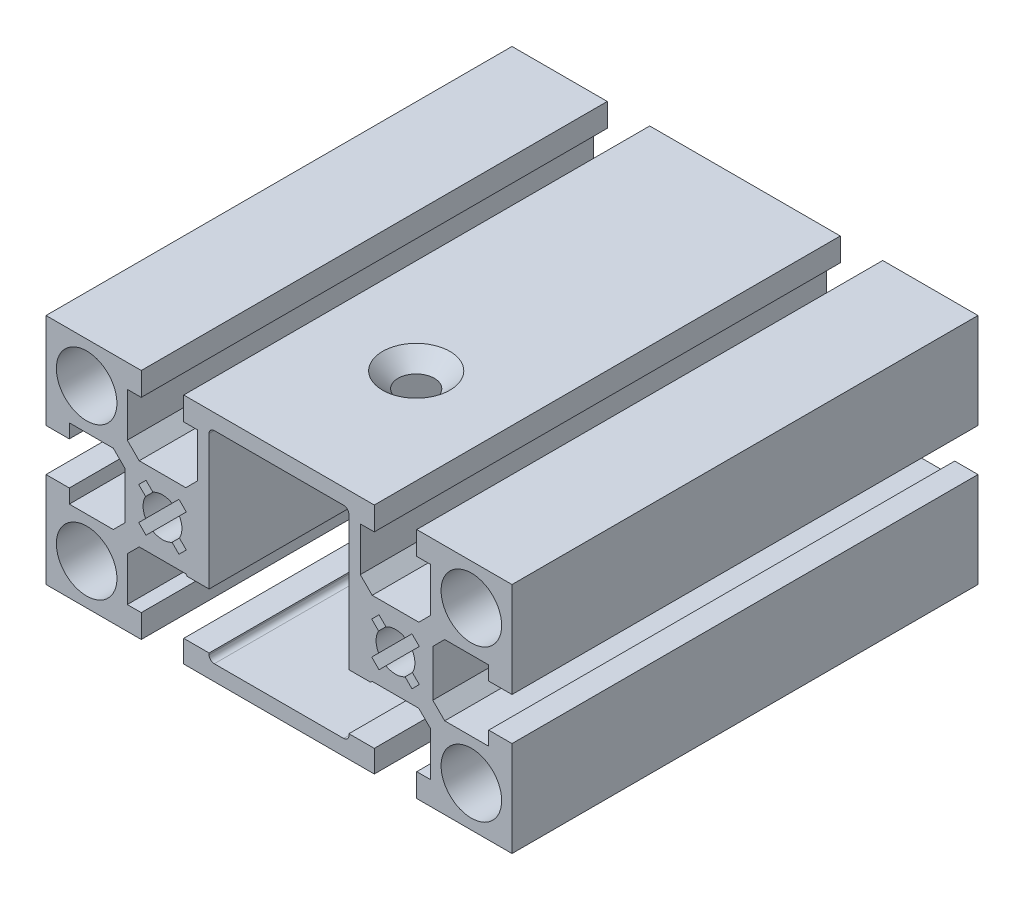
ISO-10303-21;
HEADER;
FILE_DESCRIPTION(('STEP AP214'),'2;1');
FILE_NAME('part.step','',(''),(''),'','','');
FILE_SCHEMA(('AUTOMOTIVE_DESIGN { 1 0 10303 214 1 1 1 1 }'));
ENDSEC;
DATA;
#1=APPLICATION_CONTEXT('core data for automotive mechanical design processes');
#2=APPLICATION_PROTOCOL_DEFINITION('international standard','automotive_design',2000,#1);
#3=PRODUCT_CONTEXT('',#1,'mechanical');
#4=PRODUCT('Part','Part','',(#3));
#5=PRODUCT_RELATED_PRODUCT_CATEGORY('part','',(#4));
#6=PRODUCT_DEFINITION_FORMATION('','',#4);
#7=PRODUCT_DEFINITION_CONTEXT('part definition',#1,'design');
#8=PRODUCT_DEFINITION('design','',#6,#7);
#9=PRODUCT_DEFINITION_SHAPE('','',#8);
#10=(LENGTH_UNIT() NAMED_UNIT(*) SI_UNIT(.MILLI.,.METRE.));
#11=(NAMED_UNIT(*) PLANE_ANGLE_UNIT() SI_UNIT($,.RADIAN.));
#12=(NAMED_UNIT(*) SI_UNIT($,.STERADIAN.) SOLID_ANGLE_UNIT());
#13=UNCERTAINTY_MEASURE_WITH_UNIT(LENGTH_MEASURE(1.E-05),#10,'distance_accuracy_value','');
#14=(GEOMETRIC_REPRESENTATION_CONTEXT(3) GLOBAL_UNCERTAINTY_ASSIGNED_CONTEXT((#13)) GLOBAL_UNIT_ASSIGNED_CONTEXT((#10,
#11,#12)) REPRESENTATION_CONTEXT('',''));
#15=CARTESIAN_POINT('',(0.,0.,0.));
#16=DIRECTION('',(0.,0.,1.));
#17=DIRECTION('',(1.,0.,0.));
#18=AXIS2_PLACEMENT_3D('',#15,#16,#17);
#19=CARTESIAN_POINT('',(-7.730242E-09,-12.8500000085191,37.));
#20=DIRECTION('',(0.,0.,1.));
#21=DIRECTION('',(1.,0.,0.));
#22=AXIS2_PLACEMENT_3D('',#19,#20,#21);
#23=PLANE('',#22);
#24=DIRECTION('',(1.,0.,0.));
#25=VECTOR('',#24,1.);
#26=CARTESIAN_POINT('',(15.6999999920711,-18.0000000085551,37.));
#27=LINE('',#26,#25);
#28=CARTESIAN_POINT('',(15.6999999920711,-18.0000000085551,37.));
#29=VERTEX_POINT('',#28);
#30=CARTESIAN_POINT('',(18.399999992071,-18.0000000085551,37.));
#31=VERTEX_POINT('',#30);
#32=EDGE_CURVE('E768',#29,#31,#27,.T.);
#33=ORIENTED_EDGE('',*,*,#32,.F.);
#34=DIRECTION('',(0.,1.,0.));
#35=VECTOR('',#34,1.);
#36=CARTESIAN_POINT('',(15.6999999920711,-9.50000000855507,37.));
#37=LINE('',#36,#35);
#38=CARTESIAN_POINT('',(15.6999999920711,-9.50000000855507,37.));
#39=VERTEX_POINT('',#38);
#40=EDGE_CURVE('E758',#39,#29,#37,.F.);
#41=ORIENTED_EDGE('',*,*,#40,.F.);
#42=DIRECTION('',(0.707106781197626,0.707106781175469,0.));
#43=VECTOR('',#42,1.);
#44=CARTESIAN_POINT('',(17.9999999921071,-7.20000000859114,37.));
#45=LINE('',#44,#43);
#46=CARTESIAN_POINT('',(17.6999999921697,-7.50000000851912,37.));
#47=VERTEX_POINT('',#46);
#48=EDGE_CURVE('E763',#47,#39,#45,.F.);
#49=ORIENTED_EDGE('',*,*,#48,.F.);
#50=DIRECTION('',(1.,0.,0.));
#51=VECTOR('',#50,1.);
#52=CARTESIAN_POINT('',(22.4999999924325,-7.50000000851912,37.));
#53=LINE('',#52,#51);
#54=CARTESIAN_POINT('',(13.499999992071,-7.50000000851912,37.));
#55=VERTEX_POINT('',#54);
#56=EDGE_CURVE('E726',#47,#55,#53,.F.);
#57=ORIENTED_EDGE('',*,*,#56,.T.);
#58=DIRECTION('',(0.,1.,0.));
#59=VECTOR('',#58,1.);
#60=CARTESIAN_POINT('',(13.499999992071,18.4999999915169,37.));
#61=LINE('',#60,#59);
#62=CARTESIAN_POINT('',(13.499999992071,-18.2000000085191,37.));
#63=VERTEX_POINT('',#62);
#64=EDGE_CURVE('E755',#55,#63,#61,.F.);
#65=ORIENTED_EDGE('',*,*,#64,.T.);
#66=DIRECTION('',(1.,0.,0.));
#67=VECTOR('',#66,1.);
#68=CARTESIAN_POINT('',(-22.5000000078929,-18.2000000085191,37.));
#69=LINE('',#68,#67);
#70=CARTESIAN_POINT('',(18.399999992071,-18.2000000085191,37.));
#71=VERTEX_POINT('',#70);
#72=EDGE_CURVE('E449',#63,#71,#69,.T.);
#73=ORIENTED_EDGE('',*,*,#72,.T.);
#74=DIRECTION('',(0.,1.,0.));
#75=VECTOR('',#74,1.);
#76=CARTESIAN_POINT('',(18.399999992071,-18.0000000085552,37.));
#77=LINE('',#76,#75);
#78=EDGE_CURVE('E717',#31,#71,#77,.F.);
#79=ORIENTED_EDGE('',*,*,#78,.F.);
#80=EDGE_LOOP('',(#33,#41,#49,#57,#65,#73,#79));
#81=FACE_BOUND('',#80,.T.);
#82=ADVANCED_FACE('F15',(#81),#23,.T.);
#83=CARTESIAN_POINT('',(-22.5000000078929,-18.2000000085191,90.));
#84=DIRECTION('',(0.,-1.,0.));
#85=DIRECTION('',(0.,0.,-1.));
#86=AXIS2_PLACEMENT_3D('',#83,#84,#85);
#87=PLANE('',#86);
#88=DIRECTION('',(1.,0.,0.));
#89=VECTOR('',#88,1.);
#90=CARTESIAN_POINT('',(-7.78162E-09,-18.2000000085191,90.));
#91=LINE('',#90,#89);
#92=CARTESIAN_POINT('',(18.399999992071,-18.2000000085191,90.));
#93=VERTEX_POINT('',#92);
#94=CARTESIAN_POINT('',(13.499999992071,-18.2000000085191,90.));
#95=VERTEX_POINT('',#94);
#96=EDGE_CURVE('E448',#93,#95,#91,.F.);
#97=ORIENTED_EDGE('',*,*,#96,.F.);
#98=DIRECTION('',(0.,0.,-1.));
#99=VECTOR('',#98,1.);
#100=CARTESIAN_POINT('',(18.399999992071,-18.2000000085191,0.));
#101=LINE('',#100,#99);
#102=EDGE_CURVE('E774',#71,#93,#101,.F.);
#103=ORIENTED_EDGE('',*,*,#102,.F.);
#104=ORIENTED_EDGE('',*,*,#72,.F.);
#105=DIRECTION('',(0.,0.,-1.));
#106=VECTOR('',#105,1.);
#107=CARTESIAN_POINT('',(13.499999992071,-18.2000000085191,0.));
#108=LINE('',#107,#106);
#109=EDGE_CURVE('E752',#63,#95,#108,.F.);
#110=ORIENTED_EDGE('',*,*,#109,.T.);
#111=EDGE_LOOP('',(#97,#103,#104,#110));
#112=FACE_BOUND('',#111,.T.);
#113=ADVANCED_FACE('F2346',(#112),#87,.F.);
#114=CARTESIAN_POINT('',(12.499999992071,-18.5000000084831,0.));
#115=DIRECTION('',(0.,0.,1.));
#116=DIRECTION('',(1.,0.,0.));
#117=AXIS2_PLACEMENT_3D('',#114,#115,#116);
#118=CYLINDRICAL_SURFACE('',#117,1.00000000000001);
#119=DIRECTION('',(0.,0.,-1.));
#120=VECTOR('',#119,1.);
#121=CARTESIAN_POINT('',(13.499999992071,-18.5000000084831,0.));
#122=LINE('',#121,#120);
#123=CARTESIAN_POINT('',(13.499999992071,-18.5000000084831,90.));
#124=VERTEX_POINT('',#123);
#125=CARTESIAN_POINT('',(13.499999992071,-18.5000000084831,0.));
#126=VERTEX_POINT('',#125);
#127=EDGE_CURVE('E451',#124,#126,#122,.T.);
#128=ORIENTED_EDGE('',*,*,#127,.T.);
#129=CARTESIAN_POINT('',(12.499999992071,-18.5000000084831,0.));
#130=DIRECTION('',(0.,0.,1.));
#131=DIRECTION('',(1.,0.,0.));
#132=AXIS2_PLACEMENT_3D('',#129,#130,#131);
#133=CIRCLE('',#132,1.00000000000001);
#134=CARTESIAN_POINT('',(12.499999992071,-19.5000000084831,0.));
#135=VERTEX_POINT('',#134);
#136=EDGE_CURVE('E19',#135,#126,#133,.T.);
#137=ORIENTED_EDGE('',*,*,#136,.F.);
#138=DIRECTION('',(0.,0.,-1.));
#139=VECTOR('',#138,1.);
#140=CARTESIAN_POINT('',(12.499999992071,-19.5000000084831,0.));
#141=LINE('',#140,#139);
#142=CARTESIAN_POINT('',(12.499999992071,-19.5000000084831,90.));
#143=VERTEX_POINT('',#142);
#144=EDGE_CURVE('E941',#135,#143,#141,.F.);
#145=ORIENTED_EDGE('',*,*,#144,.T.);
#146=CARTESIAN_POINT('',(12.499999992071,-18.5000000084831,90.));
#147=DIRECTION('',(0.,0.,1.));
#148=DIRECTION('',(1.,0.,0.));
#149=AXIS2_PLACEMENT_3D('',#146,#147,#148);
#150=CIRCLE('',#149,1.00000000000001);
#151=EDGE_CURVE('E453',#124,#143,#150,.F.);
#152=ORIENTED_EDGE('',*,*,#151,.F.);
#153=EDGE_LOOP('',(#128,#137,#145,#152));
#154=FACE_BOUND('',#153,.T.);
#155=ADVANCED_FACE('F452',(#154),#118,.F.);
#156=CARTESIAN_POINT('',(-7.78162E-09,-8.672969E-09,90.));
#157=DIRECTION('',(0.,0.,1.));
#158=DIRECTION('',(1.,0.,0.));
#159=AXIS2_PLACEMENT_3D('',#156,#157,#158);
#160=PLANE('',#159);
#161=DIRECTION('',(1.,0.,0.));
#162=VECTOR('',#161,1.);
#163=CARTESIAN_POINT('',(18.399999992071,-22.5000000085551,90.));
#164=LINE('',#163,#162);
#165=CARTESIAN_POINT('',(18.399999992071,-22.5000000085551,90.));
#166=VERTEX_POINT('',#165);
#167=CARTESIAN_POINT('',(-18.4000000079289,-22.5000000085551,90.));
#168=VERTEX_POINT('',#167);
#169=EDGE_CURVE('E775',#166,#168,#164,.F.);
#170=ORIENTED_EDGE('',*,*,#169,.F.);
#171=DIRECTION('',(0.,1.,0.));
#172=VECTOR('',#171,1.);
#173=CARTESIAN_POINT('',(18.399999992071,-18.0000000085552,90.));
#174=LINE('',#173,#172);
#175=EDGE_CURVE('E779',#93,#166,#174,.F.);
#176=ORIENTED_EDGE('',*,*,#175,.F.);
#177=ORIENTED_EDGE('',*,*,#96,.T.);
#178=DIRECTION('',(0.,1.,0.));
#179=VECTOR('',#178,1.);
#180=CARTESIAN_POINT('',(13.499999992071,18.4999999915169,90.));
#181=LINE('',#180,#179);
#182=EDGE_CURVE('E458',#95,#124,#181,.F.);
#183=ORIENTED_EDGE('',*,*,#182,.T.);
#184=ORIENTED_EDGE('',*,*,#151,.T.);
#185=DIRECTION('',(1.,0.,0.));
#186=VECTOR('',#185,1.);
#187=CARTESIAN_POINT('',(12.499999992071,-19.5000000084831,90.));
#188=LINE('',#187,#186);
#189=CARTESIAN_POINT('',(-12.500000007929,-19.5000000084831,90.));
#190=VERTEX_POINT('',#189);
#191=EDGE_CURVE('E713',#143,#190,#188,.F.);
#192=ORIENTED_EDGE('',*,*,#191,.T.);
#193=CARTESIAN_POINT('',(-12.500000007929,-18.5000000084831,90.));
#194=DIRECTION('',(0.,0.,1.));
#195=DIRECTION('',(1.,0.,0.));
#196=AXIS2_PLACEMENT_3D('',#193,#194,#195);
#197=CIRCLE('',#196,1.);
#198=CARTESIAN_POINT('',(-13.500000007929,-18.5000000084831,90.));
#199=VERTEX_POINT('',#198);
#200=EDGE_CURVE('E734',#190,#199,#197,.F.);
#201=ORIENTED_EDGE('',*,*,#200,.T.);
#202=DIRECTION('',(0.,1.,0.));
#203=VECTOR('',#202,1.);
#204=CARTESIAN_POINT('',(-13.500000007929,-8.672969E-09,90.));
#205=LINE('',#204,#203);
#206=CARTESIAN_POINT('',(-13.500000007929,-18.2000000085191,90.));
#207=VERTEX_POINT('',#206);
#208=EDGE_CURVE('E739',#199,#207,#205,.T.);
#209=ORIENTED_EDGE('',*,*,#208,.T.);
#210=DIRECTION('',(1.,0.,0.));
#211=VECTOR('',#210,1.);
#212=CARTESIAN_POINT('',(-22.5000000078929,-18.2000000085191,90.));
#213=LINE('',#212,#211);
#214=CARTESIAN_POINT('',(-18.4000000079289,-18.2000000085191,90.));
#215=VERTEX_POINT('',#214);
#216=EDGE_CURVE('E737',#207,#215,#213,.F.);
#217=ORIENTED_EDGE('',*,*,#216,.T.);
#218=DIRECTION('',(0.,1.,0.));
#219=VECTOR('',#218,1.);
#220=CARTESIAN_POINT('',(-18.4000000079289,-22.5000000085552,90.));
#221=LINE('',#220,#219);
#222=EDGE_CURVE('E784',#168,#215,#221,.T.);
#223=ORIENTED_EDGE('',*,*,#222,.F.);
#224=EDGE_LOOP('',(#170,#176,#177,#183,#184,#192,#201,#209,#217,#223));
#225=FACE_BOUND('',#224,.T.);
#226=ADVANCED_FACE('F1482',(#225),#160,.T.);
#227=CARTESIAN_POINT('',(-7.89322426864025E-09,-22.4999999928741,63.5));
#228=DIRECTION('',(0.,-1.,0.));
#229=DIRECTION('',(0.,0.,-1.));
#230=AXIS2_PLACEMENT_3D('',#227,#228,#229);
#231=CONICAL_SURFACE('',#230,6.49999999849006,0.785398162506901);
#232=CARTESIAN_POINT('',(-7.89322426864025E-09,-22.4999999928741,63.5));
#233=DIRECTION('',(0.,-1.,0.));
#234=DIRECTION('',(0.,0.,-1.));
#235=AXIS2_PLACEMENT_3D('',#232,#233,#234);
#236=CIRCLE('',#235,6.49999999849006);
#237=CARTESIAN_POINT('',(-7.89322426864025E-09,-22.4999999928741,57.0000000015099));
#238=VERTEX_POINT('',#237);
#239=EDGE_CURVE('E714',#238,#238,#236,.F.);
#240=ORIENTED_EDGE('',*,*,#239,.F.);
#241=EDGE_LOOP('',(#240));
#242=FACE_BOUND('',#241,.T.);
#243=CARTESIAN_POINT('',(-7.89322426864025E-09,-19.5000000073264,63.5));
#244=DIRECTION('',(0.,-1.,0.));
#245=DIRECTION('',(0.,0.,-1.));
#246=AXIS2_PLACEMENT_3D('',#243,#244,#245);
#247=CIRCLE('',#246,3.50000001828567);
#248=CARTESIAN_POINT('',(-7.89322426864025E-09,-19.5000000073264,59.9999999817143));
#249=VERTEX_POINT('',#248);
#250=EDGE_CURVE('E709',#249,#249,#247,.F.);
#251=ORIENTED_EDGE('',*,*,#250,.T.);
#252=EDGE_LOOP('',(#251));
#253=FACE_BOUND('',#252,.T.);
#254=ADVANCED_FACE('F2338',(#242,#253),#231,.F.);
#255=CARTESIAN_POINT('',(-12.500000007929,-18.5000000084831,0.));
#256=DIRECTION('',(0.,0.,1.));
#257=DIRECTION('',(1.,0.,0.));
#258=AXIS2_PLACEMENT_3D('',#255,#256,#257);
#259=CYLINDRICAL_SURFACE('',#258,1.);
#260=DIRECTION('',(0.,0.,-1.));
#261=VECTOR('',#260,1.);
#262=CARTESIAN_POINT('',(-12.500000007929,-19.5000000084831,0.));
#263=LINE('',#262,#261);
#264=CARTESIAN_POINT('',(-12.500000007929,-19.5000000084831,0.));
#265=VERTEX_POINT('',#264);
#266=EDGE_CURVE('E939',#190,#265,#263,.T.);
#267=ORIENTED_EDGE('',*,*,#266,.T.);
#268=CARTESIAN_POINT('',(-12.500000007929,-18.5000000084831,0.));
#269=DIRECTION('',(0.,0.,1.));
#270=DIRECTION('',(1.,0.,0.));
#271=AXIS2_PLACEMENT_3D('',#268,#269,#270);
#272=CIRCLE('',#271,1.);
#273=CARTESIAN_POINT('',(-13.500000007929,-18.5000000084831,0.));
#274=VERTEX_POINT('',#273);
#275=EDGE_CURVE('E738',#274,#265,#272,.T.);
#276=ORIENTED_EDGE('',*,*,#275,.F.);
#277=DIRECTION('',(0.,0.,1.));
#278=VECTOR('',#277,1.);
#279=CARTESIAN_POINT('',(-13.500000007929,-18.5000000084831,0.));
#280=LINE('',#279,#278);
#281=EDGE_CURVE('E926',#274,#199,#280,.T.);
#282=ORIENTED_EDGE('',*,*,#281,.T.);
#283=ORIENTED_EDGE('',*,*,#200,.F.);
#284=EDGE_LOOP('',(#267,#276,#282,#283));
#285=FACE_BOUND('',#284,.T.);
#286=ADVANCED_FACE('F1509',(#285),#259,.F.);
#287=CARTESIAN_POINT('',(-22.5000000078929,-18.2000000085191,90.));
#288=DIRECTION('',(0.,-1.,0.));
#289=DIRECTION('',(0.,0.,-1.));
#290=AXIS2_PLACEMENT_3D('',#287,#288,#289);
#291=PLANE('',#290);
#292=DIRECTION('',(1.,0.,0.));
#293=VECTOR('',#292,1.);
#294=CARTESIAN_POINT('',(-7.730242E-09,-18.2000000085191,37.));
#295=LINE('',#294,#293);
#296=CARTESIAN_POINT('',(-18.4000000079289,-18.2000000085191,37.));
#297=VERTEX_POINT('',#296);
#298=CARTESIAN_POINT('',(-13.500000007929,-18.2000000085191,37.));
#299=VERTEX_POINT('',#298);
#300=EDGE_CURVE('E733',#297,#299,#295,.T.);
#301=ORIENTED_EDGE('',*,*,#300,.F.);
#302=DIRECTION('',(0.,0.,1.));
#303=VECTOR('',#302,1.);
#304=CARTESIAN_POINT('',(-18.4000000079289,-18.2000000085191,0.));
#305=LINE('',#304,#303);
#306=EDGE_CURVE('E778',#215,#297,#305,.F.);
#307=ORIENTED_EDGE('',*,*,#306,.F.);
#308=ORIENTED_EDGE('',*,*,#216,.F.);
#309=DIRECTION('',(0.,0.,1.));
#310=VECTOR('',#309,1.);
#311=CARTESIAN_POINT('',(-13.500000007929,-18.2000000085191,0.));
#312=LINE('',#311,#310);
#313=EDGE_CURVE('E934',#207,#299,#312,.F.);
#314=ORIENTED_EDGE('',*,*,#313,.T.);
#315=EDGE_LOOP('',(#301,#307,#308,#314));
#316=FACE_BOUND('',#315,.T.);
#317=ADVANCED_FACE('F1506',(#316),#291,.F.);
#318=CARTESIAN_POINT('',(-7.730242E-09,-12.8500000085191,37.));
#319=DIRECTION('',(0.,0.,1.));
#320=DIRECTION('',(1.,0.,0.));
#321=AXIS2_PLACEMENT_3D('',#318,#319,#320);
#322=PLANE('',#321);
#323=DIRECTION('',(0.,1.,0.));
#324=VECTOR('',#323,1.);
#325=CARTESIAN_POINT('',(-13.500000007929,-18.5000000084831,37.));
#326=LINE('',#325,#324);
#327=CARTESIAN_POINT('',(-13.500000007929,-7.50000000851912,37.));
#328=VERTEX_POINT('',#327);
#329=EDGE_CURVE('E1096',#299,#328,#326,.T.);
#330=ORIENTED_EDGE('',*,*,#329,.T.);
#331=DIRECTION('',(1.,0.,0.));
#332=VECTOR('',#331,1.);
#333=CARTESIAN_POINT('',(22.4999999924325,-7.50000000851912,37.));
#334=LINE('',#333,#332);
#335=CARTESIAN_POINT('',(-17.7000000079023,-7.50000000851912,37.));
#336=VERTEX_POINT('',#335);
#337=EDGE_CURVE('E1062',#328,#336,#334,.F.);
#338=ORIENTED_EDGE('',*,*,#337,.T.);
#339=DIRECTION('',(0.707106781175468,-0.707106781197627,0.));
#340=VECTOR('',#339,1.);
#341=CARTESIAN_POINT('',(-15.700000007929,-9.50000000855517,37.));
#342=LINE('',#341,#340);
#343=CARTESIAN_POINT('',(-15.700000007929,-9.50000000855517,37.));
#344=VERTEX_POINT('',#343);
#345=EDGE_CURVE('E802',#344,#336,#342,.F.);
#346=ORIENTED_EDGE('',*,*,#345,.F.);
#347=DIRECTION('',(0.,1.,0.));
#348=VECTOR('',#347,1.);
#349=CARTESIAN_POINT('',(-15.700000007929,-18.0000000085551,37.));
#350=LINE('',#349,#348);
#351=CARTESIAN_POINT('',(-15.700000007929,-18.0000000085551,37.));
#352=VERTEX_POINT('',#351);
#353=EDGE_CURVE('E798',#352,#344,#350,.T.);
#354=ORIENTED_EDGE('',*,*,#353,.F.);
#355=DIRECTION('',(1.,0.,0.));
#356=VECTOR('',#355,1.);
#357=CARTESIAN_POINT('',(-18.4000000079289,-18.0000000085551,37.));
#358=LINE('',#357,#356);
#359=CARTESIAN_POINT('',(-18.4000000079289,-18.0000000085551,37.));
#360=VERTEX_POINT('',#359);
#361=EDGE_CURVE('E790',#360,#352,#358,.T.);
#362=ORIENTED_EDGE('',*,*,#361,.F.);
#363=DIRECTION('',(0.,1.,0.));
#364=VECTOR('',#363,1.);
#365=CARTESIAN_POINT('',(-18.4000000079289,-22.5000000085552,37.));
#366=LINE('',#365,#364);
#367=EDGE_CURVE('E795',#297,#360,#366,.T.);
#368=ORIENTED_EDGE('',*,*,#367,.F.);
#369=ORIENTED_EDGE('',*,*,#300,.T.);
#370=EDGE_LOOP('',(#330,#338,#346,#354,#362,#368,#369));
#371=FACE_BOUND('',#370,.T.);
#372=ADVANCED_FACE('F1424',(#371),#322,.T.);
#373=CARTESIAN_POINT('',(12.499999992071,18.4999999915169,0.));
#374=DIRECTION('',(0.,0.,1.));
#375=DIRECTION('',(1.,0.,0.));
#376=AXIS2_PLACEMENT_3D('',#373,#374,#375);
#377=CYLINDRICAL_SURFACE('',#376,1.00000000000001);
#378=DIRECTION('',(0.,0.,1.));
#379=VECTOR('',#378,1.);
#380=CARTESIAN_POINT('',(12.499999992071,19.4999999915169,0.));
#381=LINE('',#380,#379);
#382=CARTESIAN_POINT('',(12.499999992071,19.4999999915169,90.));
#383=VERTEX_POINT('',#382);
#384=CARTESIAN_POINT('',(12.499999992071,19.4999999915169,0.));
#385=VERTEX_POINT('',#384);
#386=EDGE_CURVE('E1095',#383,#385,#381,.F.);
#387=ORIENTED_EDGE('',*,*,#386,.T.);
#388=CARTESIAN_POINT('',(12.499999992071,18.4999999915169,0.));
#389=DIRECTION('',(0.,0.,1.));
#390=DIRECTION('',(1.,0.,0.));
#391=AXIS2_PLACEMENT_3D('',#388,#389,#390);
#392=CIRCLE('',#391,1.00000000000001);
#393=CARTESIAN_POINT('',(13.499999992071,18.4999999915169,0.));
#394=VERTEX_POINT('',#393);
#395=EDGE_CURVE('E731',#394,#385,#392,.T.);
#396=ORIENTED_EDGE('',*,*,#395,.F.);
#397=DIRECTION('',(0.,0.,-1.));
#398=VECTOR('',#397,1.);
#399=CARTESIAN_POINT('',(13.499999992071,18.4999999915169,0.));
#400=LINE('',#399,#398);
#401=CARTESIAN_POINT('',(13.499999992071,18.4999999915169,90.));
#402=VERTEX_POINT('',#401);
#403=EDGE_CURVE('E457',#394,#402,#400,.F.);
#404=ORIENTED_EDGE('',*,*,#403,.T.);
#405=CARTESIAN_POINT('',(12.499999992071,18.4999999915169,90.));
#406=DIRECTION('',(0.,0.,1.));
#407=DIRECTION('',(1.,0.,0.));
#408=AXIS2_PLACEMENT_3D('',#405,#406,#407);
#409=CIRCLE('',#408,1.00000000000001);
#410=EDGE_CURVE('E729',#383,#402,#409,.F.);
#411=ORIENTED_EDGE('',*,*,#410,.F.);
#412=EDGE_LOOP('',(#387,#396,#404,#411));
#413=FACE_BOUND('',#412,.T.);
#414=ADVANCED_FACE('F2329',(#413),#377,.F.);
#415=CARTESIAN_POINT('',(-12.500000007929,18.4999999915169,0.));
#416=DIRECTION('',(0.,0.,1.));
#417=DIRECTION('',(1.,0.,0.));
#418=AXIS2_PLACEMENT_3D('',#415,#416,#417);
#419=CYLINDRICAL_SURFACE('',#418,0.999999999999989);
#420=DIRECTION('',(0.,0.,1.));
#421=VECTOR('',#420,1.);
#422=CARTESIAN_POINT('',(-13.500000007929,18.4999999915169,0.));
#423=LINE('',#422,#421);
#424=CARTESIAN_POINT('',(-13.500000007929,18.4999999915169,90.));
#425=VERTEX_POINT('',#424);
#426=CARTESIAN_POINT('',(-13.500000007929,18.4999999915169,0.));
#427=VERTEX_POINT('',#426);
#428=EDGE_CURVE('E712',#425,#427,#423,.F.);
#429=ORIENTED_EDGE('',*,*,#428,.T.);
#430=CARTESIAN_POINT('',(-12.500000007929,18.4999999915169,0.));
#431=DIRECTION('',(0.,0.,1.));
#432=DIRECTION('',(1.,0.,0.));
#433=AXIS2_PLACEMENT_3D('',#430,#431,#432);
#434=CIRCLE('',#433,0.999999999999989);
#435=CARTESIAN_POINT('',(-12.500000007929,19.4999999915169,0.));
#436=VERTEX_POINT('',#435);
#437=EDGE_CURVE('E727',#436,#427,#434,.T.);
#438=ORIENTED_EDGE('',*,*,#437,.F.);
#439=DIRECTION('',(0.,0.,1.));
#440=VECTOR('',#439,1.);
#441=CARTESIAN_POINT('',(-12.500000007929,19.4999999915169,0.));
#442=LINE('',#441,#440);
#443=CARTESIAN_POINT('',(-12.500000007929,19.4999999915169,90.));
#444=VERTEX_POINT('',#443);
#445=EDGE_CURVE('E708',#436,#444,#442,.T.);
#446=ORIENTED_EDGE('',*,*,#445,.T.);
#447=CARTESIAN_POINT('',(-12.500000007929,18.4999999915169,90.));
#448=DIRECTION('',(0.,0.,1.));
#449=DIRECTION('',(1.,0.,0.));
#450=AXIS2_PLACEMENT_3D('',#447,#448,#449);
#451=CIRCLE('',#450,0.999999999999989);
#452=EDGE_CURVE('E724',#425,#444,#451,.F.);
#453=ORIENTED_EDGE('',*,*,#452,.F.);
#454=EDGE_LOOP('',(#429,#438,#446,#453));
#455=FACE_BOUND('',#454,.T.);
#456=ADVANCED_FACE('F932',(#455),#419,.F.);
#457=CARTESIAN_POINT('',(-7.89323107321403E-09,22.4999999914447,63.5));
#458=DIRECTION('',(0.,1.,0.));
#459=DIRECTION('',(0.,0.,1.));
#460=AXIS2_PLACEMENT_3D('',#457,#458,#459);
#461=CONICAL_SURFACE('',#460,6.50000000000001,0.785398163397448);
#462=CARTESIAN_POINT('',(-7.89323107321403E-09,22.4999999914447,63.5));
#463=DIRECTION('',(0.,1.,0.));
#464=DIRECTION('',(0.,0.,1.));
#465=AXIS2_PLACEMENT_3D('',#462,#463,#464);
#466=CIRCLE('',#465,6.49999999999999);
#467=CARTESIAN_POINT('',(-7.89323107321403E-09,22.4999999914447,70.));
#468=VERTEX_POINT('',#467);
#469=EDGE_CURVE('E719',#468,#468,#466,.F.);
#470=ORIENTED_EDGE('',*,*,#469,.F.);
#471=EDGE_LOOP('',(#470));
#472=FACE_BOUND('',#471,.T.);
#473=CARTESIAN_POINT('',(-7.89323267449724E-09,19.4999999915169,63.5));
#474=DIRECTION('',(0.,1.,0.));
#475=DIRECTION('',(0.,0.,1.));
#476=AXIS2_PLACEMENT_3D('',#473,#474,#475);
#477=CIRCLE('',#476,3.5000000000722);
#478=CARTESIAN_POINT('',(-7.89323267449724E-09,19.4999999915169,67.0000000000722));
#479=VERTEX_POINT('',#478);
#480=EDGE_CURVE('E704',#479,#479,#477,.F.);
#481=ORIENTED_EDGE('',*,*,#480,.T.);
#482=EDGE_LOOP('',(#481));
#483=FACE_BOUND('',#482,.T.);
#484=ADVANCED_FACE('F17',(#472,#483),#461,.F.);
#485=CARTESIAN_POINT('',(22.4999999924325,-7.50000000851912,90.));
#486=DIRECTION('',(0.,1.,0.));
#487=DIRECTION('',(0.,0.,1.));
#488=AXIS2_PLACEMENT_3D('',#485,#486,#487);
#489=PLANE('',#488);
#490=DIRECTION('',(1.,0.,0.));
#491=VECTOR('',#490,1.);
#492=CARTESIAN_POINT('',(-7.78162E-09,-7.50000000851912,90.));
#493=LINE('',#492,#491);
#494=CARTESIAN_POINT('',(13.499999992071,-7.50000000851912,90.));
#495=VERTEX_POINT('',#494);
#496=CARTESIAN_POINT('',(17.6999999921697,-7.50000000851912,90.));
#497=VERTEX_POINT('',#496);
#498=EDGE_CURVE('E1088',#495,#497,#493,.T.);
#499=ORIENTED_EDGE('',*,*,#498,.F.);
#500=DIRECTION('',(0.,0.,-1.));
#501=VECTOR('',#500,1.);
#502=CARTESIAN_POINT('',(13.499999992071,-7.50000000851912,0.));
#503=LINE('',#502,#501);
#504=EDGE_CURVE('E942',#495,#55,#503,.T.);
#505=ORIENTED_EDGE('',*,*,#504,.T.);
#506=ORIENTED_EDGE('',*,*,#56,.F.);
#507=DIRECTION('',(0.,0.,1.));
#508=VECTOR('',#507,1.);
#509=CARTESIAN_POINT('',(17.6999999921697,-7.50000000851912,0.));
#510=LINE('',#509,#508);
#511=EDGE_CURVE('E767',#497,#47,#510,.F.);
#512=ORIENTED_EDGE('',*,*,#511,.F.);
#513=EDGE_LOOP('',(#499,#505,#506,#512));
#514=FACE_BOUND('',#513,.T.);
#515=ADVANCED_FACE('F1910',(#514),#489,.F.);
#516=CARTESIAN_POINT('',(22.4999999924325,-7.50000000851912,90.));
#517=DIRECTION('',(0.,1.,0.));
#518=DIRECTION('',(0.,0.,1.));
#519=AXIS2_PLACEMENT_3D('',#516,#517,#518);
#520=PLANE('',#519);
#521=ORIENTED_EDGE('',*,*,#337,.F.);
#522=DIRECTION('',(0.,0.,1.));
#523=VECTOR('',#522,1.);
#524=CARTESIAN_POINT('',(-13.500000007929,-7.50000000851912,0.));
#525=LINE('',#524,#523);
#526=CARTESIAN_POINT('',(-13.500000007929,-7.50000000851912,90.));
#527=VERTEX_POINT('',#526);
#528=EDGE_CURVE('E1092',#328,#527,#525,.T.);
#529=ORIENTED_EDGE('',*,*,#528,.T.);
#530=DIRECTION('',(1.,0.,0.));
#531=VECTOR('',#530,1.);
#532=CARTESIAN_POINT('',(-7.78162E-09,-7.50000000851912,90.));
#533=LINE('',#532,#531);
#534=CARTESIAN_POINT('',(-17.7000000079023,-7.50000000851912,90.));
#535=VERTEX_POINT('',#534);
#536=EDGE_CURVE('E1097',#535,#527,#533,.T.);
#537=ORIENTED_EDGE('',*,*,#536,.F.);
#538=DIRECTION('',(0.,0.,1.));
#539=VECTOR('',#538,1.);
#540=CARTESIAN_POINT('',(-17.7000000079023,-7.50000000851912,0.));
#541=LINE('',#540,#539);
#542=EDGE_CURVE('E804',#336,#535,#541,.T.);
#543=ORIENTED_EDGE('',*,*,#542,.F.);
#544=EDGE_LOOP('',(#521,#529,#537,#543));
#545=FACE_BOUND('',#544,.T.);
#546=ADVANCED_FACE('F1428',(#545),#520,.F.);
#547=CARTESIAN_POINT('',(29.2999999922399,17.9999999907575,0.));
#548=DIRECTION('',(-1.566484E-11,-1.,0.));
#549=DIRECTION('',(1.,-1.566484E-11,0.));
#550=AXIS2_PLACEMENT_3D('',#547,#548,#549);
#551=PLANE('',#550);
#552=DIRECTION('',(1.,-1.566484E-11,0.));
#553=VECTOR('',#552,1.);
#554=CARTESIAN_POINT('',(29.2999999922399,17.9999999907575,0.));
#555=LINE('',#554,#553);
#556=CARTESIAN_POINT('',(26.5999999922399,17.9999999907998,0.));
#557=VERTEX_POINT('',#556);
#558=CARTESIAN_POINT('',(29.2999999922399,17.9999999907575,0.));
#559=VERTEX_POINT('',#558);
#560=EDGE_CURVE('E658',#557,#559,#555,.T.);
#561=ORIENTED_EDGE('',*,*,#560,.T.);
#562=DIRECTION('',(0.,0.,1.));
#563=VECTOR('',#562,1.);
#564=CARTESIAN_POINT('',(29.2999999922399,17.9999999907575,0.));
#565=LINE('',#564,#563);
#566=CARTESIAN_POINT('',(29.2999999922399,17.9999999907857,90.));
#567=VERTEX_POINT('',#566);
#568=EDGE_CURVE('E1060',#567,#559,#565,.F.);
#569=ORIENTED_EDGE('',*,*,#568,.F.);
#570=DIRECTION('',(1.,0.,0.));
#571=VECTOR('',#570,1.);
#572=CARTESIAN_POINT('',(-7.78162E-09,17.9999999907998,90.));
#573=LINE('',#572,#571);
#574=CARTESIAN_POINT('',(26.5999999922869,17.9999999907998,90.));
#575=VERTEX_POINT('',#574);
#576=EDGE_CURVE('E1211',#575,#567,#573,.T.);
#577=ORIENTED_EDGE('',*,*,#576,.F.);
#578=DIRECTION('',(0.,0.,1.));
#579=VECTOR('',#578,1.);
#580=CARTESIAN_POINT('',(26.5999999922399,17.9999999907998,0.));
#581=LINE('',#580,#579);
#582=EDGE_CURVE('E947',#557,#575,#581,.T.);
#583=ORIENTED_EDGE('',*,*,#582,.F.);
#584=EDGE_LOOP('',(#561,#569,#577,#583));
#585=FACE_BOUND('',#584,.T.);
#586=ADVANCED_FACE('F2010',(#585),#551,.T.);
#587=CARTESIAN_POINT('',(29.2999999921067,9.49999999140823,0.));
#588=DIRECTION('',(-1.,1.566538E-11,0.));
#589=DIRECTION('',(-1.566538E-11,-1.,0.));
#590=AXIS2_PLACEMENT_3D('',#587,#588,#589);
#591=PLANE('',#590);
#592=DIRECTION('',(-1.566538E-11,-1.,0.));
#593=VECTOR('',#592,1.);
#594=CARTESIAN_POINT('',(29.2999999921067,9.49999999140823,0.));
#595=LINE('',#594,#593);
#596=CARTESIAN_POINT('',(29.2999999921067,9.49999999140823,0.));
#597=VERTEX_POINT('',#596);
#598=EDGE_CURVE('E655',#559,#597,#595,.T.);
#599=ORIENTED_EDGE('',*,*,#598,.T.);
#600=DIRECTION('',(0.,0.,1.));
#601=VECTOR('',#600,1.);
#602=CARTESIAN_POINT('',(29.2999999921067,9.49999999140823,0.));
#603=LINE('',#602,#601);
#604=CARTESIAN_POINT('',(29.2999999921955,9.49999999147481,90.));
#605=VERTEX_POINT('',#604);
#606=EDGE_CURVE('E1058',#605,#597,#603,.F.);
#607=ORIENTED_EDGE('',*,*,#606,.F.);
#608=DIRECTION('',(0.,1.,0.));
#609=VECTOR('',#608,1.);
#610=CARTESIAN_POINT('',(29.2999999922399,-8.672969E-09,90.));
#611=LINE('',#610,#609);
#612=EDGE_CURVE('E1208',#567,#605,#611,.F.);
#613=ORIENTED_EDGE('',*,*,#612,.F.);
#614=ORIENTED_EDGE('',*,*,#568,.T.);
#615=EDGE_LOOP('',(#599,#607,#613,#614));
#616=FACE_BOUND('',#615,.T.);
#617=ADVANCED_FACE('F2015',(#616),#591,.T.);
#618=CARTESIAN_POINT('',(26.9999999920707,7.19999999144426,0.));
#619=DIRECTION('',(-0.707106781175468,0.707106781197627,0.));
#620=DIRECTION('',(-0.707106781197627,-0.707106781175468,0.));
#621=AXIS2_PLACEMENT_3D('',#618,#619,#620);
#622=PLANE('',#621);
#623=DIRECTION('',(-0.707106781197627,-0.707106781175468,0.));
#624=VECTOR('',#623,1.);
#625=CARTESIAN_POINT('',(26.9999999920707,7.19999999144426,0.));
#626=LINE('',#625,#624);
#627=CARTESIAN_POINT('',(26.9999999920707,7.19999999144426,0.));
#628=VERTEX_POINT('',#627);
#629=EDGE_CURVE('E652',#597,#628,#626,.T.);
#630=ORIENTED_EDGE('',*,*,#629,.T.);
#631=DIRECTION('',(0.,0.,1.));
#632=VECTOR('',#631,1.);
#633=CARTESIAN_POINT('',(26.9999999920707,7.19999999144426,0.));
#634=LINE('',#633,#632);
#635=CARTESIAN_POINT('',(26.9999999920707,7.19999999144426,90.));
#636=VERTEX_POINT('',#635);
#637=EDGE_CURVE('E1056',#636,#628,#634,.F.);
#638=ORIENTED_EDGE('',*,*,#637,.F.);
#639=DIRECTION('',(-0.707106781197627,-0.707106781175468,0.));
#640=VECTOR('',#639,1.);
#641=CARTESIAN_POINT('',(29.2999999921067,9.49999999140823,90.));
#642=LINE('',#641,#640);
#643=EDGE_CURVE('E1205',#605,#636,#642,.T.);
#644=ORIENTED_EDGE('',*,*,#643,.F.);
#645=ORIENTED_EDGE('',*,*,#606,.T.);
#646=EDGE_LOOP('',(#630,#638,#644,#645));
#647=FACE_BOUND('',#646,.T.);
#648=ADVANCED_FACE('F2021',(#647),#622,.T.);
#649=CARTESIAN_POINT('',(17.9999999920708,7.19999999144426,0.));
#650=DIRECTION('',(0.,1.,0.));
#651=DIRECTION('',(0.,0.,1.));
#652=AXIS2_PLACEMENT_3D('',#649,#650,#651);
#653=PLANE('',#652);
#654=DIRECTION('',(1.,0.,0.));
#655=VECTOR('',#654,1.);
#656=CARTESIAN_POINT('',(17.9999999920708,7.19999999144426,0.));
#657=LINE('',#656,#655);
#658=CARTESIAN_POINT('',(17.9999999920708,7.19999999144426,0.));
#659=VERTEX_POINT('',#658);
#660=EDGE_CURVE('E649',#628,#659,#657,.F.);
#661=ORIENTED_EDGE('',*,*,#660,.T.);
#662=DIRECTION('',(0.,0.,1.));
#663=VECTOR('',#662,1.);
#664=CARTESIAN_POINT('',(17.9999999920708,7.19999999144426,0.));
#665=LINE('',#664,#663);
#666=CARTESIAN_POINT('',(17.9999999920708,7.19999999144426,90.));
#667=VERTEX_POINT('',#666);
#668=EDGE_CURVE('E1054',#667,#659,#665,.F.);
#669=ORIENTED_EDGE('',*,*,#668,.F.);
#670=DIRECTION('',(1.,0.,0.));
#671=VECTOR('',#670,1.);
#672=CARTESIAN_POINT('',(-7.78162E-09,7.19999999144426,90.));
#673=LINE('',#672,#671);
#674=EDGE_CURVE('E1202',#636,#667,#673,.F.);
#675=ORIENTED_EDGE('',*,*,#674,.F.);
#676=ORIENTED_EDGE('',*,*,#637,.T.);
#677=EDGE_LOOP('',(#661,#669,#675,#676));
#678=FACE_BOUND('',#677,.T.);
#679=ADVANCED_FACE('F2025',(#678),#653,.T.);
#680=CARTESIAN_POINT('',(15.6999999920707,9.49999999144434,0.));
#681=DIRECTION('',(0.707106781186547,0.707106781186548,0.));
#682=DIRECTION('',(-0.707106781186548,0.707106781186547,0.));
#683=AXIS2_PLACEMENT_3D('',#680,#681,#682);
#684=PLANE('',#683);
#685=DIRECTION('',(-0.707106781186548,0.707106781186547,0.));
#686=VECTOR('',#685,1.);
#687=CARTESIAN_POINT('',(15.6999999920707,9.49999999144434,0.));
#688=LINE('',#687,#686);
#689=CARTESIAN_POINT('',(15.6999999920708,9.4999999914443,0.));
#690=VERTEX_POINT('',#689);
#691=EDGE_CURVE('E646',#659,#690,#688,.T.);
#692=ORIENTED_EDGE('',*,*,#691,.T.);
#693=DIRECTION('',(0.,0.,-1.));
#694=VECTOR('',#693,1.);
#695=CARTESIAN_POINT('',(15.6999999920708,9.49999999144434,0.));
#696=LINE('',#695,#694);
#697=CARTESIAN_POINT('',(15.6999999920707,9.49999999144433,90.));
#698=VERTEX_POINT('',#697);
#699=EDGE_CURVE('E1052',#698,#690,#696,.T.);
#700=ORIENTED_EDGE('',*,*,#699,.F.);
#701=DIRECTION('',(-0.707106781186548,0.707106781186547,0.));
#702=VECTOR('',#701,1.);
#703=CARTESIAN_POINT('',(17.9999999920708,7.19999999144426,90.));
#704=LINE('',#703,#702);
#705=EDGE_CURVE('E1199',#667,#698,#704,.T.);
#706=ORIENTED_EDGE('',*,*,#705,.F.);
#707=ORIENTED_EDGE('',*,*,#668,.T.);
#708=EDGE_LOOP('',(#692,#700,#706,#707));
#709=FACE_BOUND('',#708,.T.);
#710=ADVANCED_FACE('F2030',(#709),#684,.T.);
#711=CARTESIAN_POINT('',(15.6999999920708,17.9999999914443,0.));
#712=DIRECTION('',(1.,0.,0.));
#713=DIRECTION('',(0.,0.,-1.));
#714=AXIS2_PLACEMENT_3D('',#711,#712,#713);
#715=PLANE('',#714);
#716=DIRECTION('',(0.,1.,0.));
#717=VECTOR('',#716,1.);
#718=CARTESIAN_POINT('',(15.6999999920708,17.9999999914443,0.));
#719=LINE('',#718,#717);
#720=CARTESIAN_POINT('',(15.6999999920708,17.9999999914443,0.));
#721=VERTEX_POINT('',#720);
#722=EDGE_CURVE('E643',#690,#721,#719,.T.);
#723=ORIENTED_EDGE('',*,*,#722,.T.);
#724=DIRECTION('',(0.,0.,-1.));
#725=VECTOR('',#724,1.);
#726=CARTESIAN_POINT('',(15.6999999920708,17.9999999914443,0.));
#727=LINE('',#726,#725);
#728=CARTESIAN_POINT('',(15.6999999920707,17.9999999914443,90.));
#729=VERTEX_POINT('',#728);
#730=EDGE_CURVE('E1050',#729,#721,#727,.T.);
#731=ORIENTED_EDGE('',*,*,#730,.F.);
#732=DIRECTION('',(0.,1.,0.));
#733=VECTOR('',#732,1.);
#734=CARTESIAN_POINT('',(15.6999999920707,-8.672969E-09,90.));
#735=LINE('',#734,#733);
#736=EDGE_CURVE('E1196',#698,#729,#735,.T.);
#737=ORIENTED_EDGE('',*,*,#736,.F.);
#738=ORIENTED_EDGE('',*,*,#699,.T.);
#739=EDGE_LOOP('',(#723,#731,#737,#738));
#740=FACE_BOUND('',#739,.T.);
#741=ADVANCED_FACE('F2036',(#740),#715,.T.);
#742=CARTESIAN_POINT('',(18.3999999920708,17.9999999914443,0.));
#743=DIRECTION('',(0.,-1.,0.));
#744=DIRECTION('',(0.,0.,-1.));
#745=AXIS2_PLACEMENT_3D('',#742,#743,#744);
#746=PLANE('',#745);
#747=DIRECTION('',(1.,0.,0.));
#748=VECTOR('',#747,1.);
#749=CARTESIAN_POINT('',(18.3999999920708,17.9999999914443,0.));
#750=LINE('',#749,#748);
#751=CARTESIAN_POINT('',(18.3999999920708,17.9999999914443,0.));
#752=VERTEX_POINT('',#751);
#753=EDGE_CURVE('E640',#721,#752,#750,.T.);
#754=ORIENTED_EDGE('',*,*,#753,.T.);
#755=DIRECTION('',(0.,0.,-1.));
#756=VECTOR('',#755,1.);
#757=CARTESIAN_POINT('',(18.3999999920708,17.9999999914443,0.));
#758=LINE('',#757,#756);
#759=CARTESIAN_POINT('',(18.3999999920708,17.9999999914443,90.));
#760=VERTEX_POINT('',#759);
#761=EDGE_CURVE('E1048',#760,#752,#758,.T.);
#762=ORIENTED_EDGE('',*,*,#761,.F.);
#763=DIRECTION('',(1.,0.,0.));
#764=VECTOR('',#763,1.);
#765=CARTESIAN_POINT('',(-7.78162E-09,17.9999999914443,90.));
#766=LINE('',#765,#764);
#767=EDGE_CURVE('E1193',#729,#760,#766,.T.);
#768=ORIENTED_EDGE('',*,*,#767,.F.);
#769=ORIENTED_EDGE('',*,*,#730,.T.);
#770=EDGE_LOOP('',(#754,#762,#768,#769));
#771=FACE_BOUND('',#770,.T.);
#772=ADVANCED_FACE('F2040',(#771),#746,.T.);
#773=CARTESIAN_POINT('',(18.3999999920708,22.4999999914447,0.));
#774=DIRECTION('',(1.,0.,0.));
#775=DIRECTION('',(0.,0.,-1.));
#776=AXIS2_PLACEMENT_3D('',#773,#774,#775);
#777=PLANE('',#776);
#778=DIRECTION('',(0.,1.,0.));
#779=VECTOR('',#778,1.);
#780=CARTESIAN_POINT('',(18.3999999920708,22.4999999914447,0.));
#781=LINE('',#780,#779);
#782=CARTESIAN_POINT('',(18.3999999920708,22.4999999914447,0.));
#783=VERTEX_POINT('',#782);
#784=EDGE_CURVE('E637',#752,#783,#781,.T.);
#785=ORIENTED_EDGE('',*,*,#784,.T.);
#786=DIRECTION('',(0.,0.,1.));
#787=VECTOR('',#786,1.);
#788=CARTESIAN_POINT('',(18.3999999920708,22.4999999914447,0.));
#789=LINE('',#788,#787);
#790=CARTESIAN_POINT('',(18.3999999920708,22.4999999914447,90.));
#791=VERTEX_POINT('',#790);
#792=EDGE_CURVE('E723',#791,#783,#789,.F.);
#793=ORIENTED_EDGE('',*,*,#792,.F.);
#794=DIRECTION('',(0.,1.,0.));
#795=VECTOR('',#794,1.);
#796=CARTESIAN_POINT('',(18.3999999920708,-8.672969E-09,90.));
#797=LINE('',#796,#795);
#798=EDGE_CURVE('E1190',#760,#791,#797,.T.);
#799=ORIENTED_EDGE('',*,*,#798,.F.);
#800=ORIENTED_EDGE('',*,*,#761,.T.);
#801=EDGE_LOOP('',(#785,#793,#799,#800));
#802=FACE_BOUND('',#801,.T.);
#803=ADVANCED_FACE('F2045',(#802),#777,.T.);
#804=CARTESIAN_POINT('',(-18.4000000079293,22.4999999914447,0.));
#805=DIRECTION('',(0.,1.,0.));
#806=DIRECTION('',(0.,0.,1.));
#807=AXIS2_PLACEMENT_3D('',#804,#805,#806);
#808=PLANE('',#807);
#809=ORIENTED_EDGE('',*,*,#469,.T.);
#810=EDGE_LOOP('',(#809));
#811=FACE_BOUND('',#810,.T.);
#812=DIRECTION('',(1.,0.,0.));
#813=VECTOR('',#812,1.);
#814=CARTESIAN_POINT('',(-18.4000000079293,22.4999999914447,0.));
#815=LINE('',#814,#813);
#816=CARTESIAN_POINT('',(-18.4000000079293,22.4999999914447,0.));
#817=VERTEX_POINT('',#816);
#818=EDGE_CURVE('E634',#783,#817,#815,.F.);
#819=ORIENTED_EDGE('',*,*,#818,.T.);
#820=DIRECTION('',(0.,0.,1.));
#821=VECTOR('',#820,1.);
#822=CARTESIAN_POINT('',(-18.4000000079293,22.4999999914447,0.));
#823=LINE('',#822,#821);
#824=CARTESIAN_POINT('',(-18.4000000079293,22.4999999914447,90.));
#825=VERTEX_POINT('',#824);
#826=EDGE_CURVE('E722',#825,#817,#823,.F.);
#827=ORIENTED_EDGE('',*,*,#826,.F.);
#828=DIRECTION('',(1.,0.,0.));
#829=VECTOR('',#828,1.);
#830=CARTESIAN_POINT('',(-7.78162E-09,22.4999999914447,90.));
#831=LINE('',#830,#829);
#832=EDGE_CURVE('E1187',#791,#825,#831,.F.);
#833=ORIENTED_EDGE('',*,*,#832,.F.);
#834=ORIENTED_EDGE('',*,*,#792,.T.);
#835=EDGE_LOOP('',(#819,#827,#833,#834));
#836=FACE_BOUND('',#835,.T.);
#837=ADVANCED_FACE('F2051',(#811,#836),#808,.T.);
#838=CARTESIAN_POINT('',(-18.4000000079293,17.9999999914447,0.));
#839=DIRECTION('',(-1.,0.,0.));
#840=DIRECTION('',(0.,0.,1.));
#841=AXIS2_PLACEMENT_3D('',#838,#839,#840);
#842=PLANE('',#841);
#843=DIRECTION('',(0.,1.,0.));
#844=VECTOR('',#843,1.);
#845=CARTESIAN_POINT('',(-18.4000000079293,17.9999999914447,0.));
#846=LINE('',#845,#844);
#847=CARTESIAN_POINT('',(-18.4000000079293,17.9999999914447,0.));
#848=VERTEX_POINT('',#847);
#849=EDGE_CURVE('E631',#817,#848,#846,.F.);
#850=ORIENTED_EDGE('',*,*,#849,.T.);
#851=DIRECTION('',(0.,0.,-1.));
#852=VECTOR('',#851,1.);
#853=CARTESIAN_POINT('',(-18.4000000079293,17.9999999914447,0.));
#854=LINE('',#853,#852);
#855=CARTESIAN_POINT('',(-18.4000000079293,17.9999999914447,90.));
#856=VERTEX_POINT('',#855);
#857=EDGE_CURVE('E1044',#856,#848,#854,.T.);
#858=ORIENTED_EDGE('',*,*,#857,.F.);
#859=DIRECTION('',(0.,1.,0.));
#860=VECTOR('',#859,1.);
#861=CARTESIAN_POINT('',(-18.4000000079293,-8.672969E-09,90.));
#862=LINE('',#861,#860);
#863=EDGE_CURVE('E1184',#825,#856,#862,.F.);
#864=ORIENTED_EDGE('',*,*,#863,.F.);
#865=ORIENTED_EDGE('',*,*,#826,.T.);
#866=EDGE_LOOP('',(#850,#858,#864,#865));
#867=FACE_BOUND('',#866,.T.);
#868=ADVANCED_FACE('F2055',(#867),#842,.T.);
#869=CARTESIAN_POINT('',(-15.7000000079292,17.9999999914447,0.));
#870=DIRECTION('',(0.,-1.,0.));
#871=DIRECTION('',(0.,0.,-1.));
#872=AXIS2_PLACEMENT_3D('',#869,#870,#871);
#873=PLANE('',#872);
#874=DIRECTION('',(1.,0.,0.));
#875=VECTOR('',#874,1.);
#876=CARTESIAN_POINT('',(-15.7000000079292,17.9999999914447,0.));
#877=LINE('',#876,#875);
#878=CARTESIAN_POINT('',(-15.7000000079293,17.9999999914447,0.));
#879=VERTEX_POINT('',#878);
#880=EDGE_CURVE('E628',#848,#879,#877,.T.);
#881=ORIENTED_EDGE('',*,*,#880,.T.);
#882=DIRECTION('',(0.,0.,1.));
#883=VECTOR('',#882,1.);
#884=CARTESIAN_POINT('',(-15.7000000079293,17.9999999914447,0.));
#885=LINE('',#884,#883);
#886=CARTESIAN_POINT('',(-15.7000000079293,17.9999999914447,90.));
#887=VERTEX_POINT('',#886);
#888=EDGE_CURVE('E1042',#887,#879,#885,.F.);
#889=ORIENTED_EDGE('',*,*,#888,.F.);
#890=DIRECTION('',(1.,0.,0.));
#891=VECTOR('',#890,1.);
#892=CARTESIAN_POINT('',(-7.78162E-09,17.9999999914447,90.));
#893=LINE('',#892,#891);
#894=EDGE_CURVE('E1181',#856,#887,#893,.T.);
#895=ORIENTED_EDGE('',*,*,#894,.F.);
#896=ORIENTED_EDGE('',*,*,#857,.T.);
#897=EDGE_LOOP('',(#881,#889,#895,#896));
#898=FACE_BOUND('',#897,.T.);
#899=ADVANCED_FACE('F2060',(#898),#873,.T.);
#900=CARTESIAN_POINT('',(-15.7000000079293,9.49999999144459,0.));
#901=DIRECTION('',(-1.,0.,0.));
#902=DIRECTION('',(0.,0.,1.));
#903=AXIS2_PLACEMENT_3D('',#900,#901,#902);
#904=PLANE('',#903);
#905=DIRECTION('',(0.,1.,0.));
#906=VECTOR('',#905,1.);
#907=CARTESIAN_POINT('',(-15.7000000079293,9.49999999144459,0.));
#908=LINE('',#907,#906);
#909=CARTESIAN_POINT('',(-15.7000000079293,9.49999999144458,0.));
#910=VERTEX_POINT('',#909);
#911=EDGE_CURVE('E625',#879,#910,#908,.F.);
#912=ORIENTED_EDGE('',*,*,#911,.T.);
#913=DIRECTION('',(0.,0.,1.));
#914=VECTOR('',#913,1.);
#915=CARTESIAN_POINT('',(-15.7000000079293,9.49999999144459,0.));
#916=LINE('',#915,#914);
#917=CARTESIAN_POINT('',(-15.7000000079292,9.49999999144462,90.));
#918=VERTEX_POINT('',#917);
#919=EDGE_CURVE('E1040',#918,#910,#916,.F.);
#920=ORIENTED_EDGE('',*,*,#919,.F.);
#921=DIRECTION('',(0.,1.,0.));
#922=VECTOR('',#921,1.);
#923=CARTESIAN_POINT('',(-15.7000000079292,-8.672969E-09,90.));
#924=LINE('',#923,#922);
#925=EDGE_CURVE('E1178',#887,#918,#924,.F.);
#926=ORIENTED_EDGE('',*,*,#925,.F.);
#927=ORIENTED_EDGE('',*,*,#888,.T.);
#928=EDGE_LOOP('',(#912,#920,#926,#927));
#929=FACE_BOUND('',#928,.T.);
#930=ADVANCED_FACE('F2066',(#929),#904,.T.);
#931=CARTESIAN_POINT('',(-18.0000000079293,7.19999999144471,0.));
#932=DIRECTION('',(-0.707106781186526,0.707106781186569,0.));
#933=DIRECTION('',(-0.707106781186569,-0.707106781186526,0.));
#934=AXIS2_PLACEMENT_3D('',#931,#932,#933);
#935=PLANE('',#934);
#936=DIRECTION('',(-0.707106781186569,-0.707106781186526,0.));
#937=VECTOR('',#936,1.);
#938=CARTESIAN_POINT('',(-18.0000000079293,7.19999999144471,0.));
#939=LINE('',#938,#937);
#940=CARTESIAN_POINT('',(-18.0000000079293,7.19999999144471,0.));
#941=VERTEX_POINT('',#940);
#942=EDGE_CURVE('E622',#910,#941,#939,.T.);
#943=ORIENTED_EDGE('',*,*,#942,.T.);
#944=DIRECTION('',(0.,0.,1.));
#945=VECTOR('',#944,1.);
#946=CARTESIAN_POINT('',(-18.0000000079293,7.19999999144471,0.));
#947=LINE('',#946,#945);
#948=CARTESIAN_POINT('',(-18.0000000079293,7.19999999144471,90.));
#949=VERTEX_POINT('',#948);
#950=EDGE_CURVE('E1038',#949,#941,#947,.F.);
#951=ORIENTED_EDGE('',*,*,#950,.F.);
#952=DIRECTION('',(-0.707106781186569,-0.707106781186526,0.));
#953=VECTOR('',#952,1.);
#954=CARTESIAN_POINT('',(-15.7000000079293,9.49999999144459,90.));
#955=LINE('',#954,#953);
#956=EDGE_CURVE('E1175',#918,#949,#955,.T.);
#957=ORIENTED_EDGE('',*,*,#956,.F.);
#958=ORIENTED_EDGE('',*,*,#919,.T.);
#959=EDGE_LOOP('',(#943,#951,#957,#958));
#960=FACE_BOUND('',#959,.T.);
#961=ADVANCED_FACE('F2070',(#960),#935,.T.);
#962=CARTESIAN_POINT('',(-27.0000000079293,7.19999999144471,0.));
#963=DIRECTION('',(0.,1.,0.));
#964=DIRECTION('',(0.,0.,1.));
#965=AXIS2_PLACEMENT_3D('',#962,#963,#964);
#966=PLANE('',#965);
#967=DIRECTION('',(1.,0.,0.));
#968=VECTOR('',#967,1.);
#969=CARTESIAN_POINT('',(-27.0000000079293,7.19999999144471,0.));
#970=LINE('',#969,#968);
#971=CARTESIAN_POINT('',(-27.0000000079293,7.19999999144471,0.));
#972=VERTEX_POINT('',#971);
#973=EDGE_CURVE('E619',#941,#972,#970,.F.);
#974=ORIENTED_EDGE('',*,*,#973,.T.);
#975=DIRECTION('',(0.,0.,1.));
#976=VECTOR('',#975,1.);
#977=CARTESIAN_POINT('',(-27.0000000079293,7.1999999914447,0.));
#978=LINE('',#977,#976);
#979=CARTESIAN_POINT('',(-27.0000000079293,7.19999999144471,90.));
#980=VERTEX_POINT('',#979);
#981=EDGE_CURVE('E1036',#980,#972,#978,.F.);
#982=ORIENTED_EDGE('',*,*,#981,.F.);
#983=DIRECTION('',(1.,0.,0.));
#984=VECTOR('',#983,1.);
#985=CARTESIAN_POINT('',(-7.78162E-09,7.19999999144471,90.));
#986=LINE('',#985,#984);
#987=EDGE_CURVE('E1172',#949,#980,#986,.F.);
#988=ORIENTED_EDGE('',*,*,#987,.F.);
#989=ORIENTED_EDGE('',*,*,#950,.T.);
#990=EDGE_LOOP('',(#974,#982,#988,#989));
#991=FACE_BOUND('',#990,.T.);
#992=ADVANCED_FACE('F2075',(#991),#966,.T.);
#993=CARTESIAN_POINT('',(-29.3000000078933,9.49999999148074,0.));
#994=DIRECTION('',(0.707106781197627,0.707106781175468,0.));
#995=DIRECTION('',(-0.707106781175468,0.707106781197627,0.));
#996=AXIS2_PLACEMENT_3D('',#993,#994,#995);
#997=PLANE('',#996);
#998=DIRECTION('',(-0.707106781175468,0.707106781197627,0.));
#999=VECTOR('',#998,1.);
#1000=CARTESIAN_POINT('',(-29.3000000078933,9.49999999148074,0.));
#1001=LINE('',#1000,#999);
#1002=CARTESIAN_POINT('',(-29.3000000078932,9.49999999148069,0.));
#1003=VERTEX_POINT('',#1002);
#1004=EDGE_CURVE('E616',#972,#1003,#1001,.T.);
#1005=ORIENTED_EDGE('',*,*,#1004,.T.);
#1006=DIRECTION('',(0.,0.,-1.));
#1007=VECTOR('',#1006,1.);
#1008=CARTESIAN_POINT('',(-29.3000000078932,9.49999999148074,0.));
#1009=LINE('',#1008,#1007);
#1010=CARTESIAN_POINT('',(-29.3000000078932,9.49999999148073,90.));
#1011=VERTEX_POINT('',#1010);
#1012=EDGE_CURVE('E1034',#1011,#1003,#1009,.T.);
#1013=ORIENTED_EDGE('',*,*,#1012,.F.);
#1014=DIRECTION('',(-0.707106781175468,0.707106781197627,0.));
#1015=VECTOR('',#1014,1.);
#1016=CARTESIAN_POINT('',(-27.0000000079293,7.19999999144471,90.));
#1017=LINE('',#1016,#1015);
#1018=EDGE_CURVE('E1169',#980,#1011,#1017,.T.);
#1019=ORIENTED_EDGE('',*,*,#1018,.F.);
#1020=ORIENTED_EDGE('',*,*,#981,.T.);
#1021=EDGE_LOOP('',(#1005,#1013,#1019,#1020));
#1022=FACE_BOUND('',#1021,.T.);
#1023=ADVANCED_FACE('F2081',(#1022),#997,.T.);
#1024=CARTESIAN_POINT('',(-29.3000000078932,17.9999999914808,0.));
#1025=DIRECTION('',(1.,0.,0.));
#1026=DIRECTION('',(0.,0.,-1.));
#1027=AXIS2_PLACEMENT_3D('',#1024,#1025,#1026);
#1028=PLANE('',#1027);
#1029=DIRECTION('',(0.,1.,0.));
#1030=VECTOR('',#1029,1.);
#1031=CARTESIAN_POINT('',(-29.3000000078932,17.9999999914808,0.));
#1032=LINE('',#1031,#1030);
#1033=CARTESIAN_POINT('',(-29.3000000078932,17.9999999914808,0.));
#1034=VERTEX_POINT('',#1033);
#1035=EDGE_CURVE('E613',#1003,#1034,#1032,.T.);
#1036=ORIENTED_EDGE('',*,*,#1035,.T.);
#1037=DIRECTION('',(0.,0.,-1.));
#1038=VECTOR('',#1037,1.);
#1039=CARTESIAN_POINT('',(-29.3000000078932,17.9999999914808,0.));
#1040=LINE('',#1039,#1038);
#1041=CARTESIAN_POINT('',(-29.3000000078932,17.9999999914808,90.));
#1042=VERTEX_POINT('',#1041);
#1043=EDGE_CURVE('E1032',#1042,#1034,#1040,.T.);
#1044=ORIENTED_EDGE('',*,*,#1043,.F.);
#1045=DIRECTION('',(0.,1.,0.));
#1046=VECTOR('',#1045,1.);
#1047=CARTESIAN_POINT('',(-29.3000000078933,-8.672969E-09,90.));
#1048=LINE('',#1047,#1046);
#1049=EDGE_CURVE('E1166',#1011,#1042,#1048,.T.);
#1050=ORIENTED_EDGE('',*,*,#1049,.F.);
#1051=ORIENTED_EDGE('',*,*,#1012,.T.);
#1052=EDGE_LOOP('',(#1036,#1044,#1050,#1051));
#1053=FACE_BOUND('',#1052,.T.);
#1054=ADVANCED_FACE('F2085',(#1053),#1028,.T.);
#1055=CARTESIAN_POINT('',(-26.6000000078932,17.9999999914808,0.));
#1056=DIRECTION('',(0.,-1.,0.));
#1057=DIRECTION('',(0.,0.,-1.));
#1058=AXIS2_PLACEMENT_3D('',#1055,#1056,#1057);
#1059=PLANE('',#1058);
#1060=DIRECTION('',(1.,0.,0.));
#1061=VECTOR('',#1060,1.);
#1062=CARTESIAN_POINT('',(-26.6000000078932,17.9999999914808,0.));
#1063=LINE('',#1062,#1061);
#1064=CARTESIAN_POINT('',(-26.6000000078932,17.9999999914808,0.));
#1065=VERTEX_POINT('',#1064);
#1066=EDGE_CURVE('E610',#1034,#1065,#1063,.T.);
#1067=ORIENTED_EDGE('',*,*,#1066,.T.);
#1068=DIRECTION('',(0.,0.,-1.));
#1069=VECTOR('',#1068,1.);
#1070=CARTESIAN_POINT('',(-26.6000000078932,17.9999999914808,0.));
#1071=LINE('',#1070,#1069);
#1072=CARTESIAN_POINT('',(-26.6000000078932,17.9999999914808,90.));
#1073=VERTEX_POINT('',#1072);
#1074=EDGE_CURVE('E1030',#1073,#1065,#1071,.T.);
#1075=ORIENTED_EDGE('',*,*,#1074,.F.);
#1076=DIRECTION('',(1.,0.,0.));
#1077=VECTOR('',#1076,1.);
#1078=CARTESIAN_POINT('',(-7.78162E-09,17.9999999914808,90.));
#1079=LINE('',#1078,#1077);
#1080=EDGE_CURVE('E1163',#1042,#1073,#1079,.T.);
#1081=ORIENTED_EDGE('',*,*,#1080,.F.);
#1082=ORIENTED_EDGE('',*,*,#1043,.T.);
#1083=EDGE_LOOP('',(#1067,#1075,#1081,#1082));
#1084=FACE_BOUND('',#1083,.T.);
#1085=ADVANCED_FACE('F2090',(#1084),#1059,.T.);
#1086=CARTESIAN_POINT('',(-26.6000000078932,22.4999999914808,0.));
#1087=DIRECTION('',(1.,0.,0.));
#1088=DIRECTION('',(0.,0.,-1.));
#1089=AXIS2_PLACEMENT_3D('',#1086,#1087,#1088);
#1090=PLANE('',#1089);
#1091=DIRECTION('',(0.,1.,0.));
#1092=VECTOR('',#1091,1.);
#1093=CARTESIAN_POINT('',(-26.6000000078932,22.4999999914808,0.));
#1094=LINE('',#1093,#1092);
#1095=CARTESIAN_POINT('',(-26.6000000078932,22.4999999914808,0.));
#1096=VERTEX_POINT('',#1095);
#1097=EDGE_CURVE('E607',#1065,#1096,#1094,.T.);
#1098=ORIENTED_EDGE('',*,*,#1097,.T.);
#1099=DIRECTION('',(0.,0.,1.));
#1100=VECTOR('',#1099,1.);
#1101=CARTESIAN_POINT('',(-26.6000000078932,22.4999999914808,0.));
#1102=LINE('',#1101,#1100);
#1103=CARTESIAN_POINT('',(-26.6000000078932,22.4999999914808,90.));
#1104=VERTEX_POINT('',#1103);
#1105=EDGE_CURVE('E1028',#1104,#1096,#1102,.F.);
#1106=ORIENTED_EDGE('',*,*,#1105,.F.);
#1107=DIRECTION('',(0.,1.,0.));
#1108=VECTOR('',#1107,1.);
#1109=CARTESIAN_POINT('',(-26.6000000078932,-8.672969E-09,90.));
#1110=LINE('',#1109,#1108);
#1111=EDGE_CURVE('E1160',#1073,#1104,#1110,.T.);
#1112=ORIENTED_EDGE('',*,*,#1111,.F.);
#1113=ORIENTED_EDGE('',*,*,#1074,.T.);
#1114=EDGE_LOOP('',(#1098,#1106,#1112,#1113));
#1115=FACE_BOUND('',#1114,.T.);
#1116=ADVANCED_FACE('F2096',(#1115),#1090,.T.);
#1117=CARTESIAN_POINT('',(-45.0000000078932,22.4999999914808,0.));
#1118=DIRECTION('',(0.,1.,0.));
#1119=DIRECTION('',(0.,0.,1.));
#1120=AXIS2_PLACEMENT_3D('',#1117,#1118,#1119);
#1121=PLANE('',#1120);
#1122=DIRECTION('',(1.,0.,0.));
#1123=VECTOR('',#1122,1.);
#1124=CARTESIAN_POINT('',(-45.0000000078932,22.4999999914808,0.));
#1125=LINE('',#1124,#1123);
#1126=CARTESIAN_POINT('',(-45.0000000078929,22.4999999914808,0.));
#1127=VERTEX_POINT('',#1126);
#1128=EDGE_CURVE('E604',#1096,#1127,#1125,.F.);
#1129=ORIENTED_EDGE('',*,*,#1128,.T.);
#1130=DIRECTION('',(0.,0.,1.));
#1131=VECTOR('',#1130,1.);
#1132=CARTESIAN_POINT('',(-45.0000000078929,22.4999999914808,0.));
#1133=LINE('',#1132,#1131);
#1134=CARTESIAN_POINT('',(-45.000000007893,22.4999999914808,90.));
#1135=VERTEX_POINT('',#1134);
#1136=EDGE_CURVE('E1026',#1135,#1127,#1133,.F.);
#1137=ORIENTED_EDGE('',*,*,#1136,.F.);
#1138=DIRECTION('',(1.,0.,0.));
#1139=VECTOR('',#1138,1.);
#1140=CARTESIAN_POINT('',(-7.78162E-09,22.4999999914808,90.));
#1141=LINE('',#1140,#1139);
#1142=EDGE_CURVE('E1157',#1104,#1135,#1141,.F.);
#1143=ORIENTED_EDGE('',*,*,#1142,.F.);
#1144=ORIENTED_EDGE('',*,*,#1105,.T.);
#1145=EDGE_LOOP('',(#1129,#1137,#1143,#1144));
#1146=FACE_BOUND('',#1145,.T.);
#1147=ADVANCED_FACE('F2100',(#1146),#1121,.T.);
#1148=CARTESIAN_POINT('',(-45.0000000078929,4.09999999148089,0.));
#1149=DIRECTION('',(-1.,0.,0.));
#1150=DIRECTION('',(0.,0.,1.));
#1151=AXIS2_PLACEMENT_3D('',#1148,#1149,#1150);
#1152=PLANE('',#1151);
#1153=DIRECTION('',(0.,1.,0.));
#1154=VECTOR('',#1153,1.);
#1155=CARTESIAN_POINT('',(-45.0000000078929,4.09999999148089,0.));
#1156=LINE('',#1155,#1154);
#1157=CARTESIAN_POINT('',(-45.0000000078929,4.09999999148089,0.));
#1158=VERTEX_POINT('',#1157);
#1159=EDGE_CURVE('E601',#1127,#1158,#1156,.F.);
#1160=ORIENTED_EDGE('',*,*,#1159,.T.);
#1161=DIRECTION('',(0.,0.,-1.));
#1162=VECTOR('',#1161,1.);
#1163=CARTESIAN_POINT('',(-45.0000000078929,4.09999999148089,0.));
#1164=LINE('',#1163,#1162);
#1165=CARTESIAN_POINT('',(-45.0000000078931,4.09999999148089,90.));
#1166=VERTEX_POINT('',#1165);
#1167=EDGE_CURVE('E1024',#1166,#1158,#1164,.T.);
#1168=ORIENTED_EDGE('',*,*,#1167,.F.);
#1169=DIRECTION('',(0.,1.,0.));
#1170=VECTOR('',#1169,1.);
#1171=CARTESIAN_POINT('',(-45.0000000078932,-8.672969E-09,90.));
#1172=LINE('',#1171,#1170);
#1173=EDGE_CURVE('E1154',#1135,#1166,#1172,.F.);
#1174=ORIENTED_EDGE('',*,*,#1173,.F.);
#1175=ORIENTED_EDGE('',*,*,#1136,.T.);
#1176=EDGE_LOOP('',(#1160,#1168,#1174,#1175));
#1177=FACE_BOUND('',#1176,.T.);
#1178=ADVANCED_FACE('F2105',(#1177),#1152,.T.);
#1179=CARTESIAN_POINT('',(-40.500000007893,4.09999999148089,0.));
#1180=DIRECTION('',(0.,-1.,0.));
#1181=DIRECTION('',(0.,0.,-1.));
#1182=AXIS2_PLACEMENT_3D('',#1179,#1180,#1181);
#1183=PLANE('',#1182);
#1184=DIRECTION('',(1.,0.,0.));
#1185=VECTOR('',#1184,1.);
#1186=CARTESIAN_POINT('',(-40.500000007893,4.09999999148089,0.));
#1187=LINE('',#1186,#1185);
#1188=CARTESIAN_POINT('',(-40.500000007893,4.09999999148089,0.));
#1189=VERTEX_POINT('',#1188);
#1190=EDGE_CURVE('E598',#1158,#1189,#1187,.T.);
#1191=ORIENTED_EDGE('',*,*,#1190,.T.);
#1192=DIRECTION('',(0.,0.,-1.));
#1193=VECTOR('',#1192,1.);
#1194=CARTESIAN_POINT('',(-40.500000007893,4.09999999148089,0.));
#1195=LINE('',#1194,#1193);
#1196=CARTESIAN_POINT('',(-40.500000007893,4.09999999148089,90.));
#1197=VERTEX_POINT('',#1196);
#1198=EDGE_CURVE('E1022',#1197,#1189,#1195,.T.);
#1199=ORIENTED_EDGE('',*,*,#1198,.F.);
#1200=DIRECTION('',(1.,0.,0.));
#1201=VECTOR('',#1200,1.);
#1202=CARTESIAN_POINT('',(-7.78162E-09,4.09999999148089,90.));
#1203=LINE('',#1202,#1201);
#1204=EDGE_CURVE('E1151',#1166,#1197,#1203,.T.);
#1205=ORIENTED_EDGE('',*,*,#1204,.F.);
#1206=ORIENTED_EDGE('',*,*,#1167,.T.);
#1207=EDGE_LOOP('',(#1191,#1199,#1205,#1206));
#1208=FACE_BOUND('',#1207,.T.);
#1209=ADVANCED_FACE('F2111',(#1208),#1183,.T.);
#1210=CARTESIAN_POINT('',(-40.500000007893,6.79999999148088,0.));
#1211=DIRECTION('',(1.,0.,0.));
#1212=DIRECTION('',(0.,0.,-1.));
#1213=AXIS2_PLACEMENT_3D('',#1210,#1211,#1212);
#1214=PLANE('',#1213);
#1215=DIRECTION('',(0.,1.,0.));
#1216=VECTOR('',#1215,1.);
#1217=CARTESIAN_POINT('',(-40.500000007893,6.79999999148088,0.));
#1218=LINE('',#1217,#1216);
#1219=CARTESIAN_POINT('',(-40.500000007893,6.79999999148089,0.));
#1220=VERTEX_POINT('',#1219);
#1221=EDGE_CURVE('E595',#1189,#1220,#1218,.T.);
#1222=ORIENTED_EDGE('',*,*,#1221,.T.);
#1223=DIRECTION('',(0.,0.,-1.));
#1224=VECTOR('',#1223,1.);
#1225=CARTESIAN_POINT('',(-40.500000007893,6.79999999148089,0.));
#1226=LINE('',#1225,#1224);
#1227=CARTESIAN_POINT('',(-40.500000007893,6.79999999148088,90.));
#1228=VERTEX_POINT('',#1227);
#1229=EDGE_CURVE('E1020',#1228,#1220,#1226,.T.);
#1230=ORIENTED_EDGE('',*,*,#1229,.F.);
#1231=DIRECTION('',(0.,1.,0.));
#1232=VECTOR('',#1231,1.);
#1233=CARTESIAN_POINT('',(-40.500000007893,-8.672969E-09,90.));
#1234=LINE('',#1233,#1232);
#1235=EDGE_CURVE('E1148',#1197,#1228,#1234,.T.);
#1236=ORIENTED_EDGE('',*,*,#1235,.F.);
#1237=ORIENTED_EDGE('',*,*,#1198,.T.);
#1238=EDGE_LOOP('',(#1222,#1230,#1236,#1237));
#1239=FACE_BOUND('',#1238,.T.);
#1240=ADVANCED_FACE('F2115',(#1239),#1214,.T.);
#1241=CARTESIAN_POINT('',(-32.0000000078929,6.79999999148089,0.));
#1242=DIRECTION('',(0.,-1.,0.));
#1243=DIRECTION('',(0.,0.,-1.));
#1244=AXIS2_PLACEMENT_3D('',#1241,#1242,#1243);
#1245=PLANE('',#1244);
#1246=DIRECTION('',(1.,0.,0.));
#1247=VECTOR('',#1246,1.);
#1248=CARTESIAN_POINT('',(-32.0000000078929,6.79999999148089,0.));
#1249=LINE('',#1248,#1247);
#1250=CARTESIAN_POINT('',(-32.0000000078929,6.79999999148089,0.));
#1251=VERTEX_POINT('',#1250);
#1252=EDGE_CURVE('E592',#1220,#1251,#1249,.T.);
#1253=ORIENTED_EDGE('',*,*,#1252,.T.);
#1254=DIRECTION('',(0.,0.,1.));
#1255=VECTOR('',#1254,1.);
#1256=CARTESIAN_POINT('',(-32.0000000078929,6.79999999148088,0.));
#1257=LINE('',#1256,#1255);
#1258=CARTESIAN_POINT('',(-32.0000000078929,6.79999999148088,90.));
#1259=VERTEX_POINT('',#1258);
#1260=EDGE_CURVE('E1018',#1259,#1251,#1257,.F.);
#1261=ORIENTED_EDGE('',*,*,#1260,.F.);
#1262=DIRECTION('',(1.,0.,0.));
#1263=VECTOR('',#1262,1.);
#1264=CARTESIAN_POINT('',(-7.78162E-09,6.79999999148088,90.));
#1265=LINE('',#1264,#1263);
#1266=EDGE_CURVE('E1145',#1228,#1259,#1265,.T.);
#1267=ORIENTED_EDGE('',*,*,#1266,.F.);
#1268=ORIENTED_EDGE('',*,*,#1229,.T.);
#1269=EDGE_LOOP('',(#1253,#1261,#1267,#1268));
#1270=FACE_BOUND('',#1269,.T.);
#1271=ADVANCED_FACE('F2120',(#1270),#1245,.T.);
#1272=CARTESIAN_POINT('',(-29.7000000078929,4.49999999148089,0.));
#1273=DIRECTION('',(-0.707106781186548,-0.707106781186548,0.));
#1274=DIRECTION('',(0.707106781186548,-0.707106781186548,0.));
#1275=AXIS2_PLACEMENT_3D('',#1272,#1273,#1274);
#1276=PLANE('',#1275);
#1277=DIRECTION('',(0.707106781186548,-0.707106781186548,0.));
#1278=VECTOR('',#1277,1.);
#1279=CARTESIAN_POINT('',(-29.7000000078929,4.49999999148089,0.));
#1280=LINE('',#1279,#1278);
#1281=CARTESIAN_POINT('',(-29.7000000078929,4.49999999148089,0.));
#1282=VERTEX_POINT('',#1281);
#1283=EDGE_CURVE('E589',#1251,#1282,#1280,.T.);
#1284=ORIENTED_EDGE('',*,*,#1283,.T.);
#1285=DIRECTION('',(0.,0.,1.));
#1286=VECTOR('',#1285,1.);
#1287=CARTESIAN_POINT('',(-29.7000000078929,4.49999999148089,0.));
#1288=LINE('',#1287,#1286);
#1289=CARTESIAN_POINT('',(-29.7000000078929,4.49999999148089,90.));
#1290=VERTEX_POINT('',#1289);
#1291=EDGE_CURVE('E1016',#1290,#1282,#1288,.F.);
#1292=ORIENTED_EDGE('',*,*,#1291,.F.);
#1293=DIRECTION('',(0.707106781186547,-0.707106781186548,0.));
#1294=VECTOR('',#1293,1.);
#1295=CARTESIAN_POINT('',(-32.0000000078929,6.79999999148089,90.));
#1296=LINE('',#1295,#1294);
#1297=EDGE_CURVE('E1142',#1259,#1290,#1296,.T.);
#1298=ORIENTED_EDGE('',*,*,#1297,.F.);
#1299=ORIENTED_EDGE('',*,*,#1260,.T.);
#1300=EDGE_LOOP('',(#1284,#1292,#1298,#1299));
#1301=FACE_BOUND('',#1300,.T.);
#1302=ADVANCED_FACE('F2126',(#1301),#1276,.T.);
#1303=CARTESIAN_POINT('',(-29.7000000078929,-4.50000000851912,0.));
#1304=DIRECTION('',(-1.,0.,0.));
#1305=DIRECTION('',(0.,0.,1.));
#1306=AXIS2_PLACEMENT_3D('',#1303,#1304,#1305);
#1307=PLANE('',#1306);
#1308=DIRECTION('',(0.,1.,0.));
#1309=VECTOR('',#1308,1.);
#1310=CARTESIAN_POINT('',(-29.7000000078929,-4.50000000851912,0.));
#1311=LINE('',#1310,#1309);
#1312=CARTESIAN_POINT('',(-29.7000000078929,-4.50000000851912,0.));
#1313=VERTEX_POINT('',#1312);
#1314=EDGE_CURVE('E586',#1282,#1313,#1311,.F.);
#1315=ORIENTED_EDGE('',*,*,#1314,.T.);
#1316=DIRECTION('',(0.,0.,1.));
#1317=VECTOR('',#1316,1.);
#1318=CARTESIAN_POINT('',(-29.7000000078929,-4.50000000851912,0.));
#1319=LINE('',#1318,#1317);
#1320=CARTESIAN_POINT('',(-29.7000000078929,-4.50000000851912,90.));
#1321=VERTEX_POINT('',#1320);
#1322=EDGE_CURVE('E1014',#1321,#1313,#1319,.F.);
#1323=ORIENTED_EDGE('',*,*,#1322,.F.);
#1324=DIRECTION('',(0.,1.,0.));
#1325=VECTOR('',#1324,1.);
#1326=CARTESIAN_POINT('',(-29.7000000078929,-8.672969E-09,90.));
#1327=LINE('',#1326,#1325);
#1328=EDGE_CURVE('E1139',#1290,#1321,#1327,.F.);
#1329=ORIENTED_EDGE('',*,*,#1328,.F.);
#1330=ORIENTED_EDGE('',*,*,#1291,.T.);
#1331=EDGE_LOOP('',(#1315,#1323,#1329,#1330));
#1332=FACE_BOUND('',#1331,.T.);
#1333=ADVANCED_FACE('F2130',(#1332),#1307,.T.);
#1334=CARTESIAN_POINT('',(-32.000000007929,-6.80000000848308,0.));
#1335=DIRECTION('',(-0.707106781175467,0.707106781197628,0.));
#1336=DIRECTION('',(-0.707106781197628,-0.707106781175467,0.));
#1337=AXIS2_PLACEMENT_3D('',#1334,#1335,#1336);
#1338=PLANE('',#1337);
#1339=DIRECTION('',(-0.707106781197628,-0.707106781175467,0.));
#1340=VECTOR('',#1339,1.);
#1341=CARTESIAN_POINT('',(-32.000000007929,-6.80000000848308,0.));
#1342=LINE('',#1341,#1340);
#1343=CARTESIAN_POINT('',(-32.000000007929,-6.80000000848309,0.));
#1344=VERTEX_POINT('',#1343);
#1345=EDGE_CURVE('E583',#1313,#1344,#1342,.T.);
#1346=ORIENTED_EDGE('',*,*,#1345,.T.);
#1347=DIRECTION('',(0.,0.,1.));
#1348=VECTOR('',#1347,1.);
#1349=CARTESIAN_POINT('',(-32.000000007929,-6.80000000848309,0.));
#1350=LINE('',#1349,#1348);
#1351=CARTESIAN_POINT('',(-32.000000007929,-6.80000000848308,90.));
#1352=VERTEX_POINT('',#1351);
#1353=EDGE_CURVE('E1012',#1352,#1344,#1350,.F.);
#1354=ORIENTED_EDGE('',*,*,#1353,.F.);
#1355=DIRECTION('',(-0.707106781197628,-0.707106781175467,0.));
#1356=VECTOR('',#1355,1.);
#1357=CARTESIAN_POINT('',(-29.7000000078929,-4.50000000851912,90.));
#1358=LINE('',#1357,#1356);
#1359=EDGE_CURVE('E1136',#1321,#1352,#1358,.T.);
#1360=ORIENTED_EDGE('',*,*,#1359,.F.);
#1361=ORIENTED_EDGE('',*,*,#1322,.T.);
#1362=EDGE_LOOP('',(#1346,#1354,#1360,#1361));
#1363=FACE_BOUND('',#1362,.T.);
#1364=ADVANCED_FACE('F2135',(#1363),#1338,.T.);
#1365=CARTESIAN_POINT('',(-40.500000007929,-6.80000000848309,0.));
#1366=DIRECTION('',(0.,1.,0.));
#1367=DIRECTION('',(0.,0.,1.));
#1368=AXIS2_PLACEMENT_3D('',#1365,#1366,#1367);
#1369=PLANE('',#1368);
#1370=DIRECTION('',(1.,0.,0.));
#1371=VECTOR('',#1370,1.);
#1372=CARTESIAN_POINT('',(-40.500000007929,-6.80000000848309,0.));
#1373=LINE('',#1372,#1371);
#1374=CARTESIAN_POINT('',(-40.500000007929,-6.80000000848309,0.));
#1375=VERTEX_POINT('',#1374);
#1376=EDGE_CURVE('E580',#1344,#1375,#1373,.F.);
#1377=ORIENTED_EDGE('',*,*,#1376,.T.);
#1378=DIRECTION('',(0.,0.,-1.));
#1379=VECTOR('',#1378,1.);
#1380=CARTESIAN_POINT('',(-40.500000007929,-6.80000000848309,0.));
#1381=LINE('',#1380,#1379);
#1382=CARTESIAN_POINT('',(-40.500000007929,-6.80000000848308,90.));
#1383=VERTEX_POINT('',#1382);
#1384=EDGE_CURVE('E1010',#1383,#1375,#1381,.T.);
#1385=ORIENTED_EDGE('',*,*,#1384,.F.);
#1386=DIRECTION('',(1.,0.,0.));
#1387=VECTOR('',#1386,1.);
#1388=CARTESIAN_POINT('',(-7.78162E-09,-6.80000000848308,90.));
#1389=LINE('',#1388,#1387);
#1390=EDGE_CURVE('E1133',#1352,#1383,#1389,.F.);
#1391=ORIENTED_EDGE('',*,*,#1390,.F.);
#1392=ORIENTED_EDGE('',*,*,#1353,.T.);
#1393=EDGE_LOOP('',(#1377,#1385,#1391,#1392));
#1394=FACE_BOUND('',#1393,.T.);
#1395=ADVANCED_FACE('F2141',(#1394),#1369,.T.);
#1396=CARTESIAN_POINT('',(-40.500000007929,-4.10000000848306,0.));
#1397=DIRECTION('',(1.,0.,0.));
#1398=DIRECTION('',(0.,0.,-1.));
#1399=AXIS2_PLACEMENT_3D('',#1396,#1397,#1398);
#1400=PLANE('',#1399);
#1401=DIRECTION('',(0.,1.,0.));
#1402=VECTOR('',#1401,1.);
#1403=CARTESIAN_POINT('',(-40.500000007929,-4.10000000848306,0.));
#1404=LINE('',#1403,#1402);
#1405=CARTESIAN_POINT('',(-40.500000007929,-4.10000000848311,0.));
#1406=VERTEX_POINT('',#1405);
#1407=EDGE_CURVE('E577',#1375,#1406,#1404,.T.);
#1408=ORIENTED_EDGE('',*,*,#1407,.T.);
#1409=DIRECTION('',(0.,0.,1.));
#1410=VECTOR('',#1409,1.);
#1411=CARTESIAN_POINT('',(-40.500000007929,-4.10000000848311,0.));
#1412=LINE('',#1411,#1410);
#1413=CARTESIAN_POINT('',(-40.500000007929,-4.10000000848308,90.));
#1414=VERTEX_POINT('',#1413);
#1415=EDGE_CURVE('E1008',#1414,#1406,#1412,.F.);
#1416=ORIENTED_EDGE('',*,*,#1415,.F.);
#1417=DIRECTION('',(0.,1.,0.));
#1418=VECTOR('',#1417,1.);
#1419=CARTESIAN_POINT('',(-40.500000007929,-8.672969E-09,90.));
#1420=LINE('',#1419,#1418);
#1421=EDGE_CURVE('E1130',#1383,#1414,#1420,.T.);
#1422=ORIENTED_EDGE('',*,*,#1421,.F.);
#1423=ORIENTED_EDGE('',*,*,#1384,.T.);
#1424=EDGE_LOOP('',(#1408,#1416,#1422,#1423));
#1425=FACE_BOUND('',#1424,.T.);
#1426=ADVANCED_FACE('F2145',(#1425),#1400,.T.);
#1427=CARTESIAN_POINT('',(-45.000000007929,-4.10000000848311,0.));
#1428=DIRECTION('',(0.,1.,0.));
#1429=DIRECTION('',(0.,0.,1.));
#1430=AXIS2_PLACEMENT_3D('',#1427,#1428,#1429);
#1431=PLANE('',#1430);
#1432=DIRECTION('',(1.,0.,0.));
#1433=VECTOR('',#1432,1.);
#1434=CARTESIAN_POINT('',(-45.000000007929,-4.10000000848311,0.));
#1435=LINE('',#1434,#1433);
#1436=CARTESIAN_POINT('',(-45.000000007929,-4.10000000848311,0.));
#1437=VERTEX_POINT('',#1436);
#1438=EDGE_CURVE('E574',#1406,#1437,#1435,.F.);
#1439=ORIENTED_EDGE('',*,*,#1438,.T.);
#1440=DIRECTION('',(0.,0.,1.));
#1441=VECTOR('',#1440,1.);
#1442=CARTESIAN_POINT('',(-45.000000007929,-4.10000000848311,0.));
#1443=LINE('',#1442,#1441);
#1444=CARTESIAN_POINT('',(-45.000000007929,-4.10000000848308,90.));
#1445=VERTEX_POINT('',#1444);
#1446=EDGE_CURVE('E1006',#1445,#1437,#1443,.F.);
#1447=ORIENTED_EDGE('',*,*,#1446,.F.);
#1448=DIRECTION('',(1.,0.,0.));
#1449=VECTOR('',#1448,1.);
#1450=CARTESIAN_POINT('',(-7.78162E-09,-4.10000000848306,90.));
#1451=LINE('',#1450,#1449);
#1452=EDGE_CURVE('E1127',#1414,#1445,#1451,.F.);
#1453=ORIENTED_EDGE('',*,*,#1452,.F.);
#1454=ORIENTED_EDGE('',*,*,#1415,.T.);
#1455=EDGE_LOOP('',(#1439,#1447,#1453,#1454));
#1456=FACE_BOUND('',#1455,.T.);
#1457=ADVANCED_FACE('F2150',(#1456),#1431,.T.);
#1458=CARTESIAN_POINT('',(-45.000000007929,-22.5000000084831,0.));
#1459=DIRECTION('',(-1.,0.,0.));
#1460=DIRECTION('',(0.,0.,1.));
#1461=AXIS2_PLACEMENT_3D('',#1458,#1459,#1460);
#1462=PLANE('',#1461);
#1463=DIRECTION('',(0.,1.,0.));
#1464=VECTOR('',#1463,1.);
#1465=CARTESIAN_POINT('',(-45.000000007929,-22.5000000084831,0.));
#1466=LINE('',#1465,#1464);
#1467=CARTESIAN_POINT('',(-45.000000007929,-22.5000000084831,0.));
#1468=VERTEX_POINT('',#1467);
#1469=EDGE_CURVE('E571',#1437,#1468,#1466,.F.);
#1470=ORIENTED_EDGE('',*,*,#1469,.T.);
#1471=DIRECTION('',(0.,0.,-1.));
#1472=VECTOR('',#1471,1.);
#1473=CARTESIAN_POINT('',(-45.000000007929,-22.5000000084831,0.));
#1474=LINE('',#1473,#1472);
#1475=CARTESIAN_POINT('',(-45.000000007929,-22.5000000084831,90.));
#1476=VERTEX_POINT('',#1475);
#1477=EDGE_CURVE('E1004',#1476,#1468,#1474,.T.);
#1478=ORIENTED_EDGE('',*,*,#1477,.F.);
#1479=DIRECTION('',(0.,1.,0.));
#1480=VECTOR('',#1479,1.);
#1481=CARTESIAN_POINT('',(-45.000000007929,-8.672969E-09,90.));
#1482=LINE('',#1481,#1480);
#1483=EDGE_CURVE('E1124',#1445,#1476,#1482,.F.);
#1484=ORIENTED_EDGE('',*,*,#1483,.F.);
#1485=ORIENTED_EDGE('',*,*,#1446,.T.);
#1486=EDGE_LOOP('',(#1470,#1478,#1484,#1485));
#1487=FACE_BOUND('',#1486,.T.);
#1488=ADVANCED_FACE('F2156',(#1487),#1462,.T.);
#1489=CARTESIAN_POINT('',(-26.600000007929,-22.5000000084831,0.));
#1490=DIRECTION('',(0.,-1.,0.));
#1491=DIRECTION('',(0.,0.,-1.));
#1492=AXIS2_PLACEMENT_3D('',#1489,#1490,#1491);
#1493=PLANE('',#1492);
#1494=DIRECTION('',(1.,0.,0.));
#1495=VECTOR('',#1494,1.);
#1496=CARTESIAN_POINT('',(-26.600000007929,-22.5000000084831,0.));
#1497=LINE('',#1496,#1495);
#1498=CARTESIAN_POINT('',(-26.600000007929,-22.5000000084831,0.));
#1499=VERTEX_POINT('',#1498);
#1500=EDGE_CURVE('E568',#1468,#1499,#1497,.T.);
#1501=ORIENTED_EDGE('',*,*,#1500,.T.);
#1502=DIRECTION('',(0.,0.,-1.));
#1503=VECTOR('',#1502,1.);
#1504=CARTESIAN_POINT('',(-26.600000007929,-22.5000000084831,0.));
#1505=LINE('',#1504,#1503);
#1506=CARTESIAN_POINT('',(-26.600000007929,-22.5000000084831,90.));
#1507=VERTEX_POINT('',#1506);
#1508=EDGE_CURVE('E1002',#1507,#1499,#1505,.T.);
#1509=ORIENTED_EDGE('',*,*,#1508,.F.);
#1510=DIRECTION('',(1.,0.,0.));
#1511=VECTOR('',#1510,1.);
#1512=CARTESIAN_POINT('',(-7.78162E-09,-22.5000000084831,90.));
#1513=LINE('',#1512,#1511);
#1514=EDGE_CURVE('E1121',#1476,#1507,#1513,.T.);
#1515=ORIENTED_EDGE('',*,*,#1514,.F.);
#1516=ORIENTED_EDGE('',*,*,#1477,.T.);
#1517=EDGE_LOOP('',(#1501,#1509,#1515,#1516));
#1518=FACE_BOUND('',#1517,.T.);
#1519=ADVANCED_FACE('F2160',(#1518),#1493,.T.);
#1520=CARTESIAN_POINT('',(-26.600000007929,-18.0000000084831,0.));
#1521=DIRECTION('',(1.,0.,0.));
#1522=DIRECTION('',(0.,0.,-1.));
#1523=AXIS2_PLACEMENT_3D('',#1520,#1521,#1522);
#1524=PLANE('',#1523);
#1525=DIRECTION('',(0.,1.,0.));
#1526=VECTOR('',#1525,1.);
#1527=CARTESIAN_POINT('',(-26.600000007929,-18.0000000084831,0.));
#1528=LINE('',#1527,#1526);
#1529=CARTESIAN_POINT('',(-26.600000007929,-18.0000000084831,0.));
#1530=VERTEX_POINT('',#1529);
#1531=EDGE_CURVE('E565',#1499,#1530,#1528,.T.);
#1532=ORIENTED_EDGE('',*,*,#1531,.T.);
#1533=DIRECTION('',(0.,0.,1.));
#1534=VECTOR('',#1533,1.);
#1535=CARTESIAN_POINT('',(-26.600000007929,-18.0000000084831,0.));
#1536=LINE('',#1535,#1534);
#1537=CARTESIAN_POINT('',(-26.600000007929,-18.0000000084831,90.));
#1538=VERTEX_POINT('',#1537);
#1539=EDGE_CURVE('E1000',#1538,#1530,#1536,.F.);
#1540=ORIENTED_EDGE('',*,*,#1539,.F.);
#1541=DIRECTION('',(0.,1.,0.));
#1542=VECTOR('',#1541,1.);
#1543=CARTESIAN_POINT('',(-26.600000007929,-8.672969E-09,90.));
#1544=LINE('',#1543,#1542);
#1545=EDGE_CURVE('E1118',#1507,#1538,#1544,.T.);
#1546=ORIENTED_EDGE('',*,*,#1545,.F.);
#1547=ORIENTED_EDGE('',*,*,#1508,.T.);
#1548=EDGE_LOOP('',(#1532,#1540,#1546,#1547));
#1549=FACE_BOUND('',#1548,.T.);
#1550=ADVANCED_FACE('F2165',(#1549),#1524,.T.);
#1551=CARTESIAN_POINT('',(-29.300000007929,-18.0000000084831,0.));
#1552=DIRECTION('',(0.,1.,0.));
#1553=DIRECTION('',(0.,0.,1.));
#1554=AXIS2_PLACEMENT_3D('',#1551,#1552,#1553);
#1555=PLANE('',#1554);
#1556=DIRECTION('',(1.,0.,0.));
#1557=VECTOR('',#1556,1.);
#1558=CARTESIAN_POINT('',(-29.300000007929,-18.0000000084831,0.));
#1559=LINE('',#1558,#1557);
#1560=CARTESIAN_POINT('',(-29.300000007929,-18.0000000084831,0.));
#1561=VERTEX_POINT('',#1560);
#1562=EDGE_CURVE('E562',#1530,#1561,#1559,.F.);
#1563=ORIENTED_EDGE('',*,*,#1562,.T.);
#1564=DIRECTION('',(0.,0.,-1.));
#1565=VECTOR('',#1564,1.);
#1566=CARTESIAN_POINT('',(-29.300000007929,-18.0000000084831,0.));
#1567=LINE('',#1566,#1565);
#1568=CARTESIAN_POINT('',(-29.300000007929,-18.0000000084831,90.));
#1569=VERTEX_POINT('',#1568);
#1570=EDGE_CURVE('E998',#1569,#1561,#1567,.T.);
#1571=ORIENTED_EDGE('',*,*,#1570,.F.);
#1572=DIRECTION('',(1.,0.,0.));
#1573=VECTOR('',#1572,1.);
#1574=CARTESIAN_POINT('',(-7.78162E-09,-18.0000000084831,90.));
#1575=LINE('',#1574,#1573);
#1576=EDGE_CURVE('E1115',#1538,#1569,#1575,.F.);
#1577=ORIENTED_EDGE('',*,*,#1576,.F.);
#1578=ORIENTED_EDGE('',*,*,#1539,.T.);
#1579=EDGE_LOOP('',(#1563,#1571,#1577,#1578));
#1580=FACE_BOUND('',#1579,.T.);
#1581=ADVANCED_FACE('F2171',(#1580),#1555,.T.);
#1582=CARTESIAN_POINT('',(-29.300000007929,-9.50000000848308,0.));
#1583=DIRECTION('',(1.,0.,0.));
#1584=DIRECTION('',(0.,0.,-1.));
#1585=AXIS2_PLACEMENT_3D('',#1582,#1583,#1584);
#1586=PLANE('',#1585);
#1587=DIRECTION('',(0.,1.,0.));
#1588=VECTOR('',#1587,1.);
#1589=CARTESIAN_POINT('',(-29.300000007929,-9.50000000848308,0.));
#1590=LINE('',#1589,#1588);
#1591=CARTESIAN_POINT('',(-29.300000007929,-9.50000000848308,0.));
#1592=VERTEX_POINT('',#1591);
#1593=EDGE_CURVE('E559',#1561,#1592,#1590,.T.);
#1594=ORIENTED_EDGE('',*,*,#1593,.T.);
#1595=DIRECTION('',(0.,0.,1.));
#1596=VECTOR('',#1595,1.);
#1597=CARTESIAN_POINT('',(-29.300000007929,-9.50000000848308,0.));
#1598=LINE('',#1597,#1596);
#1599=CARTESIAN_POINT('',(-29.300000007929,-9.50000000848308,90.));
#1600=VERTEX_POINT('',#1599);
#1601=EDGE_CURVE('E996',#1600,#1592,#1598,.F.);
#1602=ORIENTED_EDGE('',*,*,#1601,.F.);
#1603=DIRECTION('',(0.,1.,0.));
#1604=VECTOR('',#1603,1.);
#1605=CARTESIAN_POINT('',(-29.300000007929,-8.672969E-09,90.));
#1606=LINE('',#1605,#1604);
#1607=EDGE_CURVE('E1112',#1569,#1600,#1606,.T.);
#1608=ORIENTED_EDGE('',*,*,#1607,.F.);
#1609=ORIENTED_EDGE('',*,*,#1570,.T.);
#1610=EDGE_LOOP('',(#1594,#1602,#1608,#1609));
#1611=FACE_BOUND('',#1610,.T.);
#1612=ADVANCED_FACE('F2175',(#1611),#1586,.T.);
#1613=CARTESIAN_POINT('',(-27.0000000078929,-7.20000000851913,0.));
#1614=DIRECTION('',(0.707106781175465,-0.70710678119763,0.));
#1615=DIRECTION('',(0.70710678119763,0.707106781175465,0.));
#1616=AXIS2_PLACEMENT_3D('',#1613,#1614,#1615);
#1617=PLANE('',#1616);
#1618=DIRECTION('',(0.70710678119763,0.707106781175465,0.));
#1619=VECTOR('',#1618,1.);
#1620=CARTESIAN_POINT('',(-27.0000000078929,-7.20000000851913,0.));
#1621=LINE('',#1620,#1619);
#1622=CARTESIAN_POINT('',(-27.0000000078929,-7.20000000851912,0.));
#1623=VERTEX_POINT('',#1622);
#1624=EDGE_CURVE('E556',#1592,#1623,#1621,.T.);
#1625=ORIENTED_EDGE('',*,*,#1624,.T.);
#1626=DIRECTION('',(0.,0.,-1.));
#1627=VECTOR('',#1626,1.);
#1628=CARTESIAN_POINT('',(-27.0000000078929,-7.20000000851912,0.));
#1629=LINE('',#1628,#1627);
#1630=CARTESIAN_POINT('',(-27.0000000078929,-7.20000000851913,90.));
#1631=VERTEX_POINT('',#1630);
#1632=EDGE_CURVE('E805',#1631,#1623,#1629,.T.);
#1633=ORIENTED_EDGE('',*,*,#1632,.F.);
#1634=DIRECTION('',(0.70710678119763,0.707106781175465,0.));
#1635=VECTOR('',#1634,1.);
#1636=CARTESIAN_POINT('',(-29.300000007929,-9.50000000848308,90.));
#1637=LINE('',#1636,#1635);
#1638=EDGE_CURVE('E1109',#1600,#1631,#1637,.T.);
#1639=ORIENTED_EDGE('',*,*,#1638,.F.);
#1640=ORIENTED_EDGE('',*,*,#1601,.T.);
#1641=EDGE_LOOP('',(#1625,#1633,#1639,#1640));
#1642=FACE_BOUND('',#1641,.T.);
#1643=ADVANCED_FACE('F2180',(#1642),#1617,.T.);
#1644=CARTESIAN_POINT('',(-18.0000000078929,-7.20000000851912,0.));
#1645=DIRECTION('',(0.,-1.,0.));
#1646=DIRECTION('',(0.,0.,-1.));
#1647=AXIS2_PLACEMENT_3D('',#1644,#1645,#1646);
#1648=PLANE('',#1647);
#1649=DIRECTION('',(1.,0.,0.));
#1650=VECTOR('',#1649,1.);
#1651=CARTESIAN_POINT('',(-18.0000000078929,-7.20000000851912,0.));
#1652=LINE('',#1651,#1650);
#1653=CARTESIAN_POINT('',(-18.0000000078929,-7.20000000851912,0.));
#1654=VERTEX_POINT('',#1653);
#1655=EDGE_CURVE('E553',#1623,#1654,#1652,.T.);
#1656=ORIENTED_EDGE('',*,*,#1655,.T.);
#1657=DIRECTION('',(0.,0.,1.));
#1658=VECTOR('',#1657,1.);
#1659=CARTESIAN_POINT('',(-18.0000000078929,-7.20000000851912,0.));
#1660=LINE('',#1659,#1658);
#1661=CARTESIAN_POINT('',(-18.0000000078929,-7.20000000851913,90.));
#1662=VERTEX_POINT('',#1661);
#1663=EDGE_CURVE('E801',#1662,#1654,#1660,.F.);
#1664=ORIENTED_EDGE('',*,*,#1663,.F.);
#1665=DIRECTION('',(1.,0.,0.));
#1666=VECTOR('',#1665,1.);
#1667=CARTESIAN_POINT('',(-7.78162E-09,-7.20000000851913,90.));
#1668=LINE('',#1667,#1666);
#1669=EDGE_CURVE('E1104',#1631,#1662,#1668,.T.);
#1670=ORIENTED_EDGE('',*,*,#1669,.F.);
#1671=ORIENTED_EDGE('',*,*,#1632,.T.);
#1672=EDGE_LOOP('',(#1656,#1664,#1670,#1671));
#1673=FACE_BOUND('',#1672,.T.);
#1674=ADVANCED_FACE('F2184',(#1673),#1648,.T.);
#1675=CARTESIAN_POINT('',(-15.700000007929,-9.50000000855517,0.));
#1676=DIRECTION('',(-0.707106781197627,-0.707106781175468,0.));
#1677=DIRECTION('',(0.707106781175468,-0.707106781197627,0.));
#1678=AXIS2_PLACEMENT_3D('',#1675,#1676,#1677);
#1679=PLANE('',#1678);
#1680=DIRECTION('',(0.707106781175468,-0.707106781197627,0.));
#1681=VECTOR('',#1680,1.);
#1682=CARTESIAN_POINT('',(-15.700000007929,-9.50000000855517,0.));
#1683=LINE('',#1682,#1681);
#1684=CARTESIAN_POINT('',(-15.700000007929,-9.50000000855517,0.));
#1685=VERTEX_POINT('',#1684);
#1686=EDGE_CURVE('E550',#1654,#1685,#1683,.T.);
#1687=ORIENTED_EDGE('',*,*,#1686,.T.);
#1688=DIRECTION('',(0.,0.,1.));
#1689=VECTOR('',#1688,1.);
#1690=CARTESIAN_POINT('',(-15.700000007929,-9.50000000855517,0.));
#1691=LINE('',#1690,#1689);
#1692=EDGE_CURVE('E794',#344,#1685,#1691,.F.);
#1693=ORIENTED_EDGE('',*,*,#1692,.F.);
#1694=ORIENTED_EDGE('',*,*,#345,.T.);
#1695=ORIENTED_EDGE('',*,*,#542,.T.);
#1696=DIRECTION('',(0.70710678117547,-0.707106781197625,0.));
#1697=VECTOR('',#1696,1.);
#1698=CARTESIAN_POINT('',(-18.0000000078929,-7.20000000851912,90.));
#1699=LINE('',#1698,#1697);
#1700=EDGE_CURVE('E1101',#1662,#535,#1699,.T.);
#1701=ORIENTED_EDGE('',*,*,#1700,.F.);
#1702=ORIENTED_EDGE('',*,*,#1663,.T.);
#1703=EDGE_LOOP('',(#1687,#1693,#1694,#1695,#1701,#1702));
#1704=FACE_BOUND('',#1703,.T.);
#1705=ADVANCED_FACE('F1418',(#1704),#1679,.T.);
#1706=CARTESIAN_POINT('',(-15.700000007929,-18.0000000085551,0.));
#1707=DIRECTION('',(-1.,0.,0.));
#1708=DIRECTION('',(0.,0.,1.));
#1709=AXIS2_PLACEMENT_3D('',#1706,#1707,#1708);
#1710=PLANE('',#1709);
#1711=DIRECTION('',(0.,1.,0.));
#1712=VECTOR('',#1711,1.);
#1713=CARTESIAN_POINT('',(-15.700000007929,-18.0000000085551,0.));
#1714=LINE('',#1713,#1712);
#1715=CARTESIAN_POINT('',(-15.700000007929,-18.0000000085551,0.));
#1716=VERTEX_POINT('',#1715);
#1717=EDGE_CURVE('E547',#1685,#1716,#1714,.F.);
#1718=ORIENTED_EDGE('',*,*,#1717,.T.);
#1719=DIRECTION('',(0.,0.,1.));
#1720=VECTOR('',#1719,1.);
#1721=CARTESIAN_POINT('',(-15.700000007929,-18.0000000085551,0.));
#1722=LINE('',#1721,#1720);
#1723=EDGE_CURVE('E793',#352,#1716,#1722,.F.);
#1724=ORIENTED_EDGE('',*,*,#1723,.F.);
#1725=ORIENTED_EDGE('',*,*,#353,.T.);
#1726=ORIENTED_EDGE('',*,*,#1692,.T.);
#1727=EDGE_LOOP('',(#1718,#1724,#1725,#1726));
#1728=FACE_BOUND('',#1727,.T.);
#1729=ADVANCED_FACE('F1501',(#1728),#1710,.T.);
#1730=CARTESIAN_POINT('',(-18.4000000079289,-18.0000000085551,0.));
#1731=DIRECTION('',(0.,1.,0.));
#1732=DIRECTION('',(0.,0.,1.));
#1733=AXIS2_PLACEMENT_3D('',#1730,#1731,#1732);
#1734=PLANE('',#1733);
#1735=DIRECTION('',(1.,0.,0.));
#1736=VECTOR('',#1735,1.);
#1737=CARTESIAN_POINT('',(-18.4000000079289,-18.0000000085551,0.));
#1738=LINE('',#1737,#1736);
#1739=CARTESIAN_POINT('',(-18.4000000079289,-18.0000000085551,0.));
#1740=VERTEX_POINT('',#1739);
#1741=EDGE_CURVE('E544',#1716,#1740,#1738,.F.);
#1742=ORIENTED_EDGE('',*,*,#1741,.T.);
#1743=DIRECTION('',(0.,0.,1.));
#1744=VECTOR('',#1743,1.);
#1745=CARTESIAN_POINT('',(-18.4000000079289,-18.0000000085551,0.));
#1746=LINE('',#1745,#1744);
#1747=EDGE_CURVE('E787',#360,#1740,#1746,.F.);
#1748=ORIENTED_EDGE('',*,*,#1747,.F.);
#1749=ORIENTED_EDGE('',*,*,#361,.T.);
#1750=ORIENTED_EDGE('',*,*,#1723,.T.);
#1751=EDGE_LOOP('',(#1742,#1748,#1749,#1750));
#1752=FACE_BOUND('',#1751,.T.);
#1753=ADVANCED_FACE('F1496',(#1752),#1734,.T.);
#1754=CARTESIAN_POINT('',(-18.4000000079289,-22.5000000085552,0.));
#1755=DIRECTION('',(-1.,0.,0.));
#1756=DIRECTION('',(0.,0.,1.));
#1757=AXIS2_PLACEMENT_3D('',#1754,#1755,#1756);
#1758=PLANE('',#1757);
#1759=ORIENTED_EDGE('',*,*,#222,.T.);
#1760=ORIENTED_EDGE('',*,*,#306,.T.);
#1761=ORIENTED_EDGE('',*,*,#367,.T.);
#1762=ORIENTED_EDGE('',*,*,#1747,.T.);
#1763=DIRECTION('',(0.,1.,0.));
#1764=VECTOR('',#1763,1.);
#1765=CARTESIAN_POINT('',(-18.4000000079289,-22.5000000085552,0.));
#1766=LINE('',#1765,#1764);
#1767=CARTESIAN_POINT('',(-18.4000000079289,-22.5000000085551,0.));
#1768=VERTEX_POINT('',#1767);
#1769=EDGE_CURVE('E541',#1740,#1768,#1766,.F.);
#1770=ORIENTED_EDGE('',*,*,#1769,.T.);
#1771=DIRECTION('',(0.,0.,-1.));
#1772=VECTOR('',#1771,1.);
#1773=CARTESIAN_POINT('',(-18.4000000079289,-22.5000000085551,0.));
#1774=LINE('',#1773,#1772);
#1775=EDGE_CURVE('E718',#168,#1768,#1774,.T.);
#1776=ORIENTED_EDGE('',*,*,#1775,.F.);
#1777=EDGE_LOOP('',(#1759,#1760,#1761,#1762,#1770,#1776));
#1778=FACE_BOUND('',#1777,.T.);
#1779=ADVANCED_FACE('F1491',(#1778),#1758,.T.);
#1780=CARTESIAN_POINT('',(18.399999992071,-22.5000000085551,0.));
#1781=DIRECTION('',(0.,-1.,0.));
#1782=DIRECTION('',(0.,0.,-1.));
#1783=AXIS2_PLACEMENT_3D('',#1780,#1781,#1782);
#1784=PLANE('',#1783);
#1785=ORIENTED_EDGE('',*,*,#239,.T.);
#1786=EDGE_LOOP('',(#1785));
#1787=FACE_BOUND('',#1786,.T.);
#1788=DIRECTION('',(1.,0.,0.));
#1789=VECTOR('',#1788,1.);
#1790=CARTESIAN_POINT('',(18.399999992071,-22.5000000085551,0.));
#1791=LINE('',#1790,#1789);
#1792=CARTESIAN_POINT('',(18.399999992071,-22.5000000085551,0.));
#1793=VERTEX_POINT('',#1792);
#1794=EDGE_CURVE('E538',#1768,#1793,#1791,.T.);
#1795=ORIENTED_EDGE('',*,*,#1794,.T.);
#1796=DIRECTION('',(0.,0.,-1.));
#1797=VECTOR('',#1796,1.);
#1798=CARTESIAN_POINT('',(18.399999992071,-22.5000000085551,0.));
#1799=LINE('',#1798,#1797);
#1800=EDGE_CURVE('E771',#166,#1793,#1799,.T.);
#1801=ORIENTED_EDGE('',*,*,#1800,.F.);
#1802=ORIENTED_EDGE('',*,*,#169,.T.);
#1803=ORIENTED_EDGE('',*,*,#1775,.T.);
#1804=EDGE_LOOP('',(#1795,#1801,#1802,#1803));
#1805=FACE_BOUND('',#1804,.T.);
#1806=ADVANCED_FACE('F1484',(#1787,#1805),#1784,.T.);
#1807=CARTESIAN_POINT('',(18.399999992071,-18.0000000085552,0.));
#1808=DIRECTION('',(1.,0.,0.));
#1809=DIRECTION('',(0.,0.,-1.));
#1810=AXIS2_PLACEMENT_3D('',#1807,#1808,#1809);
#1811=PLANE('',#1810);
#1812=DIRECTION('',(0.,1.,0.));
#1813=VECTOR('',#1812,1.);
#1814=CARTESIAN_POINT('',(18.399999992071,-18.0000000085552,0.));
#1815=LINE('',#1814,#1813);
#1816=CARTESIAN_POINT('',(18.399999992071,-18.0000000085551,0.));
#1817=VERTEX_POINT('',#1816);
#1818=EDGE_CURVE('E535',#1793,#1817,#1815,.T.);
#1819=ORIENTED_EDGE('',*,*,#1818,.T.);
#1820=DIRECTION('',(0.,0.,1.));
#1821=VECTOR('',#1820,1.);
#1822=CARTESIAN_POINT('',(18.399999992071,-18.0000000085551,0.));
#1823=LINE('',#1822,#1821);
#1824=EDGE_CURVE('E762',#31,#1817,#1823,.F.);
#1825=ORIENTED_EDGE('',*,*,#1824,.F.);
#1826=ORIENTED_EDGE('',*,*,#78,.T.);
#1827=ORIENTED_EDGE('',*,*,#102,.T.);
#1828=ORIENTED_EDGE('',*,*,#175,.T.);
#1829=ORIENTED_EDGE('',*,*,#1800,.T.);
#1830=EDGE_LOOP('',(#1819,#1825,#1826,#1827,#1828,#1829));
#1831=FACE_BOUND('',#1830,.T.);
#1832=ADVANCED_FACE('F1480',(#1831),#1811,.T.);
#1833=CARTESIAN_POINT('',(15.6999999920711,-18.0000000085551,0.));
#1834=DIRECTION('',(0.,1.,0.));
#1835=DIRECTION('',(0.,0.,1.));
#1836=AXIS2_PLACEMENT_3D('',#1833,#1834,#1835);
#1837=PLANE('',#1836);
#1838=DIRECTION('',(1.,0.,0.));
#1839=VECTOR('',#1838,1.);
#1840=CARTESIAN_POINT('',(15.6999999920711,-18.0000000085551,0.));
#1841=LINE('',#1840,#1839);
#1842=CARTESIAN_POINT('',(15.6999999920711,-18.0000000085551,0.));
#1843=VERTEX_POINT('',#1842);
#1844=EDGE_CURVE('E532',#1817,#1843,#1841,.F.);
#1845=ORIENTED_EDGE('',*,*,#1844,.T.);
#1846=DIRECTION('',(0.,0.,-1.));
#1847=VECTOR('',#1846,1.);
#1848=CARTESIAN_POINT('',(15.6999999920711,-18.0000000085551,0.));
#1849=LINE('',#1848,#1847);
#1850=EDGE_CURVE('E761',#29,#1843,#1849,.T.);
#1851=ORIENTED_EDGE('',*,*,#1850,.F.);
#1852=ORIENTED_EDGE('',*,*,#32,.T.);
#1853=ORIENTED_EDGE('',*,*,#1824,.T.);
#1854=EDGE_LOOP('',(#1845,#1851,#1852,#1853));
#1855=FACE_BOUND('',#1854,.T.);
#1856=ADVANCED_FACE('F2233',(#1855),#1837,.T.);
#1857=CARTESIAN_POINT('',(15.6999999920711,-9.50000000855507,0.));
#1858=DIRECTION('',(1.,0.,0.));
#1859=DIRECTION('',(0.,0.,-1.));
#1860=AXIS2_PLACEMENT_3D('',#1857,#1858,#1859);
#1861=PLANE('',#1860);
#1862=DIRECTION('',(0.,1.,0.));
#1863=VECTOR('',#1862,1.);
#1864=CARTESIAN_POINT('',(15.6999999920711,-9.50000000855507,0.));
#1865=LINE('',#1864,#1863);
#1866=CARTESIAN_POINT('',(15.6999999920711,-9.50000000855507,0.));
#1867=VERTEX_POINT('',#1866);
#1868=EDGE_CURVE('E529',#1843,#1867,#1865,.T.);
#1869=ORIENTED_EDGE('',*,*,#1868,.T.);
#1870=DIRECTION('',(0.,0.,1.));
#1871=VECTOR('',#1870,1.);
#1872=CARTESIAN_POINT('',(15.6999999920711,-9.50000000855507,0.));
#1873=LINE('',#1872,#1871);
#1874=EDGE_CURVE('E766',#39,#1867,#1873,.F.);
#1875=ORIENTED_EDGE('',*,*,#1874,.F.);
#1876=ORIENTED_EDGE('',*,*,#40,.T.);
#1877=ORIENTED_EDGE('',*,*,#1850,.T.);
#1878=EDGE_LOOP('',(#1869,#1875,#1876,#1877));
#1879=FACE_BOUND('',#1878,.T.);
#1880=ADVANCED_FACE('F2230',(#1879),#1861,.T.);
#1881=CARTESIAN_POINT('',(17.9999999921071,-7.20000000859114,0.));
#1882=DIRECTION('',(0.707106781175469,-0.707106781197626,0.));
#1883=DIRECTION('',(0.707106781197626,0.707106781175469,0.));
#1884=AXIS2_PLACEMENT_3D('',#1881,#1882,#1883);
#1885=PLANE('',#1884);
#1886=DIRECTION('',(0.,0.,1.));
#1887=VECTOR('',#1886,1.);
#1888=CARTESIAN_POINT('',(17.9999999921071,-7.20000000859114,0.));
#1889=LINE('',#1888,#1887);
#1890=CARTESIAN_POINT('',(17.9999999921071,-7.20000000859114,90.));
#1891=VERTEX_POINT('',#1890);
#1892=CARTESIAN_POINT('',(17.9999999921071,-7.20000000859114,0.));
#1893=VERTEX_POINT('',#1892);
#1894=EDGE_CURVE('E984',#1891,#1893,#1889,.F.);
#1895=ORIENTED_EDGE('',*,*,#1894,.F.);
#1896=DIRECTION('',(0.707106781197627,0.707106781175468,0.));
#1897=VECTOR('',#1896,1.);
#1898=CARTESIAN_POINT('',(17.6999999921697,-7.50000000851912,90.));
#1899=LINE('',#1898,#1897);
#1900=EDGE_CURVE('E1091',#497,#1891,#1899,.T.);
#1901=ORIENTED_EDGE('',*,*,#1900,.F.);
#1902=ORIENTED_EDGE('',*,*,#511,.T.);
#1903=ORIENTED_EDGE('',*,*,#48,.T.);
#1904=ORIENTED_EDGE('',*,*,#1874,.T.);
#1905=DIRECTION('',(0.707106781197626,0.707106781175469,0.));
#1906=VECTOR('',#1905,1.);
#1907=CARTESIAN_POINT('',(17.9999999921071,-7.20000000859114,0.));
#1908=LINE('',#1907,#1906);
#1909=EDGE_CURVE('E526',#1867,#1893,#1908,.T.);
#1910=ORIENTED_EDGE('',*,*,#1909,.T.);
#1911=EDGE_LOOP('',(#1895,#1901,#1902,#1903,#1904,#1910));
#1912=FACE_BOUND('',#1911,.T.);
#1913=ADVANCED_FACE('F1914',(#1912),#1885,.T.);
#1914=CARTESIAN_POINT('',(26.9999999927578,-7.20000000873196,0.));
#1915=DIRECTION('',(-1.56465E-11,-1.,0.));
#1916=DIRECTION('',(1.,-1.56465E-11,0.));
#1917=AXIS2_PLACEMENT_3D('',#1914,#1915,#1916);
#1918=PLANE('',#1917);
#1919=DIRECTION('',(1.,-1.56465E-11,0.));
#1920=VECTOR('',#1919,1.);
#1921=CARTESIAN_POINT('',(26.9999999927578,-7.20000000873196,0.));
#1922=LINE('',#1921,#1920);
#1923=CARTESIAN_POINT('',(26.9999999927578,-7.20000000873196,0.));
#1924=VERTEX_POINT('',#1923);
#1925=EDGE_CURVE('E523',#1893,#1924,#1922,.T.);
#1926=ORIENTED_EDGE('',*,*,#1925,.T.);
#1927=DIRECTION('',(0.,0.,1.));
#1928=VECTOR('',#1927,1.);
#1929=CARTESIAN_POINT('',(26.9999999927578,-7.20000000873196,0.));
#1930=LINE('',#1929,#1928);
#1931=CARTESIAN_POINT('',(26.9999999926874,-7.20000000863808,90.));
#1932=VERTEX_POINT('',#1931);
#1933=EDGE_CURVE('E982',#1932,#1924,#1930,.F.);
#1934=ORIENTED_EDGE('',*,*,#1933,.F.);
#1935=DIRECTION('',(1.,0.,0.));
#1936=VECTOR('',#1935,1.);
#1937=CARTESIAN_POINT('',(-7.78162E-09,-7.20000000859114,90.));
#1938=LINE('',#1937,#1936);
#1939=EDGE_CURVE('E1268',#1891,#1932,#1938,.T.);
#1940=ORIENTED_EDGE('',*,*,#1939,.F.);
#1941=ORIENTED_EDGE('',*,*,#1894,.T.);
#1942=EDGE_LOOP('',(#1926,#1934,#1940,#1941));
#1943=FACE_BOUND('',#1942,.T.);
#1944=ADVANCED_FACE('F1920',(#1943),#1918,.T.);
#1945=CARTESIAN_POINT('',(29.2999999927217,-9.50000000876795,0.));
#1946=DIRECTION('',(-0.707106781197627,-0.707106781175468,0.));
#1947=DIRECTION('',(0.707106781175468,-0.707106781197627,0.));
#1948=AXIS2_PLACEMENT_3D('',#1945,#1946,#1947);
#1949=PLANE('',#1948);
#1950=DIRECTION('',(0.707106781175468,-0.707106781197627,0.));
#1951=VECTOR('',#1950,1.);
#1952=CARTESIAN_POINT('',(29.2999999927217,-9.50000000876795,0.));
#1953=LINE('',#1952,#1951);
#1954=CARTESIAN_POINT('',(29.2999999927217,-9.50000000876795,0.));
#1955=VERTEX_POINT('',#1954);
#1956=EDGE_CURVE('E520',#1924,#1955,#1953,.T.);
#1957=ORIENTED_EDGE('',*,*,#1956,.T.);
#1958=DIRECTION('',(0.,0.,1.));
#1959=VECTOR('',#1958,1.);
#1960=CARTESIAN_POINT('',(29.2999999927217,-9.50000000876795,0.));
#1961=LINE('',#1960,#1959);
#1962=CARTESIAN_POINT('',(29.2999999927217,-9.50000000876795,90.));
#1963=VERTEX_POINT('',#1962);
#1964=EDGE_CURVE('E980',#1963,#1955,#1961,.F.);
#1965=ORIENTED_EDGE('',*,*,#1964,.F.);
#1966=DIRECTION('',(0.707106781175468,-0.707106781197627,0.));
#1967=VECTOR('',#1966,1.);
#1968=CARTESIAN_POINT('',(26.9999999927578,-7.20000000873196,90.));
#1969=LINE('',#1968,#1967);
#1970=EDGE_CURVE('E1265',#1932,#1963,#1969,.T.);
#1971=ORIENTED_EDGE('',*,*,#1970,.F.);
#1972=ORIENTED_EDGE('',*,*,#1933,.T.);
#1973=EDGE_LOOP('',(#1957,#1965,#1971,#1972));
#1974=FACE_BOUND('',#1973,.T.);
#1975=ADVANCED_FACE('F1924',(#1974),#1949,.T.);
#1976=CARTESIAN_POINT('',(29.2999999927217,-18.000000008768,0.));
#1977=DIRECTION('',(-1.,0.,0.));
#1978=DIRECTION('',(0.,0.,1.));
#1979=AXIS2_PLACEMENT_3D('',#1976,#1977,#1978);
#1980=PLANE('',#1979);
#1981=DIRECTION('',(0.,1.,0.));
#1982=VECTOR('',#1981,1.);
#1983=CARTESIAN_POINT('',(29.2999999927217,-18.000000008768,0.));
#1984=LINE('',#1983,#1982);
#1985=CARTESIAN_POINT('',(29.2999999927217,-18.000000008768,0.));
#1986=VERTEX_POINT('',#1985);
#1987=EDGE_CURVE('E517',#1955,#1986,#1984,.F.);
#1988=ORIENTED_EDGE('',*,*,#1987,.T.);
#1989=DIRECTION('',(0.,0.,1.));
#1990=VECTOR('',#1989,1.);
#1991=CARTESIAN_POINT('',(29.2999999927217,-18.000000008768,0.));
#1992=LINE('',#1991,#1990);
#1993=CARTESIAN_POINT('',(29.2999999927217,-18.000000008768,90.));
#1994=VERTEX_POINT('',#1993);
#1995=EDGE_CURVE('E978',#1994,#1986,#1992,.F.);
#1996=ORIENTED_EDGE('',*,*,#1995,.F.);
#1997=DIRECTION('',(0.,1.,0.));
#1998=VECTOR('',#1997,1.);
#1999=CARTESIAN_POINT('',(29.2999999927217,-8.672969E-09,90.));
#2000=LINE('',#1999,#1998);
#2001=EDGE_CURVE('E1262',#1963,#1994,#2000,.F.);
#2002=ORIENTED_EDGE('',*,*,#2001,.F.);
#2003=ORIENTED_EDGE('',*,*,#1964,.T.);
#2004=EDGE_LOOP('',(#1988,#1996,#2002,#2003));
#2005=FACE_BOUND('',#2004,.T.);
#2006=ADVANCED_FACE('F1929',(#2005),#1980,.T.);
#2007=CARTESIAN_POINT('',(26.5999999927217,-18.000000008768,0.));
#2008=DIRECTION('',(0.,1.,0.));
#2009=DIRECTION('',(0.,0.,1.));
#2010=AXIS2_PLACEMENT_3D('',#2007,#2008,#2009);
#2011=PLANE('',#2010);
#2012=DIRECTION('',(1.,0.,0.));
#2013=VECTOR('',#2012,1.);
#2014=CARTESIAN_POINT('',(26.5999999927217,-18.000000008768,0.));
#2015=LINE('',#2014,#2013);
#2016=CARTESIAN_POINT('',(26.5999999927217,-18.000000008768,0.));
#2017=VERTEX_POINT('',#2016);
#2018=EDGE_CURVE('E514',#1986,#2017,#2015,.F.);
#2019=ORIENTED_EDGE('',*,*,#2018,.T.);
#2020=DIRECTION('',(0.,0.,1.));
#2021=VECTOR('',#2020,1.);
#2022=CARTESIAN_POINT('',(26.5999999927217,-18.000000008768,0.));
#2023=LINE('',#2022,#2021);
#2024=CARTESIAN_POINT('',(26.5999999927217,-18.000000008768,90.));
#2025=VERTEX_POINT('',#2024);
#2026=EDGE_CURVE('E976',#2025,#2017,#2023,.F.);
#2027=ORIENTED_EDGE('',*,*,#2026,.F.);
#2028=DIRECTION('',(1.,0.,0.));
#2029=VECTOR('',#2028,1.);
#2030=CARTESIAN_POINT('',(-7.78162E-09,-18.000000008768,90.));
#2031=LINE('',#2030,#2029);
#2032=EDGE_CURVE('E1259',#1994,#2025,#2031,.F.);
#2033=ORIENTED_EDGE('',*,*,#2032,.F.);
#2034=ORIENTED_EDGE('',*,*,#1995,.T.);
#2035=EDGE_LOOP('',(#2019,#2027,#2033,#2034));
#2036=FACE_BOUND('',#2035,.T.);
#2037=ADVANCED_FACE('F1935',(#2036),#2011,.T.);
#2038=CARTESIAN_POINT('',(26.5999999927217,-22.5000000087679,0.));
#2039=DIRECTION('',(-1.,0.,0.));
#2040=DIRECTION('',(0.,0.,1.));
#2041=AXIS2_PLACEMENT_3D('',#2038,#2039,#2040);
#2042=PLANE('',#2041);
#2043=DIRECTION('',(0.,1.,0.));
#2044=VECTOR('',#2043,1.);
#2045=CARTESIAN_POINT('',(26.5999999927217,-22.5000000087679,0.));
#2046=LINE('',#2045,#2044);
#2047=CARTESIAN_POINT('',(26.5999999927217,-22.500000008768,0.));
#2048=VERTEX_POINT('',#2047);
#2049=EDGE_CURVE('E511',#2017,#2048,#2046,.F.);
#2050=ORIENTED_EDGE('',*,*,#2049,.T.);
#2051=DIRECTION('',(0.,0.,-1.));
#2052=VECTOR('',#2051,1.);
#2053=CARTESIAN_POINT('',(26.5999999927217,-22.500000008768,0.));
#2054=LINE('',#2053,#2052);
#2055=CARTESIAN_POINT('',(26.5999999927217,-22.500000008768,90.));
#2056=VERTEX_POINT('',#2055);
#2057=EDGE_CURVE('E974',#2056,#2048,#2054,.T.);
#2058=ORIENTED_EDGE('',*,*,#2057,.F.);
#2059=DIRECTION('',(0.,1.,0.));
#2060=VECTOR('',#2059,1.);
#2061=CARTESIAN_POINT('',(26.5999999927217,-8.672969E-09,90.));
#2062=LINE('',#2061,#2060);
#2063=EDGE_CURVE('E1256',#2025,#2056,#2062,.F.);
#2064=ORIENTED_EDGE('',*,*,#2063,.F.);
#2065=ORIENTED_EDGE('',*,*,#2026,.T.);
#2066=EDGE_LOOP('',(#2050,#2058,#2064,#2065));
#2067=FACE_BOUND('',#2066,.T.);
#2068=ADVANCED_FACE('F1939',(#2067),#2042,.T.);
#2069=CARTESIAN_POINT('',(44.9999999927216,-22.500000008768,0.));
#2070=DIRECTION('',(0.,-1.,0.));
#2071=DIRECTION('',(0.,0.,-1.));
#2072=AXIS2_PLACEMENT_3D('',#2069,#2070,#2071);
#2073=PLANE('',#2072);
#2074=DIRECTION('',(1.,0.,0.));
#2075=VECTOR('',#2074,1.);
#2076=CARTESIAN_POINT('',(44.9999999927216,-22.500000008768,0.));
#2077=LINE('',#2076,#2075);
#2078=CARTESIAN_POINT('',(44.9999999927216,-22.500000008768,0.));
#2079=VERTEX_POINT('',#2078);
#2080=EDGE_CURVE('E508',#2048,#2079,#2077,.T.);
#2081=ORIENTED_EDGE('',*,*,#2080,.T.);
#2082=DIRECTION('',(0.,0.,-1.));
#2083=VECTOR('',#2082,1.);
#2084=CARTESIAN_POINT('',(44.9999999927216,-22.500000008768,0.));
#2085=LINE('',#2084,#2083);
#2086=CARTESIAN_POINT('',(44.9999999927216,-22.500000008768,90.));
#2087=VERTEX_POINT('',#2086);
#2088=EDGE_CURVE('E972',#2087,#2079,#2085,.T.);
#2089=ORIENTED_EDGE('',*,*,#2088,.F.);
#2090=DIRECTION('',(1.,0.,0.));
#2091=VECTOR('',#2090,1.);
#2092=CARTESIAN_POINT('',(-7.78162E-09,-22.5000000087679,90.));
#2093=LINE('',#2092,#2091);
#2094=EDGE_CURVE('E1253',#2056,#2087,#2093,.T.);
#2095=ORIENTED_EDGE('',*,*,#2094,.F.);
#2096=ORIENTED_EDGE('',*,*,#2057,.T.);
#2097=EDGE_LOOP('',(#2081,#2089,#2095,#2096));
#2098=FACE_BOUND('',#2097,.T.);
#2099=ADVANCED_FACE('F1944',(#2098),#2073,.T.);
#2100=CARTESIAN_POINT('',(44.9999999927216,-4.10000000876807,0.));
#2101=DIRECTION('',(1.,0.,0.));
#2102=DIRECTION('',(0.,0.,-1.));
#2103=AXIS2_PLACEMENT_3D('',#2100,#2101,#2102);
#2104=PLANE('',#2103);
#2105=DIRECTION('',(0.,1.,0.));
#2106=VECTOR('',#2105,1.);
#2107=CARTESIAN_POINT('',(44.9999999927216,-4.10000000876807,0.));
#2108=LINE('',#2107,#2106);
#2109=CARTESIAN_POINT('',(44.9999999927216,-4.10000000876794,0.));
#2110=VERTEX_POINT('',#2109);
#2111=EDGE_CURVE('E505',#2079,#2110,#2108,.T.);
#2112=ORIENTED_EDGE('',*,*,#2111,.T.);
#2113=DIRECTION('',(0.,0.,1.));
#2114=VECTOR('',#2113,1.);
#2115=CARTESIAN_POINT('',(44.9999999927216,-4.10000000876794,0.));
#2116=LINE('',#2115,#2114);
#2117=CARTESIAN_POINT('',(44.9999999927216,-4.10000000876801,90.));
#2118=VERTEX_POINT('',#2117);
#2119=EDGE_CURVE('E970',#2118,#2110,#2116,.F.);
#2120=ORIENTED_EDGE('',*,*,#2119,.F.);
#2121=DIRECTION('',(0.,1.,0.));
#2122=VECTOR('',#2121,1.);
#2123=CARTESIAN_POINT('',(44.9999999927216,-8.672969E-09,90.));
#2124=LINE('',#2123,#2122);
#2125=EDGE_CURVE('E1250',#2087,#2118,#2124,.T.);
#2126=ORIENTED_EDGE('',*,*,#2125,.F.);
#2127=ORIENTED_EDGE('',*,*,#2088,.T.);
#2128=EDGE_LOOP('',(#2112,#2120,#2126,#2127));
#2129=FACE_BOUND('',#2128,.T.);
#2130=ADVANCED_FACE('F1950',(#2129),#2104,.T.);
#2131=CARTESIAN_POINT('',(40.4999999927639,-4.10000000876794,0.));
#2132=DIRECTION('',(0.,1.,0.));
#2133=DIRECTION('',(0.,0.,1.));
#2134=AXIS2_PLACEMENT_3D('',#2131,#2132,#2133);
#2135=PLANE('',#2134);
#2136=DIRECTION('',(1.,0.,0.));
#2137=VECTOR('',#2136,1.);
#2138=CARTESIAN_POINT('',(40.4999999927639,-4.10000000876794,0.));
#2139=LINE('',#2138,#2137);
#2140=CARTESIAN_POINT('',(40.4999999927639,-4.10000000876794,0.));
#2141=VERTEX_POINT('',#2140);
#2142=EDGE_CURVE('E502',#2110,#2141,#2139,.F.);
#2143=ORIENTED_EDGE('',*,*,#2142,.T.);
#2144=DIRECTION('',(0.,0.,1.));
#2145=VECTOR('',#2144,1.);
#2146=CARTESIAN_POINT('',(40.4999999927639,-4.10000000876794,0.));
#2147=LINE('',#2146,#2145);
#2148=CARTESIAN_POINT('',(40.4999999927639,-4.10000000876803,90.));
#2149=VERTEX_POINT('',#2148);
#2150=EDGE_CURVE('E968',#2149,#2141,#2147,.F.);
#2151=ORIENTED_EDGE('',*,*,#2150,.F.);
#2152=DIRECTION('',(1.,0.,0.));
#2153=VECTOR('',#2152,1.);
#2154=CARTESIAN_POINT('',(-7.78162E-09,-4.10000000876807,90.));
#2155=LINE('',#2154,#2153);
#2156=EDGE_CURVE('E1247',#2118,#2149,#2155,.F.);
#2157=ORIENTED_EDGE('',*,*,#2156,.F.);
#2158=ORIENTED_EDGE('',*,*,#2119,.T.);
#2159=EDGE_LOOP('',(#2143,#2151,#2157,#2158));
#2160=FACE_BOUND('',#2159,.T.);
#2161=ADVANCED_FACE('F1954',(#2160),#2135,.T.);
#2162=CARTESIAN_POINT('',(40.4999999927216,-6.80000000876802,0.));
#2163=DIRECTION('',(-1.,1.566813E-11,0.));
#2164=DIRECTION('',(-1.566813E-11,-1.,0.));
#2165=AXIS2_PLACEMENT_3D('',#2162,#2163,#2164);
#2166=PLANE('',#2165);
#2167=DIRECTION('',(-1.566813E-11,-1.,0.));
#2168=VECTOR('',#2167,1.);
#2169=CARTESIAN_POINT('',(40.4999999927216,-6.80000000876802,0.));
#2170=LINE('',#2169,#2168);
#2171=CARTESIAN_POINT('',(40.4999999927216,-6.80000000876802,0.));
#2172=VERTEX_POINT('',#2171);
#2173=EDGE_CURVE('E499',#2141,#2172,#2170,.T.);
#2174=ORIENTED_EDGE('',*,*,#2173,.T.);
#2175=DIRECTION('',(0.,0.,1.));
#2176=VECTOR('',#2175,1.);
#2177=CARTESIAN_POINT('',(40.4999999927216,-6.80000000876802,0.));
#2178=LINE('',#2177,#2176);
#2179=CARTESIAN_POINT('',(40.4999999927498,-6.80000000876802,90.));
#2180=VERTEX_POINT('',#2179);
#2181=EDGE_CURVE('E966',#2180,#2172,#2178,.F.);
#2182=ORIENTED_EDGE('',*,*,#2181,.F.);
#2183=DIRECTION('',(0.,1.,0.));
#2184=VECTOR('',#2183,1.);
#2185=CARTESIAN_POINT('',(40.4999999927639,-8.672969E-09,90.));
#2186=LINE('',#2185,#2184);
#2187=EDGE_CURVE('E1244',#2149,#2180,#2186,.F.);
#2188=ORIENTED_EDGE('',*,*,#2187,.F.);
#2189=ORIENTED_EDGE('',*,*,#2150,.T.);
#2190=EDGE_LOOP('',(#2174,#2182,#2188,#2189));
#2191=FACE_BOUND('',#2190,.T.);
#2192=ADVANCED_FACE('F1959',(#2191),#2166,.T.);
#2193=CARTESIAN_POINT('',(31.9999999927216,-6.80000000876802,0.));
#2194=DIRECTION('',(0.,1.,0.));
#2195=DIRECTION('',(0.,0.,1.));
#2196=AXIS2_PLACEMENT_3D('',#2193,#2194,#2195);
#2197=PLANE('',#2196);
#2198=DIRECTION('',(1.,0.,0.));
#2199=VECTOR('',#2198,1.);
#2200=CARTESIAN_POINT('',(31.9999999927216,-6.80000000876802,0.));
#2201=LINE('',#2200,#2199);
#2202=CARTESIAN_POINT('',(31.9999999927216,-6.80000000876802,0.));
#2203=VERTEX_POINT('',#2202);
#2204=EDGE_CURVE('E496',#2172,#2203,#2201,.F.);
#2205=ORIENTED_EDGE('',*,*,#2204,.T.);
#2206=DIRECTION('',(0.,0.,1.));
#2207=VECTOR('',#2206,1.);
#2208=CARTESIAN_POINT('',(31.9999999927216,-6.80000000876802,0.));
#2209=LINE('',#2208,#2207);
#2210=CARTESIAN_POINT('',(31.9999999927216,-6.80000000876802,90.));
#2211=VERTEX_POINT('',#2210);
#2212=EDGE_CURVE('E964',#2211,#2203,#2209,.F.);
#2213=ORIENTED_EDGE('',*,*,#2212,.F.);
#2214=DIRECTION('',(1.,0.,0.));
#2215=VECTOR('',#2214,1.);
#2216=CARTESIAN_POINT('',(-7.78162E-09,-6.80000000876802,90.));
#2217=LINE('',#2216,#2215);
#2218=EDGE_CURVE('E1241',#2180,#2211,#2217,.F.);
#2219=ORIENTED_EDGE('',*,*,#2218,.F.);
#2220=ORIENTED_EDGE('',*,*,#2181,.T.);
#2221=EDGE_LOOP('',(#2205,#2213,#2219,#2220));
#2222=FACE_BOUND('',#2221,.T.);
#2223=ADVANCED_FACE('F1965',(#2222),#2197,.T.);
#2224=CARTESIAN_POINT('',(29.6999999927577,-4.50000000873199,0.));
#2225=DIRECTION('',(0.707106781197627,0.707106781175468,0.));
#2226=DIRECTION('',(-0.707106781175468,0.707106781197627,0.));
#2227=AXIS2_PLACEMENT_3D('',#2224,#2225,#2226);
#2228=PLANE('',#2227);
#2229=DIRECTION('',(-0.707106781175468,0.707106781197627,0.));
#2230=VECTOR('',#2229,1.);
#2231=CARTESIAN_POINT('',(29.6999999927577,-4.50000000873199,0.));
#2232=LINE('',#2231,#2230);
#2233=CARTESIAN_POINT('',(29.6999999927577,-4.50000000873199,0.));
#2234=VERTEX_POINT('',#2233);
#2235=EDGE_CURVE('E493',#2203,#2234,#2232,.T.);
#2236=ORIENTED_EDGE('',*,*,#2235,.T.);
#2237=DIRECTION('',(0.,0.,-1.));
#2238=VECTOR('',#2237,1.);
#2239=CARTESIAN_POINT('',(29.6999999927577,-4.50000000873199,0.));
#2240=LINE('',#2239,#2238);
#2241=CARTESIAN_POINT('',(29.6999999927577,-4.50000000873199,90.));
#2242=VERTEX_POINT('',#2241);
#2243=EDGE_CURVE('E962',#2242,#2234,#2240,.T.);
#2244=ORIENTED_EDGE('',*,*,#2243,.F.);
#2245=DIRECTION('',(-0.707106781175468,0.707106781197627,0.));
#2246=VECTOR('',#2245,1.);
#2247=CARTESIAN_POINT('',(31.9999999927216,-6.80000000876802,90.));
#2248=LINE('',#2247,#2246);
#2249=EDGE_CURVE('E1238',#2211,#2242,#2248,.T.);
#2250=ORIENTED_EDGE('',*,*,#2249,.F.);
#2251=ORIENTED_EDGE('',*,*,#2212,.T.);
#2252=EDGE_LOOP('',(#2236,#2244,#2250,#2251));
#2253=FACE_BOUND('',#2252,.T.);
#2254=ADVANCED_FACE('F1969',(#2253),#2228,.T.);
#2255=CARTESIAN_POINT('',(29.6999999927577,4.49999999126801,0.));
#2256=DIRECTION('',(1.,0.,0.));
#2257=DIRECTION('',(0.,0.,-1.));
#2258=AXIS2_PLACEMENT_3D('',#2255,#2256,#2257);
#2259=PLANE('',#2258);
#2260=DIRECTION('',(0.,1.,0.));
#2261=VECTOR('',#2260,1.);
#2262=CARTESIAN_POINT('',(29.6999999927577,4.49999999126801,0.));
#2263=LINE('',#2262,#2261);
#2264=CARTESIAN_POINT('',(29.6999999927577,4.49999999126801,0.));
#2265=VERTEX_POINT('',#2264);
#2266=EDGE_CURVE('E490',#2234,#2265,#2263,.T.);
#2267=ORIENTED_EDGE('',*,*,#2266,.T.);
#2268=DIRECTION('',(0.,0.,1.));
#2269=VECTOR('',#2268,1.);
#2270=CARTESIAN_POINT('',(29.6999999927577,4.49999999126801,0.));
#2271=LINE('',#2270,#2269);
#2272=CARTESIAN_POINT('',(29.6999999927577,4.49999999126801,90.));
#2273=VERTEX_POINT('',#2272);
#2274=EDGE_CURVE('E960',#2273,#2265,#2271,.F.);
#2275=ORIENTED_EDGE('',*,*,#2274,.F.);
#2276=DIRECTION('',(0.,1.,0.));
#2277=VECTOR('',#2276,1.);
#2278=CARTESIAN_POINT('',(29.6999999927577,-8.672969E-09,90.));
#2279=LINE('',#2278,#2277);
#2280=EDGE_CURVE('E1235',#2242,#2273,#2279,.T.);
#2281=ORIENTED_EDGE('',*,*,#2280,.F.);
#2282=ORIENTED_EDGE('',*,*,#2243,.T.);
#2283=EDGE_LOOP('',(#2267,#2275,#2281,#2282));
#2284=FACE_BOUND('',#2283,.T.);
#2285=ADVANCED_FACE('F1974',(#2284),#2259,.T.);
#2286=CARTESIAN_POINT('',(31.9999999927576,6.79999999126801,0.));
#2287=DIRECTION('',(0.70710678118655,-0.707106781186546,0.));
#2288=DIRECTION('',(0.707106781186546,0.70710678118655,0.));
#2289=AXIS2_PLACEMENT_3D('',#2286,#2287,#2288);
#2290=PLANE('',#2289);
#2291=DIRECTION('',(0.707106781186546,0.70710678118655,0.));
#2292=VECTOR('',#2291,1.);
#2293=CARTESIAN_POINT('',(31.9999999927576,6.79999999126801,0.));
#2294=LINE('',#2293,#2292);
#2295=CARTESIAN_POINT('',(31.9999999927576,6.79999999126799,0.));
#2296=VERTEX_POINT('',#2295);
#2297=EDGE_CURVE('E487',#2265,#2296,#2294,.T.);
#2298=ORIENTED_EDGE('',*,*,#2297,.T.);
#2299=DIRECTION('',(0.,0.,-1.));
#2300=VECTOR('',#2299,1.);
#2301=CARTESIAN_POINT('',(31.9999999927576,6.79999999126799,0.));
#2302=LINE('',#2301,#2300);
#2303=CARTESIAN_POINT('',(31.9999999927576,6.799999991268,90.));
#2304=VERTEX_POINT('',#2303);
#2305=EDGE_CURVE('E958',#2304,#2296,#2302,.T.);
#2306=ORIENTED_EDGE('',*,*,#2305,.F.);
#2307=DIRECTION('',(0.707106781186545,0.70710678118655,0.));
#2308=VECTOR('',#2307,1.);
#2309=CARTESIAN_POINT('',(29.6999999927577,4.49999999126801,90.));
#2310=LINE('',#2309,#2308);
#2311=EDGE_CURVE('E1232',#2273,#2304,#2310,.T.);
#2312=ORIENTED_EDGE('',*,*,#2311,.F.);
#2313=ORIENTED_EDGE('',*,*,#2274,.T.);
#2314=EDGE_LOOP('',(#2298,#2306,#2312,#2313));
#2315=FACE_BOUND('',#2314,.T.);
#2316=ADVANCED_FACE('F1980',(#2315),#2290,.T.);
#2317=CARTESIAN_POINT('',(40.4999999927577,6.79999999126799,0.));
#2318=DIRECTION('',(0.,-1.,0.));
#2319=DIRECTION('',(0.,0.,-1.));
#2320=AXIS2_PLACEMENT_3D('',#2317,#2318,#2319);
#2321=PLANE('',#2320);
#2322=DIRECTION('',(1.,0.,0.));
#2323=VECTOR('',#2322,1.);
#2324=CARTESIAN_POINT('',(40.4999999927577,6.79999999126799,0.));
#2325=LINE('',#2324,#2323);
#2326=CARTESIAN_POINT('',(40.4999999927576,6.79999999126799,0.));
#2327=VERTEX_POINT('',#2326);
#2328=EDGE_CURVE('E484',#2296,#2327,#2325,.T.);
#2329=ORIENTED_EDGE('',*,*,#2328,.T.);
#2330=DIRECTION('',(0.,0.,1.));
#2331=VECTOR('',#2330,1.);
#2332=CARTESIAN_POINT('',(40.4999999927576,6.79999999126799,0.));
#2333=LINE('',#2332,#2331);
#2334=CARTESIAN_POINT('',(40.4999999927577,6.799999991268,90.));
#2335=VERTEX_POINT('',#2334);
#2336=EDGE_CURVE('E956',#2335,#2327,#2333,.F.);
#2337=ORIENTED_EDGE('',*,*,#2336,.F.);
#2338=DIRECTION('',(1.,0.,0.));
#2339=VECTOR('',#2338,1.);
#2340=CARTESIAN_POINT('',(-7.78162E-09,6.79999999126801,90.));
#2341=LINE('',#2340,#2339);
#2342=EDGE_CURVE('E1229',#2304,#2335,#2341,.T.);
#2343=ORIENTED_EDGE('',*,*,#2342,.F.);
#2344=ORIENTED_EDGE('',*,*,#2305,.T.);
#2345=EDGE_LOOP('',(#2329,#2337,#2343,#2344));
#2346=FACE_BOUND('',#2345,.T.);
#2347=ADVANCED_FACE('F1984',(#2346),#2321,.T.);
#2348=CARTESIAN_POINT('',(40.4999999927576,4.099999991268,0.));
#2349=DIRECTION('',(-1.,0.,0.));
#2350=DIRECTION('',(0.,0.,1.));
#2351=AXIS2_PLACEMENT_3D('',#2348,#2349,#2350);
#2352=PLANE('',#2351);
#2353=DIRECTION('',(0.,1.,0.));
#2354=VECTOR('',#2353,1.);
#2355=CARTESIAN_POINT('',(40.4999999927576,4.099999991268,0.));
#2356=LINE('',#2355,#2354);
#2357=CARTESIAN_POINT('',(40.4999999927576,4.09999999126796,0.));
#2358=VERTEX_POINT('',#2357);
#2359=EDGE_CURVE('E481',#2327,#2358,#2356,.F.);
#2360=ORIENTED_EDGE('',*,*,#2359,.T.);
#2361=DIRECTION('',(0.,0.,-1.));
#2362=VECTOR('',#2361,1.);
#2363=CARTESIAN_POINT('',(40.4999999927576,4.09999999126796,0.));
#2364=LINE('',#2363,#2362);
#2365=CARTESIAN_POINT('',(40.4999999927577,4.09999999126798,90.));
#2366=VERTEX_POINT('',#2365);
#2367=EDGE_CURVE('E954',#2366,#2358,#2364,.T.);
#2368=ORIENTED_EDGE('',*,*,#2367,.F.);
#2369=DIRECTION('',(0.,1.,0.));
#2370=VECTOR('',#2369,1.);
#2371=CARTESIAN_POINT('',(40.4999999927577,-8.672969E-09,90.));
#2372=LINE('',#2371,#2370);
#2373=EDGE_CURVE('E1226',#2335,#2366,#2372,.F.);
#2374=ORIENTED_EDGE('',*,*,#2373,.F.);
#2375=ORIENTED_EDGE('',*,*,#2336,.T.);
#2376=EDGE_LOOP('',(#2360,#2368,#2374,#2375));
#2377=FACE_BOUND('',#2376,.T.);
#2378=ADVANCED_FACE('F1989',(#2377),#2352,.T.);
#2379=CARTESIAN_POINT('',(44.9999999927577,4.09999999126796,0.));
#2380=DIRECTION('',(0.,-1.,0.));
#2381=DIRECTION('',(0.,0.,-1.));
#2382=AXIS2_PLACEMENT_3D('',#2379,#2380,#2381);
#2383=PLANE('',#2382);
#2384=DIRECTION('',(1.,0.,0.));
#2385=VECTOR('',#2384,1.);
#2386=CARTESIAN_POINT('',(44.9999999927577,4.09999999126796,0.));
#2387=LINE('',#2386,#2385);
#2388=CARTESIAN_POINT('',(44.9999999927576,4.09999999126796,0.));
#2389=VERTEX_POINT('',#2388);
#2390=EDGE_CURVE('E478',#2358,#2389,#2387,.T.);
#2391=ORIENTED_EDGE('',*,*,#2390,.T.);
#2392=DIRECTION('',(0.,0.,-1.));
#2393=VECTOR('',#2392,1.);
#2394=CARTESIAN_POINT('',(44.9999999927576,4.09999999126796,0.));
#2395=LINE('',#2394,#2393);
#2396=CARTESIAN_POINT('',(44.9999999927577,4.09999999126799,90.));
#2397=VERTEX_POINT('',#2396);
#2398=EDGE_CURVE('E952',#2397,#2389,#2395,.T.);
#2399=ORIENTED_EDGE('',*,*,#2398,.F.);
#2400=DIRECTION('',(1.,0.,0.));
#2401=VECTOR('',#2400,1.);
#2402=CARTESIAN_POINT('',(-7.78162E-09,4.099999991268,90.));
#2403=LINE('',#2402,#2401);
#2404=EDGE_CURVE('E1223',#2366,#2397,#2403,.T.);
#2405=ORIENTED_EDGE('',*,*,#2404,.F.);
#2406=ORIENTED_EDGE('',*,*,#2367,.T.);
#2407=EDGE_LOOP('',(#2391,#2399,#2405,#2406));
#2408=FACE_BOUND('',#2407,.T.);
#2409=ADVANCED_FACE('F1995',(#2408),#2383,.T.);
#2410=CARTESIAN_POINT('',(44.9999999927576,22.4999999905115,0.));
#2411=DIRECTION('',(1.,0.,0.));
#2412=DIRECTION('',(0.,0.,-1.));
#2413=AXIS2_PLACEMENT_3D('',#2410,#2411,#2412);
#2414=PLANE('',#2413);
#2415=DIRECTION('',(0.,1.,0.));
#2416=VECTOR('',#2415,1.);
#2417=CARTESIAN_POINT('',(44.9999999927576,22.4999999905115,0.));
#2418=LINE('',#2417,#2416);
#2419=CARTESIAN_POINT('',(44.9999999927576,22.4999999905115,0.));
#2420=VERTEX_POINT('',#2419);
#2421=EDGE_CURVE('E475',#2389,#2420,#2418,.T.);
#2422=ORIENTED_EDGE('',*,*,#2421,.T.);
#2423=DIRECTION('',(0.,0.,1.));
#2424=VECTOR('',#2423,1.);
#2425=CARTESIAN_POINT('',(44.9999999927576,22.4999999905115,0.));
#2426=LINE('',#2425,#2424);
#2427=CARTESIAN_POINT('',(44.9999999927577,22.4999999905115,90.));
#2428=VERTEX_POINT('',#2427);
#2429=EDGE_CURVE('E948',#2428,#2420,#2426,.F.);
#2430=ORIENTED_EDGE('',*,*,#2429,.F.);
#2431=DIRECTION('',(0.,1.,0.));
#2432=VECTOR('',#2431,1.);
#2433=CARTESIAN_POINT('',(44.9999999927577,-8.672969E-09,90.));
#2434=LINE('',#2433,#2432);
#2435=EDGE_CURVE('E1220',#2397,#2428,#2434,.T.);
#2436=ORIENTED_EDGE('',*,*,#2435,.F.);
#2437=ORIENTED_EDGE('',*,*,#2398,.T.);
#2438=EDGE_LOOP('',(#2422,#2430,#2436,#2437));
#2439=FACE_BOUND('',#2438,.T.);
#2440=ADVANCED_FACE('F1999',(#2439),#2414,.T.);
#2441=CARTESIAN_POINT('',(26.5999999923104,22.4999999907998,0.));
#2442=DIRECTION('',(1.566718E-11,1.,0.));
#2443=DIRECTION('',(-1.,1.566718E-11,0.));
#2444=AXIS2_PLACEMENT_3D('',#2441,#2442,#2443);
#2445=PLANE('',#2444);
#2446=DIRECTION('',(-1.,1.566718E-11,0.));
#2447=VECTOR('',#2446,1.);
#2448=CARTESIAN_POINT('',(26.5999999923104,22.4999999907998,0.));
#2449=LINE('',#2448,#2447);
#2450=CARTESIAN_POINT('',(26.5999999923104,22.4999999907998,0.));
#2451=VERTEX_POINT('',#2450);
#2452=EDGE_CURVE('E469',#2420,#2451,#2449,.T.);
#2453=ORIENTED_EDGE('',*,*,#2452,.T.);
#2454=DIRECTION('',(0.,0.,1.));
#2455=VECTOR('',#2454,1.);
#2456=CARTESIAN_POINT('',(26.5999999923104,22.4999999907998,0.));
#2457=LINE('',#2456,#2455);
#2458=CARTESIAN_POINT('',(26.5999999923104,22.4999999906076,90.));
#2459=VERTEX_POINT('',#2458);
#2460=EDGE_CURVE('E945',#2459,#2451,#2457,.F.);
#2461=ORIENTED_EDGE('',*,*,#2460,.F.);
#2462=DIRECTION('',(1.,0.,0.));
#2463=VECTOR('',#2462,1.);
#2464=CARTESIAN_POINT('',(-7.78162E-09,22.4999999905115,90.));
#2465=LINE('',#2464,#2463);
#2466=EDGE_CURVE('E1217',#2428,#2459,#2465,.F.);
#2467=ORIENTED_EDGE('',*,*,#2466,.F.);
#2468=ORIENTED_EDGE('',*,*,#2429,.T.);
#2469=EDGE_LOOP('',(#2453,#2461,#2467,#2468));
#2470=FACE_BOUND('',#2469,.T.);
#2471=ADVANCED_FACE('F2003',(#2470),#2445,.T.);
#2472=CARTESIAN_POINT('',(26.5999999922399,17.9999999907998,0.));
#2473=DIRECTION('',(-1.,1.566253E-11,0.));
#2474=DIRECTION('',(-1.566253E-11,-1.,0.));
#2475=AXIS2_PLACEMENT_3D('',#2472,#2473,#2474);
#2476=PLANE('',#2475);
#2477=DIRECTION('',(-1.566253E-11,-1.,0.));
#2478=VECTOR('',#2477,1.);
#2479=CARTESIAN_POINT('',(26.5999999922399,17.9999999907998,0.));
#2480=LINE('',#2479,#2478);
#2481=EDGE_CURVE('E464',#2451,#557,#2480,.T.);
#2482=ORIENTED_EDGE('',*,*,#2481,.T.);
#2483=ORIENTED_EDGE('',*,*,#582,.T.);
#2484=DIRECTION('',(0.,1.,0.));
#2485=VECTOR('',#2484,1.);
#2486=CARTESIAN_POINT('',(26.5999999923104,-8.672969E-09,90.));
#2487=LINE('',#2486,#2485);
#2488=EDGE_CURVE('E1214',#2459,#575,#2487,.F.);
#2489=ORIENTED_EDGE('',*,*,#2488,.F.);
#2490=ORIENTED_EDGE('',*,*,#2460,.T.);
#2491=EDGE_LOOP('',(#2482,#2483,#2489,#2490));
#2492=FACE_BOUND('',#2491,.T.);
#2493=ADVANCED_FACE('F1522',(#2492),#2476,.T.);
#2494=CARTESIAN_POINT('',(13.499999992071,18.4999999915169,0.));
#2495=DIRECTION('',(1.,0.,0.));
#2496=DIRECTION('',(0.,0.,-1.));
#2497=AXIS2_PLACEMENT_3D('',#2494,#2495,#2496);
#2498=PLANE('',#2497);
#2499=DIRECTION('',(0.,1.,0.));
#2500=VECTOR('',#2499,1.);
#2501=CARTESIAN_POINT('',(13.499999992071,-8.672969E-09,90.));
#2502=LINE('',#2501,#2500);
#2503=EDGE_CURVE('E703',#402,#495,#2502,.F.);
#2504=ORIENTED_EDGE('',*,*,#2503,.F.);
#2505=ORIENTED_EDGE('',*,*,#403,.F.);
#2506=DIRECTION('',(0.,1.,0.));
#2507=VECTOR('',#2506,1.);
#2508=CARTESIAN_POINT('',(13.499999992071,18.4999999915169,0.));
#2509=LINE('',#2508,#2507);
#2510=EDGE_CURVE('E445',#394,#126,#2509,.F.);
#2511=ORIENTED_EDGE('',*,*,#2510,.T.);
#2512=ORIENTED_EDGE('',*,*,#127,.F.);
#2513=ORIENTED_EDGE('',*,*,#182,.F.);
#2514=ORIENTED_EDGE('',*,*,#109,.F.);
#2515=ORIENTED_EDGE('',*,*,#64,.F.);
#2516=ORIENTED_EDGE('',*,*,#504,.F.);
#2517=EDGE_LOOP('',(#2504,#2505,#2511,#2512,#2513,#2514,#2515,#2516));
#2518=FACE_BOUND('',#2517,.T.);
#2519=ADVANCED_FACE('F462',(#2518),#2498,.F.);
#2520=CARTESIAN_POINT('',(12.499999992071,-19.5000000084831,0.));
#2521=DIRECTION('',(0.,-1.,0.));
#2522=DIRECTION('',(0.,0.,-1.));
#2523=AXIS2_PLACEMENT_3D('',#2520,#2521,#2522);
#2524=PLANE('',#2523);
#2525=ORIENTED_EDGE('',*,*,#250,.F.);
#2526=EDGE_LOOP('',(#2525));
#2527=FACE_BOUND('',#2526,.T.);
#2528=ORIENTED_EDGE('',*,*,#144,.F.);
#2529=DIRECTION('',(1.,0.,0.));
#2530=VECTOR('',#2529,1.);
#2531=CARTESIAN_POINT('',(12.499999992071,-19.5000000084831,0.));
#2532=LINE('',#2531,#2530);
#2533=EDGE_CURVE('E447',#135,#265,#2532,.F.);
#2534=ORIENTED_EDGE('',*,*,#2533,.T.);
#2535=ORIENTED_EDGE('',*,*,#266,.F.);
#2536=ORIENTED_EDGE('',*,*,#191,.F.);
#2537=EDGE_LOOP('',(#2528,#2534,#2535,#2536));
#2538=FACE_BOUND('',#2537,.T.);
#2539=ADVANCED_FACE('F1511',(#2527,#2538),#2524,.F.);
#2540=CARTESIAN_POINT('',(-13.500000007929,-18.5000000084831,0.));
#2541=DIRECTION('',(-1.,0.,0.));
#2542=DIRECTION('',(0.,0.,1.));
#2543=AXIS2_PLACEMENT_3D('',#2540,#2541,#2542);
#2544=PLANE('',#2543);
#2545=ORIENTED_EDGE('',*,*,#329,.F.);
#2546=ORIENTED_EDGE('',*,*,#313,.F.);
#2547=ORIENTED_EDGE('',*,*,#208,.F.);
#2548=ORIENTED_EDGE('',*,*,#281,.F.);
#2549=DIRECTION('',(0.,1.,0.));
#2550=VECTOR('',#2549,1.);
#2551=CARTESIAN_POINT('',(-13.500000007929,-18.5000000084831,0.));
#2552=LINE('',#2551,#2550);
#2553=EDGE_CURVE('E466',#274,#427,#2552,.T.);
#2554=ORIENTED_EDGE('',*,*,#2553,.T.);
#2555=ORIENTED_EDGE('',*,*,#428,.F.);
#2556=DIRECTION('',(0.,1.,0.));
#2557=VECTOR('',#2556,1.);
#2558=CARTESIAN_POINT('',(-13.500000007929,-8.672969E-09,90.));
#2559=LINE('',#2558,#2557);
#2560=EDGE_CURVE('E1100',#527,#425,#2559,.T.);
#2561=ORIENTED_EDGE('',*,*,#2560,.F.);
#2562=ORIENTED_EDGE('',*,*,#528,.F.);
#2563=EDGE_LOOP('',(#2545,#2546,#2547,#2548,#2554,#2555,#2561,#2562));
#2564=FACE_BOUND('',#2563,.T.);
#2565=ADVANCED_FACE('F921',(#2564),#2544,.F.);
#2566=CARTESIAN_POINT('',(-12.500000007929,19.4999999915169,0.));
#2567=DIRECTION('',(0.,1.,0.));
#2568=DIRECTION('',(0.,0.,1.));
#2569=AXIS2_PLACEMENT_3D('',#2566,#2567,#2568);
#2570=PLANE('',#2569);
#2571=ORIENTED_EDGE('',*,*,#480,.F.);
#2572=EDGE_LOOP('',(#2571));
#2573=FACE_BOUND('',#2572,.T.);
#2574=ORIENTED_EDGE('',*,*,#445,.F.);
#2575=DIRECTION('',(1.,0.,0.));
#2576=VECTOR('',#2575,1.);
#2577=CARTESIAN_POINT('',(-12.500000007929,19.4999999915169,0.));
#2578=LINE('',#2577,#2576);
#2579=EDGE_CURVE('E913',#436,#385,#2578,.T.);
#2580=ORIENTED_EDGE('',*,*,#2579,.T.);
#2581=ORIENTED_EDGE('',*,*,#386,.F.);
#2582=DIRECTION('',(1.,0.,0.));
#2583=VECTOR('',#2582,1.);
#2584=CARTESIAN_POINT('',(-7.78162E-09,19.4999999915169,90.));
#2585=LINE('',#2584,#2583);
#2586=EDGE_CURVE('E1688',#444,#383,#2585,.T.);
#2587=ORIENTED_EDGE('',*,*,#2586,.F.);
#2588=EDGE_LOOP('',(#2574,#2580,#2581,#2587));
#2589=FACE_BOUND('',#2588,.T.);
#2590=ADVANCED_FACE('F1520',(#2573,#2589),#2570,.F.);
#2591=CARTESIAN_POINT('',(37.149999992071,-14.6500000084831,0.));
#2592=DIRECTION('',(0.,0.,1.));
#2593=DIRECTION('',(1.,0.,0.));
#2594=AXIS2_PLACEMENT_3D('',#2591,#2592,#2593);
#2595=CYLINDRICAL_SURFACE('',#2594,5.85);
#2596=CARTESIAN_POINT('',(37.149999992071,-14.6500000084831,0.));
#2597=DIRECTION('',(0.,0.,1.));
#2598=DIRECTION('',(1.,0.,0.));
#2599=AXIS2_PLACEMENT_3D('',#2596,#2597,#2598);
#2600=CIRCLE('',#2599,5.85);
#2601=CARTESIAN_POINT('',(42.999999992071,-14.6500000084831,0.));
#2602=VERTEX_POINT('',#2601);
#2603=EDGE_CURVE('E910',#2602,#2602,#2600,.F.);
#2604=ORIENTED_EDGE('',*,*,#2603,.T.);
#2605=EDGE_LOOP('',(#2604));
#2606=FACE_BOUND('',#2605,.T.);
#2607=CARTESIAN_POINT('',(37.149999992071,-14.6500000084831,90.));
#2608=DIRECTION('',(0.,0.,1.));
#2609=DIRECTION('',(1.,0.,0.));
#2610=AXIS2_PLACEMENT_3D('',#2607,#2608,#2609);
#2611=CIRCLE('',#2610,5.85);
#2612=CARTESIAN_POINT('',(42.999999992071,-14.6500000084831,90.));
#2613=VERTEX_POINT('',#2612);
#2614=EDGE_CURVE('E700',#2613,#2613,#2611,.F.);
#2615=ORIENTED_EDGE('',*,*,#2614,.F.);
#2616=EDGE_LOOP('',(#2615));
#2617=FACE_BOUND('',#2616,.T.);
#2618=ADVANCED_FACE('F1674',(#2606,#2617),#2595,.F.);
#2619=CARTESIAN_POINT('',(-37.150000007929,14.6499999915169,0.));
#2620=DIRECTION('',(0.,0.,1.));
#2621=DIRECTION('',(1.,0.,0.));
#2622=AXIS2_PLACEMENT_3D('',#2619,#2620,#2621);
#2623=CYLINDRICAL_SURFACE('',#2622,5.85);
#2624=CARTESIAN_POINT('',(-37.150000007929,14.6499999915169,0.));
#2625=DIRECTION('',(0.,0.,1.));
#2626=DIRECTION('',(1.,0.,0.));
#2627=AXIS2_PLACEMENT_3D('',#2624,#2625,#2626);
#2628=CIRCLE('',#2627,5.85);
#2629=CARTESIAN_POINT('',(-31.300000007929,14.6499999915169,0.));
#2630=VERTEX_POINT('',#2629);
#2631=EDGE_CURVE('E907',#2630,#2630,#2628,.F.);
#2632=ORIENTED_EDGE('',*,*,#2631,.T.);
#2633=EDGE_LOOP('',(#2632));
#2634=FACE_BOUND('',#2633,.T.);
#2635=CARTESIAN_POINT('',(-37.150000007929,14.6499999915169,90.));
#2636=DIRECTION('',(0.,0.,1.));
#2637=DIRECTION('',(1.,0.,0.));
#2638=AXIS2_PLACEMENT_3D('',#2635,#2636,#2637);
#2639=CIRCLE('',#2638,5.85);
#2640=CARTESIAN_POINT('',(-31.300000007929,14.6499999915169,90.));
#2641=VERTEX_POINT('',#2640);
#2642=EDGE_CURVE('E697',#2641,#2641,#2639,.F.);
#2643=ORIENTED_EDGE('',*,*,#2642,.F.);
#2644=EDGE_LOOP('',(#2643));
#2645=FACE_BOUND('',#2644,.T.);
#2646=ADVANCED_FACE('F1670',(#2634,#2645),#2623,.F.);
#2647=CARTESIAN_POINT('',(-37.150000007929,-14.6500000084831,0.));
#2648=DIRECTION('',(0.,0.,1.));
#2649=DIRECTION('',(1.,0.,0.));
#2650=AXIS2_PLACEMENT_3D('',#2647,#2648,#2649);
#2651=CYLINDRICAL_SURFACE('',#2650,5.85);
#2652=CARTESIAN_POINT('',(-37.150000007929,-14.6500000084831,0.));
#2653=DIRECTION('',(0.,0.,1.));
#2654=DIRECTION('',(1.,0.,0.));
#2655=AXIS2_PLACEMENT_3D('',#2652,#2653,#2654);
#2656=CIRCLE('',#2655,5.85);
#2657=CARTESIAN_POINT('',(-31.300000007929,-14.6500000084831,0.));
#2658=VERTEX_POINT('',#2657);
#2659=EDGE_CURVE('E904',#2658,#2658,#2656,.F.);
#2660=ORIENTED_EDGE('',*,*,#2659,.T.);
#2661=EDGE_LOOP('',(#2660));
#2662=FACE_BOUND('',#2661,.T.);
#2663=CARTESIAN_POINT('',(-37.150000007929,-14.6500000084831,90.));
#2664=DIRECTION('',(0.,0.,1.));
#2665=DIRECTION('',(1.,0.,0.));
#2666=AXIS2_PLACEMENT_3D('',#2663,#2664,#2665);
#2667=CIRCLE('',#2666,5.85);
#2668=CARTESIAN_POINT('',(-31.300000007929,-14.6500000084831,90.));
#2669=VERTEX_POINT('',#2668);
#2670=EDGE_CURVE('E694',#2669,#2669,#2667,.F.);
#2671=ORIENTED_EDGE('',*,*,#2670,.F.);
#2672=EDGE_LOOP('',(#2671));
#2673=FACE_BOUND('',#2672,.T.);
#2674=ADVANCED_FACE('F1666',(#2662,#2673),#2651,.F.);
#2675=CARTESIAN_POINT('',(22.4999999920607,-8.155775E-09,0.));
#2676=DIRECTION('',(0.,0.,1.));
#2677=DIRECTION('',(1.,0.,0.));
#2678=AXIS2_PLACEMENT_3D('',#2675,#2676,#2677);
#2679=CYLINDRICAL_SURFACE('',#2678,3.74999999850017);
#2680=DIRECTION('',(0.,0.,1.));
#2681=VECTOR('',#2680,1.);
#2682=CARTESIAN_POINT('',(19.2372621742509,-1.84852426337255,0.));
#2683=LINE('',#2682,#2681);
#2684=CARTESIAN_POINT('',(19.2372621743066,-1.8485242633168,90.));
#2685=VERTEX_POINT('',#2684);
#2686=CARTESIAN_POINT('',(19.2372621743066,-1.8485242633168,0.));
#2687=VERTEX_POINT('',#2686);
#2688=EDGE_CURVE('E1733',#2685,#2687,#2683,.F.);
#2689=ORIENTED_EDGE('',*,*,#2688,.T.);
#2690=CARTESIAN_POINT('',(22.4999999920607,-8.155775E-09,0.));
#2691=DIRECTION('',(0.,0.,1.));
#2692=DIRECTION('',(1.,0.,0.));
#2693=AXIS2_PLACEMENT_3D('',#2690,#2691,#2692);
#2694=CIRCLE('',#2693,3.74999999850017);
#2695=CARTESIAN_POINT('',(19.237262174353,1.84852424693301,0.));
#2696=VERTEX_POINT('',#2695);
#2697=EDGE_CURVE('E901',#2687,#2696,#2694,.F.);
#2698=ORIENTED_EDGE('',*,*,#2697,.T.);
#2699=DIRECTION('',(0.,0.,1.));
#2700=VECTOR('',#2699,1.);
#2701=CARTESIAN_POINT('',(19.237262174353,1.84852424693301,0.));
#2702=LINE('',#2701,#2700);
#2703=CARTESIAN_POINT('',(19.237262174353,1.84852424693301,90.));
#2704=VERTEX_POINT('',#2703);
#2705=EDGE_CURVE('E707',#2696,#2704,#2702,.T.);
#2706=ORIENTED_EDGE('',*,*,#2705,.T.);
#2707=CARTESIAN_POINT('',(22.4999999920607,-8.155775E-09,90.));
#2708=DIRECTION('',(0.,0.,1.));
#2709=DIRECTION('',(1.,0.,0.));
#2710=AXIS2_PLACEMENT_3D('',#2707,#2708,#2709);
#2711=CIRCLE('',#2710,3.74999999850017);
#2712=EDGE_CURVE('E690',#2685,#2704,#2711,.F.);
#2713=ORIENTED_EDGE('',*,*,#2712,.F.);
#2714=EDGE_LOOP('',(#2689,#2698,#2706,#2713));
#2715=FACE_BOUND('',#2714,.T.);
#2716=ADVANCED_FACE('F1662',(#2715),#2679,.F.);
#2717=CARTESIAN_POINT('',(19.237262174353,1.84852424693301,0.));
#2718=DIRECTION('',(-0.707106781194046,-0.707106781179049,0.));
#2719=DIRECTION('',(0.707106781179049,-0.707106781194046,0.));
#2720=AXIS2_PLACEMENT_3D('',#2717,#2718,#2719);
#2721=PLANE('',#2720);
#2722=ORIENTED_EDGE('',*,*,#2705,.F.);
#2723=DIRECTION('',(0.707106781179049,-0.707106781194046,0.));
#2724=VECTOR('',#2723,1.);
#2725=CARTESIAN_POINT('',(19.237262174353,1.84852424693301,0.));
#2726=LINE('',#2725,#2724);
#2727=CARTESIAN_POINT('',(17.9038059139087,3.18198050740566,0.));
#2728=VERTEX_POINT('',#2727);
#2729=EDGE_CURVE('E898',#2696,#2728,#2726,.F.);
#2730=ORIENTED_EDGE('',*,*,#2729,.T.);
#2731=DIRECTION('',(0.,0.,1.));
#2732=VECTOR('',#2731,1.);
#2733=CARTESIAN_POINT('',(17.9038059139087,3.18198050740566,0.));
#2734=LINE('',#2733,#2732);
#2735=CARTESIAN_POINT('',(17.9038059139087,3.18198050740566,90.));
#2736=VERTEX_POINT('',#2735);
#2737=EDGE_CURVE('E1694',#2728,#2736,#2734,.T.);
#2738=ORIENTED_EDGE('',*,*,#2737,.T.);
#2739=DIRECTION('',(-0.707106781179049,0.707106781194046,0.));
#2740=VECTOR('',#2739,1.);
#2741=CARTESIAN_POINT('',(19.237262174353,1.84852424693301,90.));
#2742=LINE('',#2741,#2740);
#2743=EDGE_CURVE('E692',#2704,#2736,#2742,.T.);
#2744=ORIENTED_EDGE('',*,*,#2743,.F.);
#2745=EDGE_LOOP('',(#2722,#2730,#2738,#2744));
#2746=FACE_BOUND('',#2745,.T.);
#2747=ADVANCED_FACE('F1658',(#2746),#2721,.F.);
#2748=CARTESIAN_POINT('',(17.9038059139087,3.18198050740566,0.));
#2749=DIRECTION('',(-0.707106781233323,0.707106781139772,0.));
#2750=DIRECTION('',(-0.707106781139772,-0.707106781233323,0.));
#2751=AXIS2_PLACEMENT_3D('',#2748,#2749,#2750);
#2752=PLANE('',#2751);
#2753=ORIENTED_EDGE('',*,*,#2737,.F.);
#2754=DIRECTION('',(-0.707106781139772,-0.707106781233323,0.));
#2755=VECTOR('',#2754,1.);
#2756=CARTESIAN_POINT('',(17.9038059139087,3.18198050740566,0.));
#2757=LINE('',#2756,#2755);
#2758=CARTESIAN_POINT('',(19.3180194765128,4.59619407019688,0.));
#2759=VERTEX_POINT('',#2758);
#2760=EDGE_CURVE('E895',#2728,#2759,#2757,.F.);
#2761=ORIENTED_EDGE('',*,*,#2760,.T.);
#2762=DIRECTION('',(0.,0.,1.));
#2763=VECTOR('',#2762,1.);
#2764=CARTESIAN_POINT('',(19.3180194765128,4.59619407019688,0.));
#2765=LINE('',#2764,#2763);
#2766=CARTESIAN_POINT('',(19.3180194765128,4.59619407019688,90.));
#2767=VERTEX_POINT('',#2766);
#2768=EDGE_CURVE('E1697',#2759,#2767,#2765,.T.);
#2769=ORIENTED_EDGE('',*,*,#2768,.T.);
#2770=DIRECTION('',(0.707106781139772,0.707106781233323,0.));
#2771=VECTOR('',#2770,1.);
#2772=CARTESIAN_POINT('',(17.9038059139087,3.18198050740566,90.));
#2773=LINE('',#2772,#2771);
#2774=EDGE_CURVE('E1083',#2736,#2767,#2773,.T.);
#2775=ORIENTED_EDGE('',*,*,#2774,.F.);
#2776=EDGE_LOOP('',(#2753,#2761,#2769,#2775));
#2777=FACE_BOUND('',#2776,.T.);
#2778=ADVANCED_FACE('F1654',(#2777),#2752,.F.);
#2779=CARTESIAN_POINT('',(19.3180194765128,4.59619407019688,0.));
#2780=DIRECTION('',(0.707106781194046,0.707106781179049,0.));
#2781=DIRECTION('',(-0.707106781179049,0.707106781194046,0.));
#2782=AXIS2_PLACEMENT_3D('',#2779,#2780,#2781);
#2783=PLANE('',#2782);
#2784=ORIENTED_EDGE('',*,*,#2768,.F.);
#2785=DIRECTION('',(-0.707106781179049,0.707106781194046,0.));
#2786=VECTOR('',#2785,1.);
#2787=CARTESIAN_POINT('',(19.3180194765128,4.59619407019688,0.));
#2788=LINE('',#2787,#2786);
#2789=CARTESIAN_POINT('',(20.6514757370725,3.26273780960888,0.));
#2790=VERTEX_POINT('',#2789);
#2791=EDGE_CURVE('E892',#2759,#2790,#2788,.F.);
#2792=ORIENTED_EDGE('',*,*,#2791,.T.);
#2793=DIRECTION('',(0.,0.,1.));
#2794=VECTOR('',#2793,1.);
#2795=CARTESIAN_POINT('',(20.6514757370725,3.26273780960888,0.));
#2796=LINE('',#2795,#2794);
#2797=CARTESIAN_POINT('',(20.6514757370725,3.26273780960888,90.));
#2798=VERTEX_POINT('',#2797);
#2799=EDGE_CURVE('E1700',#2790,#2798,#2796,.T.);
#2800=ORIENTED_EDGE('',*,*,#2799,.T.);
#2801=DIRECTION('',(0.707106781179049,-0.707106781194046,0.));
#2802=VECTOR('',#2801,1.);
#2803=CARTESIAN_POINT('',(19.3180194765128,4.59619407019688,90.));
#2804=LINE('',#2803,#2802);
#2805=EDGE_CURVE('E689',#2767,#2798,#2804,.T.);
#2806=ORIENTED_EDGE('',*,*,#2805,.F.);
#2807=EDGE_LOOP('',(#2784,#2792,#2800,#2806));
#2808=FACE_BOUND('',#2807,.T.);
#2809=ADVANCED_FACE('F1650',(#2808),#2783,.F.);
#2810=CARTESIAN_POINT('',(22.4999999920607,-8.155775E-09,0.));
#2811=DIRECTION('',(0.,0.,1.));
#2812=DIRECTION('',(1.,0.,0.));
#2813=AXIS2_PLACEMENT_3D('',#2810,#2811,#2812);
#2814=CYLINDRICAL_SURFACE('',#2813,3.74999999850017);
#2815=ORIENTED_EDGE('',*,*,#2799,.F.);
#2816=CARTESIAN_POINT('',(22.4999999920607,-8.155775E-09,0.));
#2817=DIRECTION('',(0.,0.,1.));
#2818=DIRECTION('',(1.,0.,0.));
#2819=AXIS2_PLACEMENT_3D('',#2816,#2817,#2818);
#2820=CIRCLE('',#2819,3.74999999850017);
#2821=CARTESIAN_POINT('',(24.3485242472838,3.26273780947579,0.));
#2822=VERTEX_POINT('',#2821);
#2823=EDGE_CURVE('E889',#2790,#2822,#2820,.F.);
#2824=ORIENTED_EDGE('',*,*,#2823,.T.);
#2825=DIRECTION('',(0.,0.,1.));
#2826=VECTOR('',#2825,1.);
#2827=CARTESIAN_POINT('',(24.3485242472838,3.26273780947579,0.));
#2828=LINE('',#2827,#2826);
#2829=CARTESIAN_POINT('',(24.3485242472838,3.26273780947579,90.));
#2830=VERTEX_POINT('',#2829);
#2831=EDGE_CURVE('E1703',#2822,#2830,#2828,.T.);
#2832=ORIENTED_EDGE('',*,*,#2831,.T.);
#2833=CARTESIAN_POINT('',(22.4999999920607,-8.155775E-09,90.));
#2834=DIRECTION('',(0.,0.,1.));
#2835=DIRECTION('',(1.,0.,0.));
#2836=AXIS2_PLACEMENT_3D('',#2833,#2834,#2835);
#2837=CIRCLE('',#2836,3.74999999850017);
#2838=EDGE_CURVE('E686',#2798,#2830,#2837,.F.);
#2839=ORIENTED_EDGE('',*,*,#2838,.F.);
#2840=EDGE_LOOP('',(#2815,#2824,#2832,#2839));
#2841=FACE_BOUND('',#2840,.T.);
#2842=ADVANCED_FACE('F1646',(#2841),#2814,.F.);
#2843=CARTESIAN_POINT('',(24.3485242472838,3.26273780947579,0.));
#2844=DIRECTION('',(-0.707106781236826,0.707106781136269,0.));
#2845=DIRECTION('',(-0.707106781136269,-0.707106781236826,0.));
#2846=AXIS2_PLACEMENT_3D('',#2843,#2844,#2845);
#2847=PLANE('',#2846);
#2848=ORIENTED_EDGE('',*,*,#2831,.F.);
#2849=DIRECTION('',(-0.707106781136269,-0.707106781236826,0.));
#2850=VECTOR('',#2849,1.);
#2851=CARTESIAN_POINT('',(24.3485242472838,3.26273780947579,0.));
#2852=LINE('',#2851,#2850);
#2853=CARTESIAN_POINT('',(25.681980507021,4.59619406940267,0.));
#2854=VERTEX_POINT('',#2853);
#2855=EDGE_CURVE('E886',#2822,#2854,#2852,.F.);
#2856=ORIENTED_EDGE('',*,*,#2855,.T.);
#2857=DIRECTION('',(0.,0.,1.));
#2858=VECTOR('',#2857,1.);
#2859=CARTESIAN_POINT('',(25.681980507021,4.59619406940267,0.));
#2860=LINE('',#2859,#2858);
#2861=CARTESIAN_POINT('',(25.681980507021,4.59619406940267,90.));
#2862=VERTEX_POINT('',#2861);
#2863=EDGE_CURVE('E1706',#2854,#2862,#2860,.T.);
#2864=ORIENTED_EDGE('',*,*,#2863,.T.);
#2865=DIRECTION('',(0.707106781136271,0.707106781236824,0.));
#2866=VECTOR('',#2865,1.);
#2867=CARTESIAN_POINT('',(24.3485242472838,3.26273780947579,90.));
#2868=LINE('',#2867,#2866);
#2869=EDGE_CURVE('E688',#2830,#2862,#2868,.T.);
#2870=ORIENTED_EDGE('',*,*,#2869,.F.);
#2871=EDGE_LOOP('',(#2848,#2856,#2864,#2870));
#2872=FACE_BOUND('',#2871,.T.);
#2873=ADVANCED_FACE('F1642',(#2872),#2847,.F.);
#2874=CARTESIAN_POINT('',(25.681980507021,4.59619406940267,0.));
#2875=DIRECTION('',(0.707106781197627,0.707106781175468,0.));
#2876=DIRECTION('',(-0.707106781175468,0.707106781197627,0.));
#2877=AXIS2_PLACEMENT_3D('',#2874,#2875,#2876);
#2878=PLANE('',#2877);
#2879=ORIENTED_EDGE('',*,*,#2863,.F.);
#2880=DIRECTION('',(-0.707106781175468,0.707106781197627,0.));
#2881=VECTOR('',#2880,1.);
#2882=CARTESIAN_POINT('',(25.681980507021,4.59619406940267,0.));
#2883=LINE('',#2882,#2881);
#2884=CARTESIAN_POINT('',(27.0961940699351,3.1819805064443,0.));
#2885=VERTEX_POINT('',#2884);
#2886=EDGE_CURVE('E883',#2854,#2885,#2883,.F.);
#2887=ORIENTED_EDGE('',*,*,#2886,.T.);
#2888=DIRECTION('',(0.,0.,1.));
#2889=VECTOR('',#2888,1.);
#2890=CARTESIAN_POINT('',(27.0961940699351,3.1819805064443,0.));
#2891=LINE('',#2890,#2889);
#2892=CARTESIAN_POINT('',(27.0961940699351,3.1819805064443,90.));
#2893=VERTEX_POINT('',#2892);
#2894=EDGE_CURVE('E1709',#2885,#2893,#2891,.T.);
#2895=ORIENTED_EDGE('',*,*,#2894,.T.);
#2896=DIRECTION('',(0.707106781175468,-0.707106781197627,0.));
#2897=VECTOR('',#2896,1.);
#2898=CARTESIAN_POINT('',(25.681980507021,4.59619406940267,90.));
#2899=LINE('',#2898,#2897);
#2900=EDGE_CURVE('E1080',#2862,#2893,#2899,.T.);
#2901=ORIENTED_EDGE('',*,*,#2900,.F.);
#2902=EDGE_LOOP('',(#2879,#2887,#2895,#2901));
#2903=FACE_BOUND('',#2902,.T.);
#2904=ADVANCED_FACE('F1638',(#2903),#2878,.F.);
#2905=CARTESIAN_POINT('',(27.0961940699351,3.1819805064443,0.));
#2906=DIRECTION('',(0.707106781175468,-0.707106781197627,0.));
#2907=DIRECTION('',(0.707106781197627,0.707106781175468,0.));
#2908=AXIS2_PLACEMENT_3D('',#2905,#2906,#2907);
#2909=PLANE('',#2908);
#2910=ORIENTED_EDGE('',*,*,#2894,.F.);
#2911=DIRECTION('',(0.707106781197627,0.707106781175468,0.));
#2912=VECTOR('',#2911,1.);
#2913=CARTESIAN_POINT('',(27.0961940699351,3.1819805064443,0.));
#2914=LINE('',#2913,#2912);
#2915=CARTESIAN_POINT('',(25.762737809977,1.84852424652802,0.));
#2916=VERTEX_POINT('',#2915);
#2917=EDGE_CURVE('E880',#2885,#2916,#2914,.F.);
#2918=ORIENTED_EDGE('',*,*,#2917,.T.);
#2919=DIRECTION('',(0.,0.,1.));
#2920=VECTOR('',#2919,1.);
#2921=CARTESIAN_POINT('',(25.762737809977,1.84852424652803,0.));
#2922=LINE('',#2921,#2920);
#2923=CARTESIAN_POINT('',(25.762737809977,1.84852424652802,90.));
#2924=VERTEX_POINT('',#2923);
#2925=EDGE_CURVE('E1712',#2916,#2924,#2922,.T.);
#2926=ORIENTED_EDGE('',*,*,#2925,.T.);
#2927=DIRECTION('',(-0.707106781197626,-0.707106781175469,0.));
#2928=VECTOR('',#2927,1.);
#2929=CARTESIAN_POINT('',(27.0961940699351,3.1819805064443,90.));
#2930=LINE('',#2929,#2928);
#2931=EDGE_CURVE('E685',#2893,#2924,#2930,.T.);
#2932=ORIENTED_EDGE('',*,*,#2931,.F.);
#2933=EDGE_LOOP('',(#2910,#2918,#2926,#2932));
#2934=FACE_BOUND('',#2933,.T.);
#2935=ADVANCED_FACE('F1634',(#2934),#2909,.F.);
#2936=CARTESIAN_POINT('',(22.4999999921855,-8.41267E-09,0.));
#2937=DIRECTION('',(0.,0.,1.));
#2938=DIRECTION('',(1.,0.,0.));
#2939=AXIS2_PLACEMENT_3D('',#2936,#2937,#2938);
#2940=CYLINDRICAL_SURFACE('',#2939,3.74999999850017);
#2941=ORIENTED_EDGE('',*,*,#2925,.F.);
#2942=CARTESIAN_POINT('',(22.4999999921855,-8.41267E-09,0.));
#2943=DIRECTION('',(0.,0.,1.));
#2944=DIRECTION('',(1.,0.,0.));
#2945=AXIS2_PLACEMENT_3D('',#2942,#2943,#2944);
#2946=CIRCLE('',#2945,3.74999999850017);
#2947=CARTESIAN_POINT('',(25.7627378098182,-1.84852426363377,0.));
#2948=VERTEX_POINT('',#2947);
#2949=EDGE_CURVE('E877',#2916,#2948,#2946,.F.);
#2950=ORIENTED_EDGE('',*,*,#2949,.T.);
#2951=DIRECTION('',(0.,0.,1.));
#2952=VECTOR('',#2951,1.);
#2953=CARTESIAN_POINT('',(25.7627378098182,-1.84852426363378,0.));
#2954=LINE('',#2953,#2952);
#2955=CARTESIAN_POINT('',(25.7627378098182,-1.84852426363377,90.));
#2956=VERTEX_POINT('',#2955);
#2957=EDGE_CURVE('E1715',#2948,#2956,#2954,.T.);
#2958=ORIENTED_EDGE('',*,*,#2957,.T.);
#2959=CARTESIAN_POINT('',(22.4999999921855,-8.41267E-09,90.));
#2960=DIRECTION('',(0.,0.,1.));
#2961=DIRECTION('',(1.,0.,0.));
#2962=AXIS2_PLACEMENT_3D('',#2959,#2960,#2961);
#2963=CIRCLE('',#2962,3.74999999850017);
#2964=EDGE_CURVE('E682',#2924,#2956,#2963,.F.);
#2965=ORIENTED_EDGE('',*,*,#2964,.F.);
#2966=EDGE_LOOP('',(#2941,#2950,#2958,#2965));
#2967=FACE_BOUND('',#2966,.T.);
#2968=ADVANCED_FACE('F1630',(#2967),#2940,.F.);
#2969=CARTESIAN_POINT('',(25.7627378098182,-1.84852426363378,0.));
#2970=DIRECTION('',(0.707106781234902,0.707106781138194,0.));
#2971=DIRECTION('',(-0.707106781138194,0.707106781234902,0.));
#2972=AXIS2_PLACEMENT_3D('',#2969,#2970,#2971);
#2973=PLANE('',#2972);
#2974=ORIENTED_EDGE('',*,*,#2957,.F.);
#2975=DIRECTION('',(-0.707106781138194,0.707106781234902,0.));
#2976=VECTOR('',#2975,1.);
#2977=CARTESIAN_POINT('',(25.7627378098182,-1.84852426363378,0.));
#2978=LINE('',#2977,#2976);
#2979=CARTESIAN_POINT('',(27.096194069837,-3.18198052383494,0.));
#2980=VERTEX_POINT('',#2979);
#2981=EDGE_CURVE('E874',#2948,#2980,#2978,.F.);
#2982=ORIENTED_EDGE('',*,*,#2981,.T.);
#2983=DIRECTION('',(0.,0.,1.));
#2984=VECTOR('',#2983,1.);
#2985=CARTESIAN_POINT('',(27.096194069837,-3.18198052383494,0.));
#2986=LINE('',#2985,#2984);
#2987=CARTESIAN_POINT('',(27.096194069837,-3.18198052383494,90.));
#2988=VERTEX_POINT('',#2987);
#2989=EDGE_CURVE('E1718',#2980,#2988,#2986,.T.);
#2990=ORIENTED_EDGE('',*,*,#2989,.T.);
#2991=DIRECTION('',(0.707106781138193,-0.707106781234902,0.));
#2992=VECTOR('',#2991,1.);
#2993=CARTESIAN_POINT('',(25.7627378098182,-1.84852426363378,90.));
#2994=LINE('',#2993,#2992);
#2995=EDGE_CURVE('E684',#2956,#2988,#2994,.T.);
#2996=ORIENTED_EDGE('',*,*,#2995,.F.);
#2997=EDGE_LOOP('',(#2974,#2982,#2990,#2996));
#2998=FACE_BOUND('',#2997,.T.);
#2999=ADVANCED_FACE('F1626',(#2998),#2973,.F.);
#3000=CARTESIAN_POINT('',(27.096194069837,-3.18198052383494,0.));
#3001=DIRECTION('',(0.707106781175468,-0.707106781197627,0.));
#3002=DIRECTION('',(0.707106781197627,0.707106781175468,0.));
#3003=AXIS2_PLACEMENT_3D('',#3000,#3001,#3002);
#3004=PLANE('',#3003);
#3005=ORIENTED_EDGE('',*,*,#2989,.F.);
#3006=DIRECTION('',(0.707106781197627,0.707106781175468,0.));
#3007=VECTOR('',#3006,1.);
#3008=CARTESIAN_POINT('',(27.096194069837,-3.18198052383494,0.));
#3009=LINE('',#3008,#3007);
#3010=CARTESIAN_POINT('',(25.6819805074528,-4.59619408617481,0.));
#3011=VERTEX_POINT('',#3010);
#3012=EDGE_CURVE('E871',#2980,#3011,#3009,.F.);
#3013=ORIENTED_EDGE('',*,*,#3012,.T.);
#3014=DIRECTION('',(0.,0.,1.));
#3015=VECTOR('',#3014,1.);
#3016=CARTESIAN_POINT('',(25.6819805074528,-4.5961940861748,0.));
#3017=LINE('',#3016,#3015);
#3018=CARTESIAN_POINT('',(25.6819805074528,-4.5961940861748,90.));
#3019=VERTEX_POINT('',#3018);
#3020=EDGE_CURVE('E1721',#3011,#3019,#3017,.T.);
#3021=ORIENTED_EDGE('',*,*,#3020,.T.);
#3022=DIRECTION('',(-0.707106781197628,-0.707106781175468,0.));
#3023=VECTOR('',#3022,1.);
#3024=CARTESIAN_POINT('',(27.096194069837,-3.18198052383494,90.));
#3025=LINE('',#3024,#3023);
#3026=EDGE_CURVE('E1077',#2988,#3019,#3025,.T.);
#3027=ORIENTED_EDGE('',*,*,#3026,.F.);
#3028=EDGE_LOOP('',(#3005,#3013,#3021,#3027));
#3029=FACE_BOUND('',#3028,.T.);
#3030=ADVANCED_FACE('F1622',(#3029),#3004,.F.);
#3031=CARTESIAN_POINT('',(25.6819805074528,-4.5961940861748,0.));
#3032=DIRECTION('',(-0.707106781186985,-0.70710678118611,0.));
#3033=DIRECTION('',(0.70710678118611,-0.707106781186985,0.));
#3034=AXIS2_PLACEMENT_3D('',#3031,#3032,#3033);
#3035=PLANE('',#3034);
#3036=ORIENTED_EDGE('',*,*,#3020,.F.);
#3037=DIRECTION('',(0.70710678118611,-0.707106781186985,0.));
#3038=VECTOR('',#3037,1.);
#3039=CARTESIAN_POINT('',(25.6819805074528,-4.5961940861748,0.));
#3040=LINE('',#3039,#3038);
#3041=CARTESIAN_POINT('',(24.3485242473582,-3.26273782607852,0.));
#3042=VERTEX_POINT('',#3041);
#3043=EDGE_CURVE('E868',#3011,#3042,#3040,.F.);
#3044=ORIENTED_EDGE('',*,*,#3043,.T.);
#3045=DIRECTION('',(0.,0.,1.));
#3046=VECTOR('',#3045,1.);
#3047=CARTESIAN_POINT('',(24.3485242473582,-3.26273782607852,0.));
#3048=LINE('',#3047,#3046);
#3049=CARTESIAN_POINT('',(24.3485242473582,-3.26273782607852,90.));
#3050=VERTEX_POINT('',#3049);
#3051=EDGE_CURVE('E1724',#3042,#3050,#3048,.T.);
#3052=ORIENTED_EDGE('',*,*,#3051,.T.);
#3053=DIRECTION('',(-0.707106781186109,0.707106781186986,0.));
#3054=VECTOR('',#3053,1.);
#3055=CARTESIAN_POINT('',(25.6819805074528,-4.5961940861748,90.));
#3056=LINE('',#3055,#3054);
#3057=EDGE_CURVE('E681',#3019,#3050,#3056,.T.);
#3058=ORIENTED_EDGE('',*,*,#3057,.F.);
#3059=EDGE_LOOP('',(#3036,#3044,#3052,#3058));
#3060=FACE_BOUND('',#3059,.T.);
#3061=ADVANCED_FACE('F1618',(#3060),#3035,.F.);
#3062=CARTESIAN_POINT('',(22.4999999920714,-8.483034E-09,0.));
#3063=DIRECTION('',(0.,0.,1.));
#3064=DIRECTION('',(1.,0.,0.));
#3065=AXIS2_PLACEMENT_3D('',#3062,#3063,#3064);
#3066=CYLINDRICAL_SURFACE('',#3065,3.74999999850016);
#3067=ORIENTED_EDGE('',*,*,#3051,.F.);
#3068=CARTESIAN_POINT('',(22.4999999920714,-8.483034E-09,0.));
#3069=DIRECTION('',(0.,0.,1.));
#3070=DIRECTION('',(1.,0.,0.));
#3071=AXIS2_PLACEMENT_3D('',#3068,#3069,#3070);
#3072=CIRCLE('',#3071,3.74999999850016);
#3073=CARTESIAN_POINT('',(20.6514757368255,-3.26273782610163,0.));
#3074=VERTEX_POINT('',#3073);
#3075=EDGE_CURVE('E865',#3042,#3074,#3072,.F.);
#3076=ORIENTED_EDGE('',*,*,#3075,.T.);
#3077=DIRECTION('',(0.,0.,1.));
#3078=VECTOR('',#3077,1.);
#3079=CARTESIAN_POINT('',(20.6514757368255,-3.26273782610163,0.));
#3080=LINE('',#3079,#3078);
#3081=CARTESIAN_POINT('',(20.6514757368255,-3.26273782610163,90.));
#3082=VERTEX_POINT('',#3081);
#3083=EDGE_CURVE('E1727',#3074,#3082,#3080,.T.);
#3084=ORIENTED_EDGE('',*,*,#3083,.T.);
#3085=CARTESIAN_POINT('',(22.4999999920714,-8.483034E-09,90.));
#3086=DIRECTION('',(0.,0.,1.));
#3087=DIRECTION('',(1.,0.,0.));
#3088=AXIS2_PLACEMENT_3D('',#3085,#3086,#3087);
#3089=CIRCLE('',#3088,3.74999999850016);
#3090=EDGE_CURVE('E678',#3050,#3082,#3089,.F.);
#3091=ORIENTED_EDGE('',*,*,#3090,.F.);
#3092=EDGE_LOOP('',(#3067,#3076,#3084,#3091));
#3093=FACE_BOUND('',#3092,.T.);
#3094=ADVANCED_FACE('F1614',(#3093),#3066,.F.);
#3095=CARTESIAN_POINT('',(20.6514757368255,-3.26273782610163,0.));
#3096=DIRECTION('',(0.707106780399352,-0.707106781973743,0.));
#3097=DIRECTION('',(0.707106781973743,0.707106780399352,0.));
#3098=AXIS2_PLACEMENT_3D('',#3095,#3096,#3097);
#3099=PLANE('',#3098);
#3100=ORIENTED_EDGE('',*,*,#3083,.F.);
#3101=DIRECTION('',(0.707106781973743,0.707106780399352,0.));
#3102=VECTOR('',#3101,1.);
#3103=CARTESIAN_POINT('',(20.6514757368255,-3.26273782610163,0.));
#3104=LINE('',#3103,#3102);
#3105=CARTESIAN_POINT('',(19.3180194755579,-4.59619408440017,0.));
#3106=VERTEX_POINT('',#3105);
#3107=EDGE_CURVE('E862',#3074,#3106,#3104,.F.);
#3108=ORIENTED_EDGE('',*,*,#3107,.T.);
#3109=DIRECTION('',(0.,0.,1.));
#3110=VECTOR('',#3109,1.);
#3111=CARTESIAN_POINT('',(19.3180194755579,-4.59619408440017,0.));
#3112=LINE('',#3111,#3110);
#3113=CARTESIAN_POINT('',(19.3180194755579,-4.59619408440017,90.));
#3114=VERTEX_POINT('',#3113);
#3115=EDGE_CURVE('E1730',#3106,#3114,#3112,.T.);
#3116=ORIENTED_EDGE('',*,*,#3115,.T.);
#3117=DIRECTION('',(-0.707106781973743,-0.707106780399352,0.));
#3118=VECTOR('',#3117,1.);
#3119=CARTESIAN_POINT('',(20.6514757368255,-3.26273782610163,90.));
#3120=LINE('',#3119,#3118);
#3121=EDGE_CURVE('E680',#3082,#3114,#3120,.T.);
#3122=ORIENTED_EDGE('',*,*,#3121,.F.);
#3123=EDGE_LOOP('',(#3100,#3108,#3116,#3122));
#3124=FACE_BOUND('',#3123,.T.);
#3125=ADVANCED_FACE('F1610',(#3124),#3099,.F.);
#3126=CARTESIAN_POINT('',(19.3180194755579,-4.59619408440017,0.));
#3127=DIRECTION('',(-0.707106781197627,-0.707106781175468,0.));
#3128=DIRECTION('',(0.707106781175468,-0.707106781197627,0.));
#3129=AXIS2_PLACEMENT_3D('',#3126,#3127,#3128);
#3130=PLANE('',#3129);
#3131=ORIENTED_EDGE('',*,*,#3115,.F.);
#3132=DIRECTION('',(0.707106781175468,-0.707106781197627,0.));
#3133=VECTOR('',#3132,1.);
#3134=CARTESIAN_POINT('',(19.3180194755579,-4.59619408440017,0.));
#3135=LINE('',#3134,#3133);
#3136=CARTESIAN_POINT('',(17.9038059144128,-3.18198052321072,0.));
#3137=VERTEX_POINT('',#3136);
#3138=EDGE_CURVE('E859',#3106,#3137,#3135,.F.);
#3139=ORIENTED_EDGE('',*,*,#3138,.T.);
#3140=DIRECTION('',(0.,0.,1.));
#3141=VECTOR('',#3140,1.);
#3142=CARTESIAN_POINT('',(17.9038059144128,-3.18198052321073,0.));
#3143=LINE('',#3142,#3141);
#3144=CARTESIAN_POINT('',(17.9038059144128,-3.18198052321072,90.));
#3145=VERTEX_POINT('',#3144);
#3146=EDGE_CURVE('E1734',#3137,#3145,#3143,.T.);
#3147=ORIENTED_EDGE('',*,*,#3146,.T.);
#3148=DIRECTION('',(-0.707106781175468,0.707106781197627,0.));
#3149=VECTOR('',#3148,1.);
#3150=CARTESIAN_POINT('',(19.3180194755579,-4.59619408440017,90.));
#3151=LINE('',#3150,#3149);
#3152=EDGE_CURVE('E1074',#3114,#3145,#3151,.T.);
#3153=ORIENTED_EDGE('',*,*,#3152,.F.);
#3154=EDGE_LOOP('',(#3131,#3139,#3147,#3153));
#3155=FACE_BOUND('',#3154,.T.);
#3156=ADVANCED_FACE('F1606',(#3155),#3130,.F.);
#3157=CARTESIAN_POINT('',(17.9038059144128,-3.18198052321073,0.));
#3158=DIRECTION('',(-0.707106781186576,0.707106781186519,0.));
#3159=DIRECTION('',(-0.707106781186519,-0.707106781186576,0.));
#3160=AXIS2_PLACEMENT_3D('',#3157,#3158,#3159);
#3161=PLANE('',#3160);
#3162=ORIENTED_EDGE('',*,*,#3146,.F.);
#3163=DIRECTION('',(-0.707106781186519,-0.707106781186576,0.));
#3164=VECTOR('',#3163,1.);
#3165=CARTESIAN_POINT('',(17.9038059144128,-3.18198052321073,0.));
#3166=LINE('',#3165,#3164);
#3167=EDGE_CURVE('E856',#3137,#2687,#3166,.F.);
#3168=ORIENTED_EDGE('',*,*,#3167,.T.);
#3169=ORIENTED_EDGE('',*,*,#2688,.F.);
#3170=DIRECTION('',(0.707106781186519,0.707106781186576,0.));
#3171=VECTOR('',#3170,1.);
#3172=CARTESIAN_POINT('',(17.9038059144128,-3.18198052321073,90.));
#3173=LINE('',#3172,#3171);
#3174=EDGE_CURVE('E693',#3145,#2685,#3173,.T.);
#3175=ORIENTED_EDGE('',*,*,#3174,.F.);
#3176=EDGE_LOOP('',(#3162,#3168,#3169,#3175));
#3177=FACE_BOUND('',#3176,.T.);
#3178=ADVANCED_FACE('F1602',(#3177),#3161,.F.);
#3179=CARTESIAN_POINT('',(-22.4999999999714,4.21752E-11,0.));
#3180=DIRECTION('',(0.,0.,1.));
#3181=DIRECTION('',(1.,0.,0.));
#3182=AXIS2_PLACEMENT_3D('',#3179,#3180,#3181);
#3183=CYLINDRICAL_SURFACE('',#3182,3.7499999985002);
#3184=DIRECTION('',(0.,0.,1.));
#3185=VECTOR('',#3184,1.);
#3186=CARTESIAN_POINT('',(-25.7627378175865,-1.84852425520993,0.));
#3187=LINE('',#3186,#3185);
#3188=CARTESIAN_POINT('',(-25.7627378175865,-1.84852425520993,90.));
#3189=VERTEX_POINT('',#3188);
#3190=CARTESIAN_POINT('',(-25.7627378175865,-1.84852425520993,0.));
#3191=VERTEX_POINT('',#3190);
#3192=EDGE_CURVE('E1781',#3189,#3191,#3187,.F.);
#3193=ORIENTED_EDGE('',*,*,#3192,.T.);
#3194=CARTESIAN_POINT('',(-22.4999999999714,4.21752E-11,0.));
#3195=DIRECTION('',(0.,0.,1.));
#3196=DIRECTION('',(1.,0.,0.));
#3197=AXIS2_PLACEMENT_3D('',#3194,#3195,#3196);
#3198=CIRCLE('',#3197,3.7499999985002);
#3199=CARTESIAN_POINT('',(-25.7627378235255,1.84852424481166,0.));
#3200=VERTEX_POINT('',#3199);
#3201=EDGE_CURVE('E853',#3191,#3200,#3198,.F.);
#3202=ORIENTED_EDGE('',*,*,#3201,.T.);
#3203=DIRECTION('',(0.,0.,1.));
#3204=VECTOR('',#3203,1.);
#3205=CARTESIAN_POINT('',(-25.7627378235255,1.84852424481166,0.));
#3206=LINE('',#3205,#3204);
#3207=CARTESIAN_POINT('',(-25.7627378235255,1.84852424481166,90.));
#3208=VERTEX_POINT('',#3207);
#3209=EDGE_CURVE('E1737',#3200,#3208,#3206,.T.);
#3210=ORIENTED_EDGE('',*,*,#3209,.T.);
#3211=CARTESIAN_POINT('',(-22.4999999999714,4.21752E-11,90.));
#3212=DIRECTION('',(0.,0.,1.));
#3213=DIRECTION('',(1.,0.,0.));
#3214=AXIS2_PLACEMENT_3D('',#3211,#3212,#3213);
#3215=CIRCLE('',#3214,3.7499999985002);
#3216=EDGE_CURVE('E674',#3189,#3208,#3215,.F.);
#3217=ORIENTED_EDGE('',*,*,#3216,.F.);
#3218=EDGE_LOOP('',(#3193,#3202,#3210,#3217));
#3219=FACE_BOUND('',#3218,.T.);
#3220=ADVANCED_FACE('F1598',(#3219),#3183,.F.);
#3221=CARTESIAN_POINT('',(-25.7627378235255,1.84852424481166,0.));
#3222=DIRECTION('',(-0.707106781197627,-0.707106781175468,0.));
#3223=DIRECTION('',(0.707106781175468,-0.707106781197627,0.));
#3224=AXIS2_PLACEMENT_3D('',#3221,#3222,#3223);
#3225=PLANE('',#3224);
#3226=ORIENTED_EDGE('',*,*,#3209,.F.);
#3227=DIRECTION('',(0.707106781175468,-0.707106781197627,0.));
#3228=VECTOR('',#3227,1.);
#3229=CARTESIAN_POINT('',(-25.7627378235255,1.84852424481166,0.));
#3230=LINE('',#3229,#3228);
#3231=CARTESIAN_POINT('',(-27.0961940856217,3.18198050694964,0.));
#3232=VERTEX_POINT('',#3231);
#3233=EDGE_CURVE('E850',#3200,#3232,#3230,.F.);
#3234=ORIENTED_EDGE('',*,*,#3233,.T.);
#3235=DIRECTION('',(0.,0.,1.));
#3236=VECTOR('',#3235,1.);
#3237=CARTESIAN_POINT('',(-27.0961940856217,3.18198050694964,0.));
#3238=LINE('',#3237,#3236);
#3239=CARTESIAN_POINT('',(-27.0961940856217,3.18198050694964,90.));
#3240=VERTEX_POINT('',#3239);
#3241=EDGE_CURVE('E1742',#3232,#3240,#3238,.T.);
#3242=ORIENTED_EDGE('',*,*,#3241,.T.);
#3243=DIRECTION('',(-0.707106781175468,0.707106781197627,0.));
#3244=VECTOR('',#3243,1.);
#3245=CARTESIAN_POINT('',(-25.7627378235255,1.84852424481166,90.));
#3246=LINE('',#3245,#3244);
#3247=EDGE_CURVE('E676',#3208,#3240,#3246,.T.);
#3248=ORIENTED_EDGE('',*,*,#3247,.F.);
#3249=EDGE_LOOP('',(#3226,#3234,#3242,#3248));
#3250=FACE_BOUND('',#3249,.T.);
#3251=ADVANCED_FACE('F1594',(#3250),#3225,.F.);
#3252=CARTESIAN_POINT('',(-27.0961940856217,3.18198050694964,0.));
#3253=DIRECTION('',(-0.707106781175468,0.707106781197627,0.));
#3254=DIRECTION('',(-0.707106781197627,-0.707106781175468,0.));
#3255=AXIS2_PLACEMENT_3D('',#3252,#3253,#3254);
#3256=PLANE('',#3255);
#3257=ORIENTED_EDGE('',*,*,#3241,.F.);
#3258=DIRECTION('',(-0.707106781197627,-0.707106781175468,0.));
#3259=VECTOR('',#3258,1.);
#3260=CARTESIAN_POINT('',(-27.0961940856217,3.18198050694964,0.));
#3261=LINE('',#3260,#3259);
#3262=CARTESIAN_POINT('',(-25.6819805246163,4.59619406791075,0.));
#3263=VERTEX_POINT('',#3262);
#3264=EDGE_CURVE('E847',#3232,#3263,#3261,.F.);
#3265=ORIENTED_EDGE('',*,*,#3264,.T.);
#3266=DIRECTION('',(0.,0.,1.));
#3267=VECTOR('',#3266,1.);
#3268=CARTESIAN_POINT('',(-25.6819805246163,4.59619406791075,0.));
#3269=LINE('',#3268,#3267);
#3270=CARTESIAN_POINT('',(-25.6819805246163,4.59619406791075,90.));
#3271=VERTEX_POINT('',#3270);
#3272=EDGE_CURVE('E1745',#3263,#3271,#3269,.T.);
#3273=ORIENTED_EDGE('',*,*,#3272,.T.);
#3274=DIRECTION('',(0.707106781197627,0.707106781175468,0.));
#3275=VECTOR('',#3274,1.);
#3276=CARTESIAN_POINT('',(-27.0961940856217,3.18198050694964,90.));
#3277=LINE('',#3276,#3275);
#3278=EDGE_CURVE('E1071',#3240,#3271,#3277,.T.);
#3279=ORIENTED_EDGE('',*,*,#3278,.F.);
#3280=EDGE_LOOP('',(#3257,#3265,#3273,#3279));
#3281=FACE_BOUND('',#3280,.T.);
#3282=ADVANCED_FACE('F1590',(#3281),#3256,.F.);
#3283=CARTESIAN_POINT('',(-25.6819805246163,4.59619406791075,0.));
#3284=DIRECTION('',(0.707106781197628,0.707106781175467,0.));
#3285=DIRECTION('',(-0.707106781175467,0.707106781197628,0.));
#3286=AXIS2_PLACEMENT_3D('',#3283,#3284,#3285);
#3287=PLANE('',#3286);
#3288=ORIENTED_EDGE('',*,*,#3272,.F.);
#3289=DIRECTION('',(-0.707106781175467,0.707106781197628,0.));
#3290=VECTOR('',#3289,1.);
#3291=CARTESIAN_POINT('',(-25.6819805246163,4.59619406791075,0.));
#3292=LINE('',#3291,#3290);
#3293=CARTESIAN_POINT('',(-24.3485242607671,3.26273780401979,0.));
#3294=VERTEX_POINT('',#3293);
#3295=EDGE_CURVE('E844',#3263,#3294,#3292,.F.);
#3296=ORIENTED_EDGE('',*,*,#3295,.T.);
#3297=DIRECTION('',(0.,0.,1.));
#3298=VECTOR('',#3297,1.);
#3299=CARTESIAN_POINT('',(-24.3485242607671,3.26273780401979,0.));
#3300=LINE('',#3299,#3298);
#3301=CARTESIAN_POINT('',(-24.3485242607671,3.26273780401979,90.));
#3302=VERTEX_POINT('',#3301);
#3303=EDGE_CURVE('E1748',#3294,#3302,#3300,.T.);
#3304=ORIENTED_EDGE('',*,*,#3303,.T.);
#3305=DIRECTION('',(0.707106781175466,-0.707106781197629,0.));
#3306=VECTOR('',#3305,1.);
#3307=CARTESIAN_POINT('',(-25.6819805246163,4.59619406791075,90.));
#3308=LINE('',#3307,#3306);
#3309=EDGE_CURVE('E673',#3271,#3302,#3308,.T.);
#3310=ORIENTED_EDGE('',*,*,#3309,.F.);
#3311=EDGE_LOOP('',(#3288,#3296,#3304,#3310));
#3312=FACE_BOUND('',#3311,.T.);
#3313=ADVANCED_FACE('F1586',(#3312),#3287,.F.);
#3314=CARTESIAN_POINT('',(-22.5000000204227,-2.204139E-08,0.));
#3315=DIRECTION('',(0.,0.,1.));
#3316=DIRECTION('',(1.,0.,0.));
#3317=AXIS2_PLACEMENT_3D('',#3314,#3315,#3316);
#3318=CYLINDRICAL_SURFACE('',#3317,3.74999999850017);
#3319=ORIENTED_EDGE('',*,*,#3303,.F.);
#3320=CARTESIAN_POINT('',(-22.5000000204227,-2.204139E-08,0.));
#3321=DIRECTION('',(0.,0.,1.));
#3322=DIRECTION('',(1.,0.,0.));
#3323=AXIS2_PLACEMENT_3D('',#3320,#3321,#3322);
#3324=CIRCLE('',#3323,3.74999999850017);
#3325=CARTESIAN_POINT('',(-20.6514757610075,3.26273779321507,0.));
#3326=VERTEX_POINT('',#3325);
#3327=EDGE_CURVE('E841',#3294,#3326,#3324,.F.);
#3328=ORIENTED_EDGE('',*,*,#3327,.T.);
#3329=DIRECTION('',(0.,0.,1.));
#3330=VECTOR('',#3329,1.);
#3331=CARTESIAN_POINT('',(-20.6514757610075,3.26273779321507,0.));
#3332=LINE('',#3331,#3330);
#3333=CARTESIAN_POINT('',(-20.6514757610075,3.26273779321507,90.));
#3334=VERTEX_POINT('',#3333);
#3335=EDGE_CURVE('E1751',#3326,#3334,#3332,.T.);
#3336=ORIENTED_EDGE('',*,*,#3335,.T.);
#3337=CARTESIAN_POINT('',(-22.5000000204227,-2.204139E-08,90.));
#3338=DIRECTION('',(0.,0.,1.));
#3339=DIRECTION('',(1.,0.,0.));
#3340=AXIS2_PLACEMENT_3D('',#3337,#3338,#3339);
#3341=CIRCLE('',#3340,3.74999999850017);
#3342=EDGE_CURVE('E670',#3302,#3334,#3341,.F.);
#3343=ORIENTED_EDGE('',*,*,#3342,.F.);
#3344=EDGE_LOOP('',(#3319,#3328,#3336,#3343));
#3345=FACE_BOUND('',#3344,.T.);
#3346=ADVANCED_FACE('F1582',(#3345),#3318,.F.);
#3347=CARTESIAN_POINT('',(-20.6514757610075,3.26273779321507,0.));
#3348=DIRECTION('',(-0.707106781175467,0.707106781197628,0.));
#3349=DIRECTION('',(-0.707106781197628,-0.707106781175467,0.));
#3350=AXIS2_PLACEMENT_3D('',#3347,#3348,#3349);
#3351=PLANE('',#3350);
#3352=ORIENTED_EDGE('',*,*,#3335,.F.);
#3353=DIRECTION('',(-0.707106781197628,-0.707106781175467,0.));
#3354=VECTOR('',#3353,1.);
#3355=CARTESIAN_POINT('',(-20.6514757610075,3.26273779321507,0.));
#3356=LINE('',#3355,#3354);
#3357=CARTESIAN_POINT('',(-19.3180195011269,4.59619405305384,0.));
#3358=VERTEX_POINT('',#3357);
#3359=EDGE_CURVE('E838',#3326,#3358,#3356,.F.);
#3360=ORIENTED_EDGE('',*,*,#3359,.T.);
#3361=DIRECTION('',(0.,0.,1.));
#3362=VECTOR('',#3361,1.);
#3363=CARTESIAN_POINT('',(-19.3180195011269,4.59619405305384,0.));
#3364=LINE('',#3363,#3362);
#3365=CARTESIAN_POINT('',(-19.3180195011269,4.59619405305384,90.));
#3366=VERTEX_POINT('',#3365);
#3367=EDGE_CURVE('E1754',#3358,#3366,#3364,.T.);
#3368=ORIENTED_EDGE('',*,*,#3367,.T.);
#3369=DIRECTION('',(0.707106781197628,0.707106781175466,0.));
#3370=VECTOR('',#3369,1.);
#3371=CARTESIAN_POINT('',(-20.6514757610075,3.26273779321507,90.));
#3372=LINE('',#3371,#3370);
#3373=EDGE_CURVE('E672',#3334,#3366,#3372,.T.);
#3374=ORIENTED_EDGE('',*,*,#3373,.F.);
#3375=EDGE_LOOP('',(#3352,#3360,#3368,#3374));
#3376=FACE_BOUND('',#3375,.T.);
#3377=ADVANCED_FACE('F1578',(#3376),#3351,.F.);
#3378=CARTESIAN_POINT('',(-19.3180195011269,4.59619405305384,0.));
#3379=DIRECTION('',(0.707106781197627,0.707106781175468,0.));
#3380=DIRECTION('',(-0.707106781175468,0.707106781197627,0.));
#3381=AXIS2_PLACEMENT_3D('',#3378,#3379,#3380);
#3382=PLANE('',#3381);
#3383=ORIENTED_EDGE('',*,*,#3367,.F.);
#3384=DIRECTION('',(-0.707106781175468,0.707106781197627,0.));
#3385=VECTOR('',#3384,1.);
#3386=CARTESIAN_POINT('',(-19.3180195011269,4.59619405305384,0.));
#3387=LINE('',#3386,#3385);
#3388=CARTESIAN_POINT('',(-17.9038059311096,3.1819804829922,0.));
#3389=VERTEX_POINT('',#3388);
#3390=EDGE_CURVE('E835',#3358,#3389,#3387,.F.);
#3391=ORIENTED_EDGE('',*,*,#3390,.T.);
#3392=DIRECTION('',(0.,0.,1.));
#3393=VECTOR('',#3392,1.);
#3394=CARTESIAN_POINT('',(-17.9038059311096,3.1819804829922,0.));
#3395=LINE('',#3394,#3393);
#3396=CARTESIAN_POINT('',(-17.9038059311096,3.1819804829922,90.));
#3397=VERTEX_POINT('',#3396);
#3398=EDGE_CURVE('E1757',#3389,#3397,#3395,.T.);
#3399=ORIENTED_EDGE('',*,*,#3398,.T.);
#3400=DIRECTION('',(0.707106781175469,-0.707106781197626,0.));
#3401=VECTOR('',#3400,1.);
#3402=CARTESIAN_POINT('',(-19.3180195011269,4.59619405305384,90.));
#3403=LINE('',#3402,#3401);
#3404=EDGE_CURVE('E1068',#3366,#3397,#3403,.T.);
#3405=ORIENTED_EDGE('',*,*,#3404,.F.);
#3406=EDGE_LOOP('',(#3383,#3391,#3399,#3405));
#3407=FACE_BOUND('',#3406,.T.);
#3408=ADVANCED_FACE('F1574',(#3407),#3382,.F.);
#3409=CARTESIAN_POINT('',(-17.9038059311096,3.1819804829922,0.));
#3410=DIRECTION('',(0.707106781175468,-0.707106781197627,0.));
#3411=DIRECTION('',(0.707106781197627,0.707106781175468,0.));
#3412=AXIS2_PLACEMENT_3D('',#3409,#3410,#3411);
#3413=PLANE('',#3412);
#3414=ORIENTED_EDGE('',*,*,#3398,.F.);
#3415=DIRECTION('',(0.707106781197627,0.707106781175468,0.));
#3416=VECTOR('',#3415,1.);
#3417=CARTESIAN_POINT('',(-17.9038059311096,3.1819804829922,0.));
#3418=LINE('',#3417,#3416);
#3419=CARTESIAN_POINT('',(-19.2372621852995,1.84852422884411,0.));
#3420=VERTEX_POINT('',#3419);
#3421=EDGE_CURVE('E832',#3389,#3420,#3418,.F.);
#3422=ORIENTED_EDGE('',*,*,#3421,.T.);
#3423=DIRECTION('',(0.,0.,1.));
#3424=VECTOR('',#3423,1.);
#3425=CARTESIAN_POINT('',(-19.2372621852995,1.84852422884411,0.));
#3426=LINE('',#3425,#3424);
#3427=CARTESIAN_POINT('',(-19.2372621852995,1.84852422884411,90.));
#3428=VERTEX_POINT('',#3427);
#3429=EDGE_CURVE('E1760',#3420,#3428,#3426,.T.);
#3430=ORIENTED_EDGE('',*,*,#3429,.T.);
#3431=DIRECTION('',(-0.707106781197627,-0.707106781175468,0.));
#3432=VECTOR('',#3431,1.);
#3433=CARTESIAN_POINT('',(-17.9038059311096,3.1819804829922,90.));
#3434=LINE('',#3433,#3432);
#3435=EDGE_CURVE('E669',#3397,#3428,#3434,.T.);
#3436=ORIENTED_EDGE('',*,*,#3435,.F.);
#3437=EDGE_LOOP('',(#3414,#3422,#3430,#3436));
#3438=FACE_BOUND('',#3437,.T.);
#3439=ADVANCED_FACE('F1570',(#3438),#3413,.F.);
#3440=CARTESIAN_POINT('',(-22.5000000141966,-6.49469E-09,0.));
#3441=DIRECTION('',(0.,0.,1.));
#3442=DIRECTION('',(1.,0.,0.));
#3443=AXIS2_PLACEMENT_3D('',#3440,#3441,#3442);
#3444=CYLINDRICAL_SURFACE('',#3443,3.74999999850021);
#3445=ORIENTED_EDGE('',*,*,#3429,.F.);
#3446=CARTESIAN_POINT('',(-22.5000000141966,-6.49469E-09,0.));
#3447=DIRECTION('',(0.,0.,1.));
#3448=DIRECTION('',(1.,0.,0.));
#3449=AXIS2_PLACEMENT_3D('',#3446,#3447,#3448);
#3450=CIRCLE('',#3449,3.74999999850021);
#3451=CARTESIAN_POINT('',(-19.2372621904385,-1.84852425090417,0.));
#3452=VERTEX_POINT('',#3451);
#3453=EDGE_CURVE('E829',#3420,#3452,#3450,.F.);
#3454=ORIENTED_EDGE('',*,*,#3453,.T.);
#3455=DIRECTION('',(0.,0.,1.));
#3456=VECTOR('',#3455,1.);
#3457=CARTESIAN_POINT('',(-19.2372621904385,-1.84852425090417,0.));
#3458=LINE('',#3457,#3456);
#3459=CARTESIAN_POINT('',(-19.2372621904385,-1.84852425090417,90.));
#3460=VERTEX_POINT('',#3459);
#3461=EDGE_CURVE('E1763',#3452,#3460,#3458,.T.);
#3462=ORIENTED_EDGE('',*,*,#3461,.T.);
#3463=CARTESIAN_POINT('',(-22.5000000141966,-6.49469E-09,90.));
#3464=DIRECTION('',(0.,0.,1.));
#3465=DIRECTION('',(1.,0.,0.));
#3466=AXIS2_PLACEMENT_3D('',#3463,#3464,#3465);
#3467=CIRCLE('',#3466,3.74999999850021);
#3468=EDGE_CURVE('E666',#3428,#3460,#3467,.F.);
#3469=ORIENTED_EDGE('',*,*,#3468,.F.);
#3470=EDGE_LOOP('',(#3445,#3454,#3462,#3469));
#3471=FACE_BOUND('',#3470,.T.);
#3472=ADVANCED_FACE('F1566',(#3471),#3444,.F.);
#3473=CARTESIAN_POINT('',(-19.2372621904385,-1.84852425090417,0.));
#3474=DIRECTION('',(0.707106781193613,0.707106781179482,0.));
#3475=DIRECTION('',(-0.707106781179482,0.707106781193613,0.));
#3476=AXIS2_PLACEMENT_3D('',#3473,#3474,#3475);
#3477=PLANE('',#3476);
#3478=ORIENTED_EDGE('',*,*,#3461,.F.);
#3479=DIRECTION('',(-0.707106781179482,0.707106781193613,0.));
#3480=VECTOR('',#3479,1.);
#3481=CARTESIAN_POINT('',(-19.2372621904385,-1.84852425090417,0.));
#3482=LINE('',#3481,#3480);
#3483=CARTESIAN_POINT('',(-17.903805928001,-3.18198051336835,0.));
#3484=VERTEX_POINT('',#3483);
#3485=EDGE_CURVE('E826',#3452,#3484,#3482,.F.);
#3486=ORIENTED_EDGE('',*,*,#3485,.T.);
#3487=DIRECTION('',(0.,0.,1.));
#3488=VECTOR('',#3487,1.);
#3489=CARTESIAN_POINT('',(-17.903805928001,-3.18198051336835,0.));
#3490=LINE('',#3489,#3488);
#3491=CARTESIAN_POINT('',(-17.903805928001,-3.18198051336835,90.));
#3492=VERTEX_POINT('',#3491);
#3493=EDGE_CURVE('E1766',#3484,#3492,#3490,.T.);
#3494=ORIENTED_EDGE('',*,*,#3493,.T.);
#3495=DIRECTION('',(0.707106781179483,-0.707106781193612,0.));
#3496=VECTOR('',#3495,1.);
#3497=CARTESIAN_POINT('',(-19.2372621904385,-1.84852425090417,90.));
#3498=LINE('',#3497,#3496);
#3499=EDGE_CURVE('E668',#3460,#3492,#3498,.T.);
#3500=ORIENTED_EDGE('',*,*,#3499,.F.);
#3501=EDGE_LOOP('',(#3478,#3486,#3494,#3500));
#3502=FACE_BOUND('',#3501,.T.);
#3503=ADVANCED_FACE('F1562',(#3502),#3477,.F.);
#3504=CARTESIAN_POINT('',(-17.903805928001,-3.18198051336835,0.));
#3505=DIRECTION('',(0.707106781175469,-0.707106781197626,0.));
#3506=DIRECTION('',(0.707106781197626,0.707106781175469,0.));
#3507=AXIS2_PLACEMENT_3D('',#3504,#3505,#3506);
#3508=PLANE('',#3507);
#3509=ORIENTED_EDGE('',*,*,#3493,.F.);
#3510=DIRECTION('',(0.707106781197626,0.707106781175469,0.));
#3511=VECTOR('',#3510,1.);
#3512=CARTESIAN_POINT('',(-17.903805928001,-3.18198051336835,0.));
#3513=LINE('',#3512,#3511);
#3514=CARTESIAN_POINT('',(-19.3180194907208,-4.59619407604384,0.));
#3515=VERTEX_POINT('',#3514);
#3516=EDGE_CURVE('E823',#3484,#3515,#3513,.F.);
#3517=ORIENTED_EDGE('',*,*,#3516,.T.);
#3518=DIRECTION('',(0.,0.,1.));
#3519=VECTOR('',#3518,1.);
#3520=CARTESIAN_POINT('',(-19.3180194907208,-4.59619407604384,0.));
#3521=LINE('',#3520,#3519);
#3522=CARTESIAN_POINT('',(-19.3180194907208,-4.59619407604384,90.));
#3523=VERTEX_POINT('',#3522);
#3524=EDGE_CURVE('E1769',#3515,#3523,#3521,.T.);
#3525=ORIENTED_EDGE('',*,*,#3524,.T.);
#3526=DIRECTION('',(-0.707106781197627,-0.707106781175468,0.));
#3527=VECTOR('',#3526,1.);
#3528=CARTESIAN_POINT('',(-17.903805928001,-3.18198051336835,90.));
#3529=LINE('',#3528,#3527);
#3530=EDGE_CURVE('E1065',#3492,#3523,#3529,.T.);
#3531=ORIENTED_EDGE('',*,*,#3530,.F.);
#3532=EDGE_LOOP('',(#3509,#3517,#3525,#3531));
#3533=FACE_BOUND('',#3532,.T.);
#3534=ADVANCED_FACE('F1558',(#3533),#3508,.F.);
#3535=CARTESIAN_POINT('',(-19.3180194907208,-4.59619407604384,0.));
#3536=DIRECTION('',(-0.707106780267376,-0.707106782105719,0.));
#3537=DIRECTION('',(0.707106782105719,-0.707106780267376,0.));
#3538=AXIS2_PLACEMENT_3D('',#3535,#3536,#3537);
#3539=PLANE('',#3538);
#3540=ORIENTED_EDGE('',*,*,#3524,.F.);
#3541=DIRECTION('',(0.707106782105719,-0.707106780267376,0.));
#3542=VECTOR('',#3541,1.);
#3543=CARTESIAN_POINT('',(-19.3180194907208,-4.59619407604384,0.));
#3544=LINE('',#3543,#3542);
#3545=CARTESIAN_POINT('',(-20.6514757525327,-3.26273781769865,0.));
#3546=VERTEX_POINT('',#3545);
#3547=EDGE_CURVE('E820',#3515,#3546,#3544,.F.);
#3548=ORIENTED_EDGE('',*,*,#3547,.T.);
#3549=DIRECTION('',(0.,0.,1.));
#3550=VECTOR('',#3549,1.);
#3551=CARTESIAN_POINT('',(-20.6514757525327,-3.26273781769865,0.));
#3552=LINE('',#3551,#3550);
#3553=CARTESIAN_POINT('',(-20.6514757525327,-3.26273781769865,90.));
#3554=VERTEX_POINT('',#3553);
#3555=EDGE_CURVE('E1772',#3546,#3554,#3552,.T.);
#3556=ORIENTED_EDGE('',*,*,#3555,.T.);
#3557=DIRECTION('',(-0.707106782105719,0.707106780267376,0.));
#3558=VECTOR('',#3557,1.);
#3559=CARTESIAN_POINT('',(-19.3180194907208,-4.59619407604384,90.));
#3560=LINE('',#3559,#3558);
#3561=EDGE_CURVE('E665',#3523,#3554,#3560,.T.);
#3562=ORIENTED_EDGE('',*,*,#3561,.F.);
#3563=EDGE_LOOP('',(#3540,#3548,#3556,#3562));
#3564=FACE_BOUND('',#3563,.T.);
#3565=ADVANCED_FACE('F1554',(#3564),#3539,.F.);
#3566=CARTESIAN_POINT('',(-22.5000000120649,-2.508427E-09,0.));
#3567=DIRECTION('',(0.,0.,1.));
#3568=DIRECTION('',(1.,0.,0.));
#3569=AXIS2_PLACEMENT_3D('',#3566,#3567,#3568);
#3570=CYLINDRICAL_SURFACE('',#3569,3.74999999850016);
#3571=ORIENTED_EDGE('',*,*,#3555,.F.);
#3572=CARTESIAN_POINT('',(-22.5000000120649,-2.508427E-09,0.));
#3573=DIRECTION('',(0.,0.,1.));
#3574=DIRECTION('',(1.,0.,0.));
#3575=AXIS2_PLACEMENT_3D('',#3572,#3573,#3574);
#3576=CIRCLE('',#3575,3.74999999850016);
#3577=CARTESIAN_POINT('',(-24.3485242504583,-3.26273782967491,0.));
#3578=VERTEX_POINT('',#3577);
#3579=EDGE_CURVE('E817',#3546,#3578,#3576,.F.);
#3580=ORIENTED_EDGE('',*,*,#3579,.T.);
#3581=DIRECTION('',(0.,0.,1.));
#3582=VECTOR('',#3581,1.);
#3583=CARTESIAN_POINT('',(-24.3485242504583,-3.26273782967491,0.));
#3584=LINE('',#3583,#3582);
#3585=CARTESIAN_POINT('',(-24.3485242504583,-3.26273782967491,90.));
#3586=VERTEX_POINT('',#3585);
#3587=EDGE_CURVE('E1775',#3578,#3586,#3584,.T.);
#3588=ORIENTED_EDGE('',*,*,#3587,.T.);
#3589=CARTESIAN_POINT('',(-22.5000000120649,-2.508427E-09,90.));
#3590=DIRECTION('',(0.,0.,1.));
#3591=DIRECTION('',(1.,0.,0.));
#3592=AXIS2_PLACEMENT_3D('',#3589,#3590,#3591);
#3593=CIRCLE('',#3592,3.74999999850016);
#3594=EDGE_CURVE('E662',#3554,#3586,#3593,.F.);
#3595=ORIENTED_EDGE('',*,*,#3594,.F.);
#3596=EDGE_LOOP('',(#3571,#3580,#3588,#3595));
#3597=FACE_BOUND('',#3596,.T.);
#3598=ADVANCED_FACE('F1550',(#3597),#3570,.F.);
#3599=CARTESIAN_POINT('',(-24.3485242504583,-3.26273782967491,0.));
#3600=DIRECTION('',(0.707106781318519,-0.707106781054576,0.));
#3601=DIRECTION('',(0.707106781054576,0.707106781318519,0.));
#3602=AXIS2_PLACEMENT_3D('',#3599,#3600,#3601);
#3603=PLANE('',#3602);
#3604=ORIENTED_EDGE('',*,*,#3587,.F.);
#3605=DIRECTION('',(0.707106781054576,0.707106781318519,0.));
#3606=VECTOR('',#3605,1.);
#3607=CARTESIAN_POINT('',(-24.3485242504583,-3.26273782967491,0.));
#3608=LINE('',#3607,#3606);
#3609=CARTESIAN_POINT('',(-25.681980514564,-4.59619409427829,0.));
#3610=VERTEX_POINT('',#3609);
#3611=EDGE_CURVE('E814',#3578,#3610,#3608,.F.);
#3612=ORIENTED_EDGE('',*,*,#3611,.T.);
#3613=DIRECTION('',(0.,0.,1.));
#3614=VECTOR('',#3613,1.);
#3615=CARTESIAN_POINT('',(-25.681980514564,-4.59619409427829,0.));
#3616=LINE('',#3615,#3614);
#3617=CARTESIAN_POINT('',(-25.681980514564,-4.59619409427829,90.));
#3618=VERTEX_POINT('',#3617);
#3619=EDGE_CURVE('E1778',#3610,#3618,#3616,.T.);
#3620=ORIENTED_EDGE('',*,*,#3619,.T.);
#3621=DIRECTION('',(-0.707106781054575,-0.70710678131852,0.));
#3622=VECTOR('',#3621,1.);
#3623=CARTESIAN_POINT('',(-24.3485242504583,-3.26273782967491,90.));
#3624=LINE('',#3623,#3622);
#3625=EDGE_CURVE('E664',#3586,#3618,#3624,.T.);
#3626=ORIENTED_EDGE('',*,*,#3625,.F.);
#3627=EDGE_LOOP('',(#3604,#3612,#3620,#3626));
#3628=FACE_BOUND('',#3627,.T.);
#3629=ADVANCED_FACE('F1546',(#3628),#3603,.F.);
#3630=CARTESIAN_POINT('',(-25.681980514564,-4.59619409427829,0.));
#3631=DIRECTION('',(-0.707106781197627,-0.707106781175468,0.));
#3632=DIRECTION('',(0.707106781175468,-0.707106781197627,0.));
#3633=AXIS2_PLACEMENT_3D('',#3630,#3631,#3632);
#3634=PLANE('',#3633);
#3635=ORIENTED_EDGE('',*,*,#3619,.F.);
#3636=DIRECTION('',(0.707106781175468,-0.707106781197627,0.));
#3637=VECTOR('',#3636,1.);
#3638=CARTESIAN_POINT('',(-25.681980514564,-4.59619409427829,0.));
#3639=LINE('',#3638,#3637);
#3640=CARTESIAN_POINT('',(-27.0961940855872,-3.18198052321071,0.));
#3641=VERTEX_POINT('',#3640);
#3642=EDGE_CURVE('E811',#3610,#3641,#3639,.F.);
#3643=ORIENTED_EDGE('',*,*,#3642,.T.);
#3644=DIRECTION('',(0.,0.,1.));
#3645=VECTOR('',#3644,1.);
#3646=CARTESIAN_POINT('',(-27.0961940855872,-3.18198052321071,0.));
#3647=LINE('',#3646,#3645);
#3648=CARTESIAN_POINT('',(-27.0961940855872,-3.18198052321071,90.));
#3649=VERTEX_POINT('',#3648);
#3650=EDGE_CURVE('E34',#3641,#3649,#3647,.T.);
#3651=ORIENTED_EDGE('',*,*,#3650,.T.);
#3652=DIRECTION('',(-0.707106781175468,0.707106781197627,0.));
#3653=VECTOR('',#3652,1.);
#3654=CARTESIAN_POINT('',(-25.681980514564,-4.59619409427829,90.));
#3655=LINE('',#3654,#3653);
#3656=EDGE_CURVE('E661',#3618,#3649,#3655,.T.);
#3657=ORIENTED_EDGE('',*,*,#3656,.F.);
#3658=EDGE_LOOP('',(#3635,#3643,#3651,#3657));
#3659=FACE_BOUND('',#3658,.T.);
#3660=ADVANCED_FACE('F1543',(#3659),#3634,.F.);
#3661=CARTESIAN_POINT('',(-27.0961940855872,-3.18198052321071,0.));
#3662=DIRECTION('',(-0.707106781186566,0.70710678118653,0.));
#3663=DIRECTION('',(-0.70710678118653,-0.707106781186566,0.));
#3664=AXIS2_PLACEMENT_3D('',#3661,#3662,#3663);
#3665=PLANE('',#3664);
#3666=ORIENTED_EDGE('',*,*,#3650,.F.);
#3667=DIRECTION('',(-0.70710678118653,-0.707106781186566,0.));
#3668=VECTOR('',#3667,1.);
#3669=CARTESIAN_POINT('',(-27.0961940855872,-3.18198052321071,0.));
#3670=LINE('',#3669,#3668);
#3671=EDGE_CURVE('E809',#3641,#3191,#3670,.F.);
#3672=ORIENTED_EDGE('',*,*,#3671,.T.);
#3673=ORIENTED_EDGE('',*,*,#3192,.F.);
#3674=DIRECTION('',(0.70710678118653,0.707106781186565,0.));
#3675=VECTOR('',#3674,1.);
#3676=CARTESIAN_POINT('',(-27.0961940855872,-3.18198052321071,90.));
#3677=LINE('',#3676,#3675);
#3678=EDGE_CURVE('E677',#3649,#3189,#3677,.T.);
#3679=ORIENTED_EDGE('',*,*,#3678,.F.);
#3680=EDGE_LOOP('',(#3666,#3672,#3673,#3679));
#3681=FACE_BOUND('',#3680,.T.);
#3682=ADVANCED_FACE('F1539',(#3681),#3665,.F.);
#3683=CARTESIAN_POINT('',(-7.78162E-09,-8.672969E-09,90.));
#3684=DIRECTION('',(0.,0.,1.));
#3685=DIRECTION('',(1.,0.,0.));
#3686=AXIS2_PLACEMENT_3D('',#3683,#3684,#3685);
#3687=PLANE('',#3686);
#3688=ORIENTED_EDGE('',*,*,#3625,.T.);
#3689=ORIENTED_EDGE('',*,*,#3656,.T.);
#3690=ORIENTED_EDGE('',*,*,#3678,.T.);
#3691=ORIENTED_EDGE('',*,*,#3216,.T.);
#3692=ORIENTED_EDGE('',*,*,#3247,.T.);
#3693=ORIENTED_EDGE('',*,*,#3278,.T.);
#3694=ORIENTED_EDGE('',*,*,#3309,.T.);
#3695=ORIENTED_EDGE('',*,*,#3342,.T.);
#3696=ORIENTED_EDGE('',*,*,#3373,.T.);
#3697=ORIENTED_EDGE('',*,*,#3404,.T.);
#3698=ORIENTED_EDGE('',*,*,#3435,.T.);
#3699=ORIENTED_EDGE('',*,*,#3468,.T.);
#3700=ORIENTED_EDGE('',*,*,#3499,.T.);
#3701=ORIENTED_EDGE('',*,*,#3530,.T.);
#3702=ORIENTED_EDGE('',*,*,#3561,.T.);
#3703=ORIENTED_EDGE('',*,*,#3594,.T.);
#3704=EDGE_LOOP('',(#3688,#3689,#3690,#3691,#3692,#3693,#3694,#3695,#3696,#3697,#3698,#3699,
#3700,#3701,#3702,#3703));
#3705=FACE_BOUND('',#3704,.T.);
#3706=ORIENTED_EDGE('',*,*,#3121,.T.);
#3707=ORIENTED_EDGE('',*,*,#3152,.T.);
#3708=ORIENTED_EDGE('',*,*,#3174,.T.);
#3709=ORIENTED_EDGE('',*,*,#2712,.T.);
#3710=ORIENTED_EDGE('',*,*,#2743,.T.);
#3711=ORIENTED_EDGE('',*,*,#2774,.T.);
#3712=ORIENTED_EDGE('',*,*,#2805,.T.);
#3713=ORIENTED_EDGE('',*,*,#2838,.T.);
#3714=ORIENTED_EDGE('',*,*,#2869,.T.);
#3715=ORIENTED_EDGE('',*,*,#2900,.T.);
#3716=ORIENTED_EDGE('',*,*,#2931,.T.);
#3717=ORIENTED_EDGE('',*,*,#2964,.T.);
#3718=ORIENTED_EDGE('',*,*,#2995,.T.);
#3719=ORIENTED_EDGE('',*,*,#3026,.T.);
#3720=ORIENTED_EDGE('',*,*,#3057,.T.);
#3721=ORIENTED_EDGE('',*,*,#3090,.T.);
#3722=EDGE_LOOP('',(#3706,#3707,#3708,#3709,#3710,#3711,#3712,#3713,#3714,#3715,#3716,#3717,
#3718,#3719,#3720,#3721));
#3723=FACE_BOUND('',#3722,.T.);
#3724=ORIENTED_EDGE('',*,*,#2670,.T.);
#3725=EDGE_LOOP('',(#3724));
#3726=FACE_BOUND('',#3725,.T.);
#3727=ORIENTED_EDGE('',*,*,#2642,.T.);
#3728=EDGE_LOOP('',(#3727));
#3729=FACE_BOUND('',#3728,.T.);
#3730=ORIENTED_EDGE('',*,*,#2614,.T.);
#3731=EDGE_LOOP('',(#3730));
#3732=FACE_BOUND('',#3731,.T.);
#3733=CARTESIAN_POINT('',(37.149999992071,14.6499999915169,90.));
#3734=DIRECTION('',(0.,0.,1.));
#3735=DIRECTION('',(1.,0.,0.));
#3736=AXIS2_PLACEMENT_3D('',#3733,#3734,#3735);
#3737=CIRCLE('',#3736,5.85);
#3738=CARTESIAN_POINT('',(42.999999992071,14.6499999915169,90.));
#3739=VERTEX_POINT('',#3738);
#3740=EDGE_CURVE('E25',#3739,#3739,#3737,.F.);
#3741=ORIENTED_EDGE('',*,*,#3740,.T.);
#3742=EDGE_LOOP('',(#3741));
#3743=FACE_BOUND('',#3742,.T.);
#3744=ORIENTED_EDGE('',*,*,#410,.T.);
#3745=ORIENTED_EDGE('',*,*,#2503,.T.);
#3746=ORIENTED_EDGE('',*,*,#498,.T.);
#3747=ORIENTED_EDGE('',*,*,#1900,.T.);
#3748=ORIENTED_EDGE('',*,*,#1939,.T.);
#3749=ORIENTED_EDGE('',*,*,#1970,.T.);
#3750=ORIENTED_EDGE('',*,*,#2001,.T.);
#3751=ORIENTED_EDGE('',*,*,#2032,.T.);
#3752=ORIENTED_EDGE('',*,*,#2063,.T.);
#3753=ORIENTED_EDGE('',*,*,#2094,.T.);
#3754=ORIENTED_EDGE('',*,*,#2125,.T.);
#3755=ORIENTED_EDGE('',*,*,#2156,.T.);
#3756=ORIENTED_EDGE('',*,*,#2187,.T.);
#3757=ORIENTED_EDGE('',*,*,#2218,.T.);
#3758=ORIENTED_EDGE('',*,*,#2249,.T.);
#3759=ORIENTED_EDGE('',*,*,#2280,.T.);
#3760=ORIENTED_EDGE('',*,*,#2311,.T.);
#3761=ORIENTED_EDGE('',*,*,#2342,.T.);
#3762=ORIENTED_EDGE('',*,*,#2373,.T.);
#3763=ORIENTED_EDGE('',*,*,#2404,.T.);
#3764=ORIENTED_EDGE('',*,*,#2435,.T.);
#3765=ORIENTED_EDGE('',*,*,#2466,.T.);
#3766=ORIENTED_EDGE('',*,*,#2488,.T.);
#3767=ORIENTED_EDGE('',*,*,#576,.T.);
#3768=ORIENTED_EDGE('',*,*,#612,.T.);
#3769=ORIENTED_EDGE('',*,*,#643,.T.);
#3770=ORIENTED_EDGE('',*,*,#674,.T.);
#3771=ORIENTED_EDGE('',*,*,#705,.T.);
#3772=ORIENTED_EDGE('',*,*,#736,.T.);
#3773=ORIENTED_EDGE('',*,*,#767,.T.);
#3774=ORIENTED_EDGE('',*,*,#798,.T.);
#3775=ORIENTED_EDGE('',*,*,#832,.T.);
#3776=ORIENTED_EDGE('',*,*,#863,.T.);
#3777=ORIENTED_EDGE('',*,*,#894,.T.);
#3778=ORIENTED_EDGE('',*,*,#925,.T.);
#3779=ORIENTED_EDGE('',*,*,#956,.T.);
#3780=ORIENTED_EDGE('',*,*,#987,.T.);
#3781=ORIENTED_EDGE('',*,*,#1018,.T.);
#3782=ORIENTED_EDGE('',*,*,#1049,.T.);
#3783=ORIENTED_EDGE('',*,*,#1080,.T.);
#3784=ORIENTED_EDGE('',*,*,#1111,.T.);
#3785=ORIENTED_EDGE('',*,*,#1142,.T.);
#3786=ORIENTED_EDGE('',*,*,#1173,.T.);
#3787=ORIENTED_EDGE('',*,*,#1204,.T.);
#3788=ORIENTED_EDGE('',*,*,#1235,.T.);
#3789=ORIENTED_EDGE('',*,*,#1266,.T.);
#3790=ORIENTED_EDGE('',*,*,#1297,.T.);
#3791=ORIENTED_EDGE('',*,*,#1328,.T.);
#3792=ORIENTED_EDGE('',*,*,#1359,.T.);
#3793=ORIENTED_EDGE('',*,*,#1390,.T.);
#3794=ORIENTED_EDGE('',*,*,#1421,.T.);
#3795=ORIENTED_EDGE('',*,*,#1452,.T.);
#3796=ORIENTED_EDGE('',*,*,#1483,.T.);
#3797=ORIENTED_EDGE('',*,*,#1514,.T.);
#3798=ORIENTED_EDGE('',*,*,#1545,.T.);
#3799=ORIENTED_EDGE('',*,*,#1576,.T.);
#3800=ORIENTED_EDGE('',*,*,#1607,.T.);
#3801=ORIENTED_EDGE('',*,*,#1638,.T.);
#3802=ORIENTED_EDGE('',*,*,#1669,.T.);
#3803=ORIENTED_EDGE('',*,*,#1700,.T.);
#3804=ORIENTED_EDGE('',*,*,#536,.T.);
#3805=ORIENTED_EDGE('',*,*,#2560,.T.);
#3806=ORIENTED_EDGE('',*,*,#452,.T.);
#3807=ORIENTED_EDGE('',*,*,#2586,.T.);
#3808=EDGE_LOOP('',(#3744,#3745,#3746,#3747,#3748,#3749,#3750,#3751,#3752,#3753,#3754,#3755,
#3756,#3757,#3758,#3759,#3760,#3761,#3762,#3763,#3764,#3765,#3766,#3767,#3768,#3769,#3770,#3771,
#3772,#3773,#3774,#3775,#3776,#3777,#3778,#3779,#3780,#3781,#3782,#3783,#3784,#3785,#3786,#3787,
#3788,#3789,#3790,#3791,#3792,#3793,#3794,#3795,#3796,#3797,#3798,#3799,#3800,#3801,#3802,#3803,
#3804,#3805,#3806,#3807));
#3809=FACE_BOUND('',#3808,.T.);
#3810=ADVANCED_FACE('F1430',(#3705,#3723,#3726,#3729,#3732,#3743,#3809),#3687,.T.);
#3811=CARTESIAN_POINT('',(-7.781621E-09,-8.67297E-09,0.));
#3812=DIRECTION('',(0.,0.,1.));
#3813=DIRECTION('',(1.,0.,0.));
#3814=AXIS2_PLACEMENT_3D('',#3811,#3812,#3813);
#3815=PLANE('',#3814);
#3816=ORIENTED_EDGE('',*,*,#3642,.F.);
#3817=ORIENTED_EDGE('',*,*,#3611,.F.);
#3818=ORIENTED_EDGE('',*,*,#3579,.F.);
#3819=ORIENTED_EDGE('',*,*,#3547,.F.);
#3820=ORIENTED_EDGE('',*,*,#3516,.F.);
#3821=ORIENTED_EDGE('',*,*,#3485,.F.);
#3822=ORIENTED_EDGE('',*,*,#3453,.F.);
#3823=ORIENTED_EDGE('',*,*,#3421,.F.);
#3824=ORIENTED_EDGE('',*,*,#3390,.F.);
#3825=ORIENTED_EDGE('',*,*,#3359,.F.);
#3826=ORIENTED_EDGE('',*,*,#3327,.F.);
#3827=ORIENTED_EDGE('',*,*,#3295,.F.);
#3828=ORIENTED_EDGE('',*,*,#3264,.F.);
#3829=ORIENTED_EDGE('',*,*,#3233,.F.);
#3830=ORIENTED_EDGE('',*,*,#3201,.F.);
#3831=ORIENTED_EDGE('',*,*,#3671,.F.);
#3832=EDGE_LOOP('',(#3816,#3817,#3818,#3819,#3820,#3821,#3822,#3823,#3824,#3825,#3826,#3827,
#3828,#3829,#3830,#3831));
#3833=FACE_BOUND('',#3832,.T.);
#3834=ORIENTED_EDGE('',*,*,#3138,.F.);
#3835=ORIENTED_EDGE('',*,*,#3107,.F.);
#3836=ORIENTED_EDGE('',*,*,#3075,.F.);
#3837=ORIENTED_EDGE('',*,*,#3043,.F.);
#3838=ORIENTED_EDGE('',*,*,#3012,.F.);
#3839=ORIENTED_EDGE('',*,*,#2981,.F.);
#3840=ORIENTED_EDGE('',*,*,#2949,.F.);
#3841=ORIENTED_EDGE('',*,*,#2917,.F.);
#3842=ORIENTED_EDGE('',*,*,#2886,.F.);
#3843=ORIENTED_EDGE('',*,*,#2855,.F.);
#3844=ORIENTED_EDGE('',*,*,#2823,.F.);
#3845=ORIENTED_EDGE('',*,*,#2791,.F.);
#3846=ORIENTED_EDGE('',*,*,#2760,.F.);
#3847=ORIENTED_EDGE('',*,*,#2729,.F.);
#3848=ORIENTED_EDGE('',*,*,#2697,.F.);
#3849=ORIENTED_EDGE('',*,*,#3167,.F.);
#3850=EDGE_LOOP('',(#3834,#3835,#3836,#3837,#3838,#3839,#3840,#3841,#3842,#3843,#3844,#3845,
#3846,#3847,#3848,#3849));
#3851=FACE_BOUND('',#3850,.T.);
#3852=ORIENTED_EDGE('',*,*,#2659,.F.);
#3853=EDGE_LOOP('',(#3852));
#3854=FACE_BOUND('',#3853,.T.);
#3855=ORIENTED_EDGE('',*,*,#2631,.F.);
#3856=EDGE_LOOP('',(#3855));
#3857=FACE_BOUND('',#3856,.T.);
#3858=ORIENTED_EDGE('',*,*,#2603,.F.);
#3859=EDGE_LOOP('',(#3858));
#3860=FACE_BOUND('',#3859,.T.);
#3861=CARTESIAN_POINT('',(37.149999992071,14.6499999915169,0.));
#3862=DIRECTION('',(0.,0.,1.));
#3863=DIRECTION('',(1.,0.,0.));
#3864=AXIS2_PLACEMENT_3D('',#3861,#3862,#3863);
#3865=CIRCLE('',#3864,5.85);
#3866=CARTESIAN_POINT('',(42.999999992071,14.6499999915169,0.));
#3867=VERTEX_POINT('',#3866);
#3868=EDGE_CURVE('E10',#3867,#3867,#3865,.T.);
#3869=ORIENTED_EDGE('',*,*,#3868,.T.);
#3870=EDGE_LOOP('',(#3869));
#3871=FACE_BOUND('',#3870,.T.);
#3872=ORIENTED_EDGE('',*,*,#437,.T.);
#3873=ORIENTED_EDGE('',*,*,#2553,.F.);
#3874=ORIENTED_EDGE('',*,*,#275,.T.);
#3875=ORIENTED_EDGE('',*,*,#2533,.F.);
#3876=ORIENTED_EDGE('',*,*,#136,.T.);
#3877=ORIENTED_EDGE('',*,*,#2510,.F.);
#3878=ORIENTED_EDGE('',*,*,#395,.T.);
#3879=ORIENTED_EDGE('',*,*,#2579,.F.);
#3880=EDGE_LOOP('',(#3872,#3873,#3874,#3875,#3876,#3877,#3878,#3879));
#3881=FACE_BOUND('',#3880,.T.);
#3882=ORIENTED_EDGE('',*,*,#2452,.F.);
#3883=ORIENTED_EDGE('',*,*,#2421,.F.);
#3884=ORIENTED_EDGE('',*,*,#2390,.F.);
#3885=ORIENTED_EDGE('',*,*,#2359,.F.);
#3886=ORIENTED_EDGE('',*,*,#2328,.F.);
#3887=ORIENTED_EDGE('',*,*,#2297,.F.);
#3888=ORIENTED_EDGE('',*,*,#2266,.F.);
#3889=ORIENTED_EDGE('',*,*,#2235,.F.);
#3890=ORIENTED_EDGE('',*,*,#2204,.F.);
#3891=ORIENTED_EDGE('',*,*,#2173,.F.);
#3892=ORIENTED_EDGE('',*,*,#2142,.F.);
#3893=ORIENTED_EDGE('',*,*,#2111,.F.);
#3894=ORIENTED_EDGE('',*,*,#2080,.F.);
#3895=ORIENTED_EDGE('',*,*,#2049,.F.);
#3896=ORIENTED_EDGE('',*,*,#2018,.F.);
#3897=ORIENTED_EDGE('',*,*,#1987,.F.);
#3898=ORIENTED_EDGE('',*,*,#1956,.F.);
#3899=ORIENTED_EDGE('',*,*,#1925,.F.);
#3900=ORIENTED_EDGE('',*,*,#1909,.F.);
#3901=ORIENTED_EDGE('',*,*,#1868,.F.);
#3902=ORIENTED_EDGE('',*,*,#1844,.F.);
#3903=ORIENTED_EDGE('',*,*,#1818,.F.);
#3904=ORIENTED_EDGE('',*,*,#1794,.F.);
#3905=ORIENTED_EDGE('',*,*,#1769,.F.);
#3906=ORIENTED_EDGE('',*,*,#1741,.F.);
#3907=ORIENTED_EDGE('',*,*,#1717,.F.);
#3908=ORIENTED_EDGE('',*,*,#1686,.F.);
#3909=ORIENTED_EDGE('',*,*,#1655,.F.);
#3910=ORIENTED_EDGE('',*,*,#1624,.F.);
#3911=ORIENTED_EDGE('',*,*,#1593,.F.);
#3912=ORIENTED_EDGE('',*,*,#1562,.F.);
#3913=ORIENTED_EDGE('',*,*,#1531,.F.);
#3914=ORIENTED_EDGE('',*,*,#1500,.F.);
#3915=ORIENTED_EDGE('',*,*,#1469,.F.);
#3916=ORIENTED_EDGE('',*,*,#1438,.F.);
#3917=ORIENTED_EDGE('',*,*,#1407,.F.);
#3918=ORIENTED_EDGE('',*,*,#1376,.F.);
#3919=ORIENTED_EDGE('',*,*,#1345,.F.);
#3920=ORIENTED_EDGE('',*,*,#1314,.F.);
#3921=ORIENTED_EDGE('',*,*,#1283,.F.);
#3922=ORIENTED_EDGE('',*,*,#1252,.F.);
#3923=ORIENTED_EDGE('',*,*,#1221,.F.);
#3924=ORIENTED_EDGE('',*,*,#1190,.F.);
#3925=ORIENTED_EDGE('',*,*,#1159,.F.);
#3926=ORIENTED_EDGE('',*,*,#1128,.F.);
#3927=ORIENTED_EDGE('',*,*,#1097,.F.);
#3928=ORIENTED_EDGE('',*,*,#1066,.F.);
#3929=ORIENTED_EDGE('',*,*,#1035,.F.);
#3930=ORIENTED_EDGE('',*,*,#1004,.F.);
#3931=ORIENTED_EDGE('',*,*,#973,.F.);
#3932=ORIENTED_EDGE('',*,*,#942,.F.);
#3933=ORIENTED_EDGE('',*,*,#911,.F.);
#3934=ORIENTED_EDGE('',*,*,#880,.F.);
#3935=ORIENTED_EDGE('',*,*,#849,.F.);
#3936=ORIENTED_EDGE('',*,*,#818,.F.);
#3937=ORIENTED_EDGE('',*,*,#784,.F.);
#3938=ORIENTED_EDGE('',*,*,#753,.F.);
#3939=ORIENTED_EDGE('',*,*,#722,.F.);
#3940=ORIENTED_EDGE('',*,*,#691,.F.);
#3941=ORIENTED_EDGE('',*,*,#660,.F.);
#3942=ORIENTED_EDGE('',*,*,#629,.F.);
#3943=ORIENTED_EDGE('',*,*,#598,.F.);
#3944=ORIENTED_EDGE('',*,*,#560,.F.);
#3945=ORIENTED_EDGE('',*,*,#2481,.F.);
#3946=EDGE_LOOP('',(#3882,#3883,#3884,#3885,#3886,#3887,#3888,#3889,#3890,#3891,#3892,#3893,
#3894,#3895,#3896,#3897,#3898,#3899,#3900,#3901,#3902,#3903,#3904,#3905,#3906,#3907,#3908,#3909,
#3910,#3911,#3912,#3913,#3914,#3915,#3916,#3917,#3918,#3919,#3920,#3921,#3922,#3923,#3924,#3925,
#3926,#3927,#3928,#3929,#3930,#3931,#3932,#3933,#3934,#3935,#3936,#3937,#3938,#3939,#3940,#3941,
#3942,#3943,#3944,#3945));
#3947=FACE_BOUND('',#3946,.T.);
#3948=ADVANCED_FACE('F442',(#3833,#3851,#3854,#3857,#3860,#3871,#3881,#3947),#3815,.F.);
#3949=CARTESIAN_POINT('',(37.149999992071,14.6499999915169,0.));
#3950=DIRECTION('',(0.,0.,1.));
#3951=DIRECTION('',(1.,0.,0.));
#3952=AXIS2_PLACEMENT_3D('',#3949,#3950,#3951);
#3953=CYLINDRICAL_SURFACE('',#3952,5.85);
#3954=ORIENTED_EDGE('',*,*,#3868,.F.);
#3955=EDGE_LOOP('',(#3954));
#3956=FACE_BOUND('',#3955,.T.);
#3957=ORIENTED_EDGE('',*,*,#3740,.F.);
#3958=EDGE_LOOP('',(#3957));
#3959=FACE_BOUND('',#3958,.T.);
#3960=ADVANCED_FACE('F1525',(#3956,#3959),#3953,.F.);
#3961=CLOSED_SHELL('',(#82,#113,#155,#226,#254,#286,#317,#372,#414,#456,#484,#515,#546,#586,
#617,#648,#679,#710,#741,#772,#803,#837,#868,#899,#930,#961,#992,#1023,#1054,#1085,#1116,#1147,
#1178,#1209,#1240,#1271,#1302,#1333,#1364,#1395,#1426,#1457,#1488,#1519,#1550,#1581,#1612,#1643,
#1674,#1705,#1729,#1753,#1779,#1806,#1832,#1856,#1880,#1913,#1944,#1975,#2006,#2037,#2068,#2099,
#2130,#2161,#2192,#2223,#2254,#2285,#2316,#2347,#2378,#2409,#2440,#2471,#2493,#2519,#2539,#2565,
#2590,#2618,#2646,#2674,#2716,#2747,#2778,#2809,#2842,#2873,#2904,#2935,#2968,#2999,#3030,#3061,
#3094,#3125,#3156,#3178,#3220,#3251,#3282,#3313,#3346,#3377,#3408,#3439,#3472,#3503,#3534,#3565,
#3598,#3629,#3660,#3682,#3810,#3948,#3960));
#3962=MANIFOLD_SOLID_BREP('B1',#3961);
#3963=ADVANCED_BREP_SHAPE_REPRESENTATION('',(#18,#3962),#14);
#3964=SHAPE_DEFINITION_REPRESENTATION(#9,#3963);
ENDSEC;
END-ISO-10303-21;
